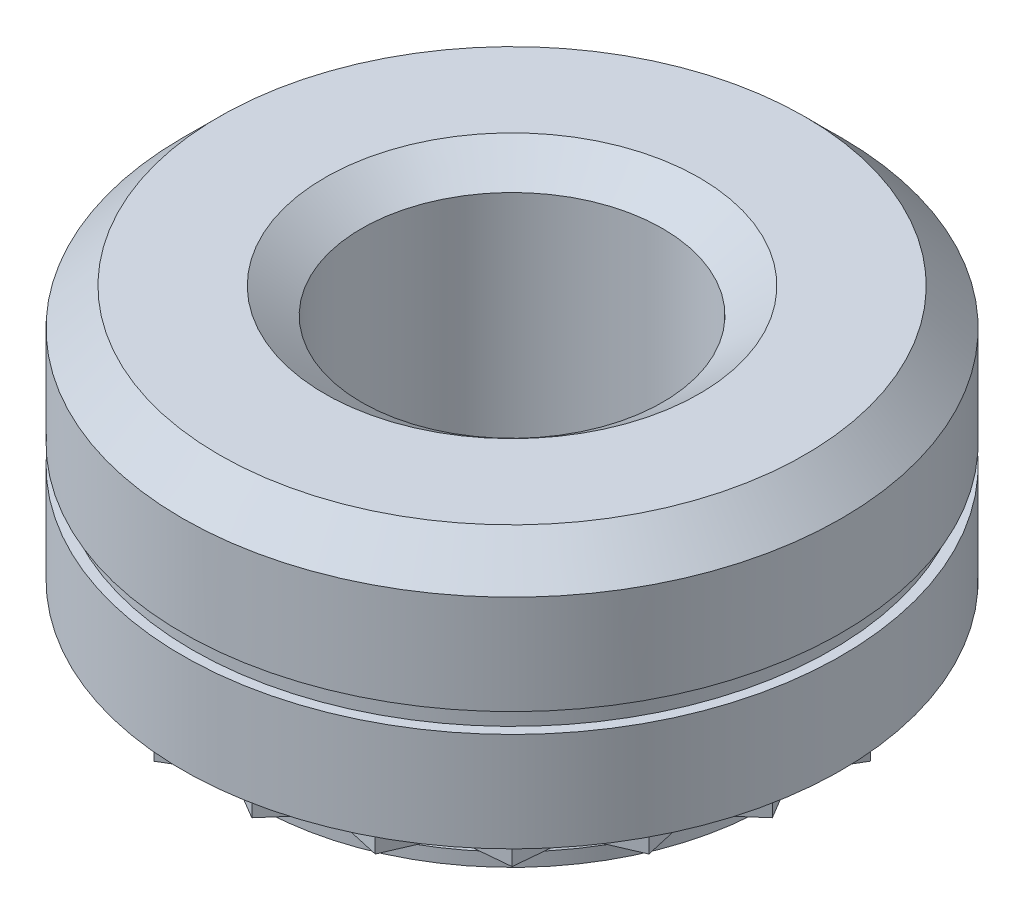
ISO-10303-21;
HEADER;
FILE_DESCRIPTION(('STEP AP214'),'2;1');
FILE_NAME('part.step','',(''),(''),'','','');
FILE_SCHEMA(('AUTOMOTIVE_DESIGN { 1 0 10303 214 1 1 1 1 }'));
ENDSEC;
DATA;
#1=APPLICATION_CONTEXT('core data for automotive mechanical design processes');
#2=APPLICATION_PROTOCOL_DEFINITION('international standard','automotive_design',2000,#1);
#3=PRODUCT_CONTEXT('',#1,'mechanical');
#4=PRODUCT('Part','Part','',(#3));
#5=PRODUCT_RELATED_PRODUCT_CATEGORY('part','',(#4));
#6=PRODUCT_DEFINITION_FORMATION('','',#4);
#7=PRODUCT_DEFINITION_CONTEXT('part definition',#1,'design');
#8=PRODUCT_DEFINITION('design','',#6,#7);
#9=PRODUCT_DEFINITION_SHAPE('','',#8);
#10=(LENGTH_UNIT() NAMED_UNIT(*) SI_UNIT(.MILLI.,.METRE.));
#11=(NAMED_UNIT(*) PLANE_ANGLE_UNIT() SI_UNIT($,.RADIAN.));
#12=(NAMED_UNIT(*) SI_UNIT($,.STERADIAN.) SOLID_ANGLE_UNIT());
#13=UNCERTAINTY_MEASURE_WITH_UNIT(LENGTH_MEASURE(1.E-05),#10,'distance_accuracy_value','');
#14=(GEOMETRIC_REPRESENTATION_CONTEXT(3) GLOBAL_UNCERTAINTY_ASSIGNED_CONTEXT((#13)) GLOBAL_UNIT_ASSIGNED_CONTEXT((#10,
#11,#12)) REPRESENTATION_CONTEXT('',''));
#15=CARTESIAN_POINT('',(0.,0.,0.));
#16=DIRECTION('',(0.,0.,1.));
#17=DIRECTION('',(1.,0.,0.));
#18=AXIS2_PLACEMENT_3D('',#15,#16,#17);
#19=CARTESIAN_POINT('',(4.0921354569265,0.,0.));
#20=DIRECTION('',(0.,-1.,0.));
#21=DIRECTION('',(0.,0.,-1.));
#22=AXIS2_PLACEMENT_3D('',#19,#20,#21);
#23=PLANE('',#22);
#24=CARTESIAN_POINT('',(0.,0.,0.));
#25=DIRECTION('',(0.,-1.,0.));
#26=DIRECTION('',(0.,0.,-1.));
#27=AXIS2_PLACEMENT_3D('',#24,#25,#26);
#28=CIRCLE('',#27,5.588);
#29=CARTESIAN_POINT('',(0.,0.,-5.588));
#30=VERTEX_POINT('',#29);
#31=EDGE_CURVE('E190',#30,#30,#28,.T.);
#32=ORIENTED_EDGE('',*,*,#31,.T.);
#33=EDGE_LOOP('',(#32));
#34=FACE_BOUND('',#33,.T.);
#35=DIRECTION('',(-0.859689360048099,0.,-0.5108171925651));
#36=VECTOR('',#35,1.);
#37=CARTESIAN_POINT('',(0.830448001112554,0.,5.24324232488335));
#38=LINE('',#37,#36);
#39=CARTESIAN_POINT('',(0.830448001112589,0.,5.24324232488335));
#40=VERTEX_POINT('',#39);
#41=CARTESIAN_POINT('',(0.,0.,4.7498));
#42=VERTEX_POINT('',#41);
#43=EDGE_CURVE('E70',#40,#42,#38,.T.);
#44=ORIENTED_EDGE('',*,*,#43,.F.);
#45=DIRECTION('',(-0.659761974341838,0.,0.751474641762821));
#46=VECTOR('',#45,1.);
#47=CARTESIAN_POINT('',(1.46776891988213,0.,4.51732824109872));
#48=LINE('',#47,#46);
#49=CARTESIAN_POINT('',(1.46776891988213,0.,4.51732824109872));
#50=VERTEX_POINT('',#49);
#51=EDGE_CURVE('E643',#50,#40,#48,.T.);
#52=ORIENTED_EDGE('',*,*,#51,.F.);
#53=DIRECTION('',(-0.975464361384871,0.,-0.220157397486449));
#54=VECTOR('',#53,1.);
#55=CARTESIAN_POINT('',(2.41005396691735,0.,4.72999723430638));
#56=LINE('',#55,#54);
#57=CARTESIAN_POINT('',(2.41005396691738,0.,4.72999723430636));
#58=VERTEX_POINT('',#57);
#59=EDGE_CURVE('E645',#58,#50,#56,.T.);
#60=ORIENTED_EDGE('',*,*,#59,.F.);
#61=DIRECTION('',(-0.395252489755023,0.,0.918572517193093));
#62=VECTOR('',#61,1.);
#63=CARTESIAN_POINT('',(2.79186239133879,0.,3.84266891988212));
#64=LINE('',#63,#62);
#65=CARTESIAN_POINT('',(2.79186239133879,0.,3.84266891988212));
#66=VERTEX_POINT('',#65);
#67=EDGE_CURVE('E670',#66,#58,#64,.T.);
#68=ORIENTED_EDGE('',*,*,#67,.F.);
#69=DIRECTION('',(-0.995754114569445,0.,0.0920529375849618));
#70=VECTOR('',#69,1.);
#71=CARTESIAN_POINT('',(3.7537470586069,0.,3.75374705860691));
#72=LINE('',#71,#70);
#73=CARTESIAN_POINT('',(3.75374705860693,0.,3.75374705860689));
#74=VERTEX_POINT('',#73);
#75=EDGE_CURVE('E673',#74,#66,#72,.T.);
#76=ORIENTED_EDGE('',*,*,#75,.F.);
#77=DIRECTION('',(-0.0920529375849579,0.,0.995754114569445));
#78=VECTOR('',#77,1.);
#79=CARTESIAN_POINT('',(3.84266891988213,0.,2.79186239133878));
#80=LINE('',#79,#78);
#81=CARTESIAN_POINT('',(3.84266891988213,0.,2.79186239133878));
#82=VERTEX_POINT('',#81);
#83=EDGE_CURVE('E704',#82,#74,#80,.T.);
#84=ORIENTED_EDGE('',*,*,#83,.F.);
#85=DIRECTION('',(-0.918572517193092,0.,0.395252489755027));
#86=VECTOR('',#85,1.);
#87=CARTESIAN_POINT('',(4.72999723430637,0.,2.41005396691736));
#88=LINE('',#87,#86);
#89=CARTESIAN_POINT('',(4.72999723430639,0.,2.41005396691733));
#90=VERTEX_POINT('',#89);
#91=EDGE_CURVE('E707',#90,#82,#88,.T.);
#92=ORIENTED_EDGE('',*,*,#91,.F.);
#93=DIRECTION('',(0.220157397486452,0.,0.97546436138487));
#94=VECTOR('',#93,1.);
#95=CARTESIAN_POINT('',(4.51732824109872,0.,1.46776891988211));
#96=LINE('',#95,#94);
#97=CARTESIAN_POINT('',(4.51732824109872,0.,1.46776891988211));
#98=VERTEX_POINT('',#97);
#99=EDGE_CURVE('E740',#98,#90,#96,.T.);
#100=ORIENTED_EDGE('',*,*,#99,.F.);
#101=DIRECTION('',(-0.751474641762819,0.,0.659761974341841));
#102=VECTOR('',#101,1.);
#103=CARTESIAN_POINT('',(5.24324232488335,0.,0.83044800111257));
#104=LINE('',#103,#102);
#105=CARTESIAN_POINT('',(5.24324232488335,0.,0.830448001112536));
#106=VERTEX_POINT('',#105);
#107=EDGE_CURVE('E743',#106,#98,#104,.T.);
#108=ORIENTED_EDGE('',*,*,#107,.F.);
#109=DIRECTION('',(0.510817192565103,0.,0.859689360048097));
#110=VECTOR('',#109,1.);
#111=CARTESIAN_POINT('',(4.7498,0.,0.));
#112=LINE('',#111,#110);
#113=CARTESIAN_POINT('',(4.7498,0.,0.));
#114=VERTEX_POINT('',#113);
#115=EDGE_CURVE('E776',#114,#106,#112,.T.);
#116=ORIENTED_EDGE('',*,*,#115,.F.);
#117=DIRECTION('',(-0.510817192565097,0.,0.8596893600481));
#118=VECTOR('',#117,1.);
#119=CARTESIAN_POINT('',(5.24324232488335,0.,-0.830448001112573));
#120=LINE('',#119,#118);
#121=CARTESIAN_POINT('',(5.24324232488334,0.,-0.830448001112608));
#122=VERTEX_POINT('',#121);
#123=EDGE_CURVE('E779',#122,#114,#120,.T.);
#124=ORIENTED_EDGE('',*,*,#123,.F.);
#125=DIRECTION('',(0.751474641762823,0.,0.659761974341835));
#126=VECTOR('',#125,1.);
#127=CARTESIAN_POINT('',(4.51732824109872,0.,-1.46776891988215));
#128=LINE('',#127,#126);
#129=CARTESIAN_POINT('',(4.51732824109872,0.,-1.46776891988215));
#130=VERTEX_POINT('',#129);
#131=EDGE_CURVE('E812',#130,#122,#128,.T.);
#132=ORIENTED_EDGE('',*,*,#131,.F.);
#133=DIRECTION('',(-0.220157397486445,0.,0.975464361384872));
#134=VECTOR('',#133,1.);
#135=CARTESIAN_POINT('',(4.72999723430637,0.,-2.41005396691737));
#136=LINE('',#135,#134);
#137=CARTESIAN_POINT('',(4.72999723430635,0.,-2.4100539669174));
#138=VERTEX_POINT('',#137);
#139=EDGE_CURVE('E815',#138,#130,#136,.T.);
#140=ORIENTED_EDGE('',*,*,#139,.F.);
#141=DIRECTION('',(0.918572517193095,0.,0.39525248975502));
#142=VECTOR('',#141,1.);
#143=CARTESIAN_POINT('',(3.84266891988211,0.,-2.79186239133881));
#144=LINE('',#143,#142);
#145=CARTESIAN_POINT('',(3.84266891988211,0.,-2.79186239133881));
#146=VERTEX_POINT('',#145);
#147=EDGE_CURVE('E848',#146,#138,#144,.T.);
#148=ORIENTED_EDGE('',*,*,#147,.F.);
#149=DIRECTION('',(0.0920529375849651,0.,0.995754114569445));
#150=VECTOR('',#149,1.);
#151=CARTESIAN_POINT('',(3.7537470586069,0.,-3.75374705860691));
#152=LINE('',#151,#150);
#153=CARTESIAN_POINT('',(3.75374705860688,0.,-3.75374705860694));
#154=VERTEX_POINT('',#153);
#155=EDGE_CURVE('E851',#154,#146,#152,.T.);
#156=ORIENTED_EDGE('',*,*,#155,.F.);
#157=DIRECTION('',(0.995754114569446,0.,0.0920529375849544));
#158=VECTOR('',#157,1.);
#159=CARTESIAN_POINT('',(2.79186239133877,0.,-3.84266891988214));
#160=LINE('',#159,#158);
#161=CARTESIAN_POINT('',(2.79186239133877,0.,-3.84266891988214));
#162=VERTEX_POINT('',#161);
#163=EDGE_CURVE('E884',#162,#154,#160,.T.);
#164=ORIENTED_EDGE('',*,*,#163,.F.);
#165=DIRECTION('',(0.39525248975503,0.,0.91857251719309));
#166=VECTOR('',#165,1.);
#167=CARTESIAN_POINT('',(2.41005396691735,0.,-4.72999723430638));
#168=LINE('',#167,#166);
#169=CARTESIAN_POINT('',(2.41005396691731,0.,-4.72999723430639));
#170=VERTEX_POINT('',#169);
#171=EDGE_CURVE('E887',#170,#162,#168,.T.);
#172=ORIENTED_EDGE('',*,*,#171,.F.);
#173=DIRECTION('',(0.975464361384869,0.,-0.220157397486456));
#174=VECTOR('',#173,1.);
#175=CARTESIAN_POINT('',(1.4677689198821,0.,-4.51732824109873));
#176=LINE('',#175,#174);
#177=CARTESIAN_POINT('',(1.4677689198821,0.,-4.51732824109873));
#178=VERTEX_POINT('',#177);
#179=EDGE_CURVE('E920',#178,#170,#176,.T.);
#180=ORIENTED_EDGE('',*,*,#179,.F.);
#181=DIRECTION('',(0.659761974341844,0.,0.751474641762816));
#182=VECTOR('',#181,1.);
#183=CARTESIAN_POINT('',(0.830448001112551,0.,-5.24324232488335));
#184=LINE('',#183,#182);
#185=CARTESIAN_POINT('',(0.830448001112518,0.,-5.24324232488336));
#186=VERTEX_POINT('',#185);
#187=EDGE_CURVE('E923',#186,#178,#184,.T.);
#188=ORIENTED_EDGE('',*,*,#187,.F.);
#189=DIRECTION('',(0.859689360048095,0.,-0.510817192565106));
#190=VECTOR('',#189,1.);
#191=CARTESIAN_POINT('',(0.,0.,-4.7498));
#192=LINE('',#191,#190);
#193=CARTESIAN_POINT('',(0.,0.,-4.7498));
#194=VERTEX_POINT('',#193);
#195=EDGE_CURVE('E956',#194,#186,#192,.T.);
#196=ORIENTED_EDGE('',*,*,#195,.F.);
#197=DIRECTION('',(0.859689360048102,0.,0.510817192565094));
#198=VECTOR('',#197,1.);
#199=CARTESIAN_POINT('',(-0.830448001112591,0.,-5.24324232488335));
#200=LINE('',#199,#198);
#201=CARTESIAN_POINT('',(-0.830448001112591,0.,-5.24324232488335));
#202=VERTEX_POINT('',#201);
#203=EDGE_CURVE('E959',#202,#194,#200,.T.);
#204=ORIENTED_EDGE('',*,*,#203,.F.);
#205=DIRECTION('',(0.659761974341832,0.,-0.751474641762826));
#206=VECTOR('',#205,1.);
#207=CARTESIAN_POINT('',(-1.46776891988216,0.,-4.51732824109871));
#208=LINE('',#207,#206);
#209=CARTESIAN_POINT('',(-1.46776891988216,0.,-4.51732824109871));
#210=VERTEX_POINT('',#209);
#211=EDGE_CURVE('E992',#210,#202,#208,.T.);
#212=ORIENTED_EDGE('',*,*,#211,.F.);
#213=DIRECTION('',(0.975464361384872,0.,0.220157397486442));
#214=VECTOR('',#213,1.);
#215=CARTESIAN_POINT('',(-2.41005396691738,0.,-4.72999723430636));
#216=LINE('',#215,#214);
#217=CARTESIAN_POINT('',(-2.41005396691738,0.,-4.72999723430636));
#218=VERTEX_POINT('',#217);
#219=EDGE_CURVE('E995',#218,#210,#216,.T.);
#220=ORIENTED_EDGE('',*,*,#219,.F.);
#221=DIRECTION('',(0.395252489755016,0.,-0.918572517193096));
#222=VECTOR('',#221,1.);
#223=CARTESIAN_POINT('',(-2.79186239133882,0.,-3.8426689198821));
#224=LINE('',#223,#222);
#225=CARTESIAN_POINT('',(-2.79186239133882,0.,-3.8426689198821));
#226=VERTEX_POINT('',#225);
#227=EDGE_CURVE('E1028',#226,#218,#224,.T.);
#228=ORIENTED_EDGE('',*,*,#227,.F.);
#229=DIRECTION('',(0.995754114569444,0.,-0.0920529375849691));
#230=VECTOR('',#229,1.);
#231=CARTESIAN_POINT('',(-3.75374705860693,0.,-3.75374705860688));
#232=LINE('',#231,#230);
#233=CARTESIAN_POINT('',(-3.75374705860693,0.,-3.75374705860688));
#234=VERTEX_POINT('',#233);
#235=EDGE_CURVE('E1031',#234,#226,#232,.T.);
#236=ORIENTED_EDGE('',*,*,#235,.F.);
#237=DIRECTION('',(0.0920529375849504,0.,-0.995754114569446));
#238=VECTOR('',#237,1.);
#239=CARTESIAN_POINT('',(-3.84266891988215,0.,-2.79186239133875));
#240=LINE('',#239,#238);
#241=CARTESIAN_POINT('',(-3.84266891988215,0.,-2.79186239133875));
#242=VERTEX_POINT('',#241);
#243=EDGE_CURVE('E1064',#242,#234,#240,.T.);
#244=ORIENTED_EDGE('',*,*,#243,.F.);
#245=DIRECTION('',(0.918572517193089,0.,-0.395252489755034));
#246=VECTOR('',#245,1.);
#247=CARTESIAN_POINT('',(-4.72999723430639,0.,-2.41005396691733));
#248=LINE('',#247,#246);
#249=CARTESIAN_POINT('',(-4.72999723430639,0.,-2.41005396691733));
#250=VERTEX_POINT('',#249);
#251=EDGE_CURVE('E1067',#250,#242,#248,.T.);
#252=ORIENTED_EDGE('',*,*,#251,.F.);
#253=DIRECTION('',(-0.220157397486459,0.,-0.975464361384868));
#254=VECTOR('',#253,1.);
#255=CARTESIAN_POINT('',(-4.51732824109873,0.,-1.46776891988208));
#256=LINE('',#255,#254);
#257=CARTESIAN_POINT('',(-4.51732824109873,0.,-1.46776891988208));
#258=VERTEX_POINT('',#257);
#259=EDGE_CURVE('E1100',#258,#250,#256,.T.);
#260=ORIENTED_EDGE('',*,*,#259,.F.);
#261=DIRECTION('',(0.751474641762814,0.,-0.659761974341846));
#262=VECTOR('',#261,1.);
#263=CARTESIAN_POINT('',(-5.24324232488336,0.,-0.830448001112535));
#264=LINE('',#263,#262);
#265=CARTESIAN_POINT('',(-5.24324232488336,0.,-0.830448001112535));
#266=VERTEX_POINT('',#265);
#267=EDGE_CURVE('E1103',#266,#258,#264,.T.);
#268=ORIENTED_EDGE('',*,*,#267,.F.);
#269=DIRECTION('',(-0.510817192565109,0.,-0.859689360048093));
#270=VECTOR('',#269,1.);
#271=CARTESIAN_POINT('',(-4.7498,0.,0.));
#272=LINE('',#271,#270);
#273=CARTESIAN_POINT('',(-4.7498,0.,0.));
#274=VERTEX_POINT('',#273);
#275=EDGE_CURVE('E1136',#274,#266,#272,.T.);
#276=ORIENTED_EDGE('',*,*,#275,.F.);
#277=DIRECTION('',(0.510817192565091,0.,-0.859689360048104));
#278=VECTOR('',#277,1.);
#279=CARTESIAN_POINT('',(-5.24324232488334,0.,0.830448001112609));
#280=LINE('',#279,#278);
#281=CARTESIAN_POINT('',(-5.24324232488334,0.,0.830448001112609));
#282=VERTEX_POINT('',#281);
#283=EDGE_CURVE('E1139',#282,#274,#280,.T.);
#284=ORIENTED_EDGE('',*,*,#283,.F.);
#285=DIRECTION('',(-0.751474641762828,0.,-0.65976197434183));
#286=VECTOR('',#285,1.);
#287=CARTESIAN_POINT('',(-4.5173282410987,0.,1.46776891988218));
#288=LINE('',#287,#286);
#289=CARTESIAN_POINT('',(-4.5173282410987,0.,1.46776891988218));
#290=VERTEX_POINT('',#289);
#291=EDGE_CURVE('E1172',#290,#282,#288,.T.);
#292=ORIENTED_EDGE('',*,*,#291,.F.);
#293=DIRECTION('',(0.220157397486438,0.,-0.975464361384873));
#294=VECTOR('',#293,1.);
#295=CARTESIAN_POINT('',(-4.72999723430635,0.,2.4100539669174));
#296=LINE('',#295,#294);
#297=CARTESIAN_POINT('',(-4.72999723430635,0.,2.4100539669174));
#298=VERTEX_POINT('',#297);
#299=EDGE_CURVE('E1175',#298,#290,#296,.T.);
#300=ORIENTED_EDGE('',*,*,#299,.F.);
#301=DIRECTION('',(-0.918572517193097,0.,-0.395252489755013));
#302=VECTOR('',#301,1.);
#303=CARTESIAN_POINT('',(-3.84266891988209,0.,2.79186239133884));
#304=LINE('',#303,#302);
#305=CARTESIAN_POINT('',(-3.84266891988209,0.,2.79186239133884));
#306=VERTEX_POINT('',#305);
#307=EDGE_CURVE('E1208',#306,#298,#304,.T.);
#308=ORIENTED_EDGE('',*,*,#307,.F.);
#309=DIRECTION('',(-0.0920529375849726,0.,-0.995754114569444));
#310=VECTOR('',#309,1.);
#311=CARTESIAN_POINT('',(-3.75374705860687,0.,3.75374705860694));
#312=LINE('',#311,#310);
#313=CARTESIAN_POINT('',(-3.75374705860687,0.,3.75374705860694));
#314=VERTEX_POINT('',#313);
#315=EDGE_CURVE('E1211',#314,#306,#312,.T.);
#316=ORIENTED_EDGE('',*,*,#315,.F.);
#317=DIRECTION('',(-0.995754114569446,0.,-0.0920529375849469));
#318=VECTOR('',#317,1.);
#319=CARTESIAN_POINT('',(-2.79186239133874,0.,3.84266891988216));
#320=LINE('',#319,#318);
#321=CARTESIAN_POINT('',(-2.79186239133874,0.,3.84266891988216));
#322=VERTEX_POINT('',#321);
#323=EDGE_CURVE('E1244',#322,#314,#320,.T.);
#324=ORIENTED_EDGE('',*,*,#323,.F.);
#325=DIRECTION('',(-0.395252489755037,0.,-0.918572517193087));
#326=VECTOR('',#325,1.);
#327=CARTESIAN_POINT('',(-2.41005396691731,0.,4.72999723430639));
#328=LINE('',#327,#326);
#329=CARTESIAN_POINT('',(-2.41005396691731,0.,4.72999723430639));
#330=VERTEX_POINT('',#329);
#331=EDGE_CURVE('E1247',#330,#322,#328,.T.);
#332=ORIENTED_EDGE('',*,*,#331,.F.);
#333=DIRECTION('',(-0.975464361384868,0.,0.220157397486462));
#334=VECTOR('',#333,1.);
#335=CARTESIAN_POINT('',(-1.46776891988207,0.,4.51732824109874));
#336=LINE('',#335,#334);
#337=CARTESIAN_POINT('',(-1.46776891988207,0.,4.51732824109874));
#338=VERTEX_POINT('',#337);
#339=EDGE_CURVE('E1267',#338,#330,#336,.T.);
#340=ORIENTED_EDGE('',*,*,#339,.F.);
#341=DIRECTION('',(-0.659761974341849,0.,-0.751474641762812));
#342=VECTOR('',#341,1.);
#343=CARTESIAN_POINT('',(-0.830448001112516,0.,5.24324232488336));
#344=LINE('',#343,#342);
#345=CARTESIAN_POINT('',(-0.830448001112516,0.,5.24324232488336));
#346=VERTEX_POINT('',#345);
#347=EDGE_CURVE('E1270',#346,#338,#344,.T.);
#348=ORIENTED_EDGE('',*,*,#347,.F.);
#349=DIRECTION('',(-0.859689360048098,0.,0.5108171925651));
#350=VECTOR('',#349,1.);
#351=CARTESIAN_POINT('',(0.,0.,4.7498));
#352=LINE('',#351,#350);
#353=EDGE_CURVE('E621',#42,#346,#352,.T.);
#354=ORIENTED_EDGE('',*,*,#353,.F.);
#355=EDGE_LOOP('',(#44,#52,#60,#68,#76,#84,#92,#100,#108,#116,#124,#132,#140,#148,#156,#164,
#172,#180,#188,#196,#204,#212,#220,#228,#236,#244,#252,#260,#268,#276,#284,#292,#300,#308,#316,
#324,#332,#340,#348,#354));
#356=FACE_BOUND('',#355,.T.);
#357=ADVANCED_FACE('F33',(#34,#356),#23,.T.);
#358=CARTESIAN_POINT('',(0.,0.,0.));
#359=DIRECTION('',(0.,-1.,0.));
#360=DIRECTION('',(0.,0.,-1.));
#361=AXIS2_PLACEMENT_3D('',#358,#359,#360);
#362=CIRCLE('',#361,4.0921354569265);
#363=CARTESIAN_POINT('',(0.,0.,-4.0921354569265));
#364=VERTEX_POINT('',#363);
#365=EDGE_CURVE('E187',#364,#364,#362,.T.);
#366=ORIENTED_EDGE('',*,*,#365,.F.);
#367=EDGE_LOOP('',(#366));
#368=FACE_BOUND('',#367,.T.);
#369=DIRECTION('',(0.975464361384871,0.,0.220157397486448));
#370=VECTOR('',#369,1.);
#371=CARTESIAN_POINT('',(1.40905816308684,0.,4.33663511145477));
#372=LINE('',#371,#370);
#373=CARTESIAN_POINT('',(1.40905816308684,0.,4.33663511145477));
#374=VERTEX_POINT('',#373);
#375=CARTESIAN_POINT('',(2.31365180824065,0.,4.54079734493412));
#376=VERTEX_POINT('',#375);
#377=EDGE_CURVE('E104',#374,#376,#372,.T.);
#378=ORIENTED_EDGE('',*,*,#377,.F.);
#379=DIRECTION('',(0.659761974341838,0.,-0.751474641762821));
#380=VECTOR('',#379,1.);
#381=CARTESIAN_POINT('',(0.797230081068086,0.,5.03351263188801));
#382=LINE('',#381,#380);
#383=CARTESIAN_POINT('',(0.797230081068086,0.,5.03351263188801));
#384=VERTEX_POINT('',#383);
#385=EDGE_CURVE('E641',#384,#374,#382,.T.);
#386=ORIENTED_EDGE('',*,*,#385,.F.);
#387=DIRECTION('',(0.859689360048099,0.,0.5108171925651));
#388=VECTOR('',#387,1.);
#389=CARTESIAN_POINT('',(0.,0.,4.559808));
#390=LINE('',#389,#388);
#391=CARTESIAN_POINT('',(0.,0.,4.559808));
#392=VERTEX_POINT('',#391);
#393=EDGE_CURVE('E138',#392,#384,#390,.T.);
#394=ORIENTED_EDGE('',*,*,#393,.F.);
#395=DIRECTION('',(0.859689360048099,0.,-0.5108171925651));
#396=VECTOR('',#395,1.);
#397=CARTESIAN_POINT('',(-0.797230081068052,0.,5.03351263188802));
#398=LINE('',#397,#396);
#399=CARTESIAN_POINT('',(-0.797230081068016,0.,5.03351263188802));
#400=VERTEX_POINT('',#399);
#401=EDGE_CURVE('E620',#400,#392,#398,.T.);
#402=ORIENTED_EDGE('',*,*,#401,.F.);
#403=DIRECTION('',(0.659761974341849,0.,0.751474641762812));
#404=VECTOR('',#403,1.);
#405=CARTESIAN_POINT('',(-1.40905816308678,0.,4.33663511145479));
#406=LINE('',#405,#404);
#407=CARTESIAN_POINT('',(-1.40905816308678,0.,4.33663511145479));
#408=VERTEX_POINT('',#407);
#409=EDGE_CURVE('E607',#408,#400,#406,.T.);
#410=ORIENTED_EDGE('',*,*,#409,.F.);
#411=DIRECTION('',(0.975464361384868,0.,-0.220157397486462));
#412=VECTOR('',#411,1.);
#413=CARTESIAN_POINT('',(-2.31365180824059,0.,4.54079734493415));
#414=LINE('',#413,#412);
#415=CARTESIAN_POINT('',(-2.31365180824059,0.,4.54079734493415));
#416=VERTEX_POINT('',#415);
#417=EDGE_CURVE('E618',#416,#408,#414,.T.);
#418=ORIENTED_EDGE('',*,*,#417,.F.);
#419=DIRECTION('',(0.395252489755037,0.,0.918572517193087));
#420=VECTOR('',#419,1.);
#421=CARTESIAN_POINT('',(-2.68018789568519,0.,3.68896216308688));
#422=LINE('',#421,#420);
#423=CARTESIAN_POINT('',(-2.68018789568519,0.,3.68896216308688));
#424=VERTEX_POINT('',#423);
#425=EDGE_CURVE('E1237',#424,#416,#422,.T.);
#426=ORIENTED_EDGE('',*,*,#425,.F.);
#427=DIRECTION('',(0.995754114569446,0.,0.0920529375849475));
#428=VECTOR('',#427,1.);
#429=CARTESIAN_POINT('',(-3.60359717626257,0.,3.60359717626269));
#430=LINE('',#429,#428);
#431=CARTESIAN_POINT('',(-3.60359717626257,0.,3.60359717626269));
#432=VERTEX_POINT('',#431);
#433=EDGE_CURVE('E1241',#432,#424,#430,.T.);
#434=ORIENTED_EDGE('',*,*,#433,.F.);
#435=DIRECTION('',(0.0920529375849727,0.,0.995754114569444));
#436=VECTOR('',#435,1.);
#437=CARTESIAN_POINT('',(-3.68896216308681,0.,2.68018789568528));
#438=LINE('',#437,#436);
#439=CARTESIAN_POINT('',(-3.68896216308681,0.,2.68018789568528));
#440=VERTEX_POINT('',#439);
#441=EDGE_CURVE('E1201',#440,#432,#438,.T.);
#442=ORIENTED_EDGE('',*,*,#441,.F.);
#443=DIRECTION('',(0.918572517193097,0.,0.395252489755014));
#444=VECTOR('',#443,1.);
#445=CARTESIAN_POINT('',(-4.54079734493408,0.,2.31365180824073));
#446=LINE('',#445,#444);
#447=CARTESIAN_POINT('',(-4.54079734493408,0.,2.31365180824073));
#448=VERTEX_POINT('',#447);
#449=EDGE_CURVE('E1205',#448,#440,#446,.T.);
#450=ORIENTED_EDGE('',*,*,#449,.F.);
#451=DIRECTION('',(-0.220157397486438,0.,0.975464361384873));
#452=VECTOR('',#451,1.);
#453=CARTESIAN_POINT('',(-4.33663511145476,0.,1.40905816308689));
#454=LINE('',#453,#452);
#455=CARTESIAN_POINT('',(-4.33663511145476,0.,1.40905816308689));
#456=VERTEX_POINT('',#455);
#457=EDGE_CURVE('E1165',#456,#448,#454,.T.);
#458=ORIENTED_EDGE('',*,*,#457,.F.);
#459=DIRECTION('',(0.751474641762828,0.,0.65976197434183));
#460=VECTOR('',#459,1.);
#461=CARTESIAN_POINT('',(-5.03351263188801,0.,0.797230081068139));
#462=LINE('',#461,#460);
#463=CARTESIAN_POINT('',(-5.03351263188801,0.,0.797230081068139));
#464=VERTEX_POINT('',#463);
#465=EDGE_CURVE('E1169',#464,#456,#462,.T.);
#466=ORIENTED_EDGE('',*,*,#465,.F.);
#467=DIRECTION('',(-0.510817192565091,0.,0.859689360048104));
#468=VECTOR('',#467,1.);
#469=CARTESIAN_POINT('',(-4.559808,0.,0.));
#470=LINE('',#469,#468);
#471=CARTESIAN_POINT('',(-4.559808,0.,0.));
#472=VERTEX_POINT('',#471);
#473=EDGE_CURVE('E1129',#472,#464,#470,.T.);
#474=ORIENTED_EDGE('',*,*,#473,.F.);
#475=DIRECTION('',(0.510817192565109,0.,0.859689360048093));
#476=VECTOR('',#475,1.);
#477=CARTESIAN_POINT('',(-5.03351263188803,0.,-0.797230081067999));
#478=LINE('',#477,#476);
#479=CARTESIAN_POINT('',(-5.03351263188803,0.,-0.797230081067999));
#480=VERTEX_POINT('',#479);
#481=EDGE_CURVE('E1133',#480,#472,#478,.T.);
#482=ORIENTED_EDGE('',*,*,#481,.F.);
#483=DIRECTION('',(-0.751474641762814,0.,0.659761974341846));
#484=VECTOR('',#483,1.);
#485=CARTESIAN_POINT('',(-4.33663511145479,0.,-1.4090581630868));
#486=LINE('',#485,#484);
#487=CARTESIAN_POINT('',(-4.33663511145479,0.,-1.4090581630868));
#488=VERTEX_POINT('',#487);
#489=EDGE_CURVE('E1093',#488,#480,#486,.T.);
#490=ORIENTED_EDGE('',*,*,#489,.F.);
#491=DIRECTION('',(0.220157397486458,0.,0.975464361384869));
#492=VECTOR('',#491,1.);
#493=CARTESIAN_POINT('',(-4.54079734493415,0.,-2.31365180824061));
#494=LINE('',#493,#492);
#495=CARTESIAN_POINT('',(-4.54079734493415,0.,-2.31365180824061));
#496=VERTEX_POINT('',#495);
#497=EDGE_CURVE('E1097',#496,#488,#494,.T.);
#498=ORIENTED_EDGE('',*,*,#497,.F.);
#499=DIRECTION('',(-0.918572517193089,0.,0.395252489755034));
#500=VECTOR('',#499,1.);
#501=CARTESIAN_POINT('',(-3.68896216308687,0.,-2.6801878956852));
#502=LINE('',#501,#500);
#503=CARTESIAN_POINT('',(-3.68896216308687,0.,-2.6801878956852));
#504=VERTEX_POINT('',#503);
#505=EDGE_CURVE('E1057',#504,#496,#502,.T.);
#506=ORIENTED_EDGE('',*,*,#505,.F.);
#507=DIRECTION('',(-0.0920529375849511,0.,0.995754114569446));
#508=VECTOR('',#507,1.);
#509=CARTESIAN_POINT('',(-3.60359717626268,0.,-3.60359717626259));
#510=LINE('',#509,#508);
#511=CARTESIAN_POINT('',(-3.60359717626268,0.,-3.60359717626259));
#512=VERTEX_POINT('',#511);
#513=EDGE_CURVE('E1061',#512,#504,#510,.T.);
#514=ORIENTED_EDGE('',*,*,#513,.F.);
#515=DIRECTION('',(-0.995754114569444,0.,0.0920529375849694));
#516=VECTOR('',#515,1.);
#517=CARTESIAN_POINT('',(-2.68018789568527,0.,-3.68896216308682));
#518=LINE('',#517,#516);
#519=CARTESIAN_POINT('',(-2.68018789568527,0.,-3.68896216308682));
#520=VERTEX_POINT('',#519);
#521=EDGE_CURVE('E1021',#520,#512,#518,.T.);
#522=ORIENTED_EDGE('',*,*,#521,.F.);
#523=DIRECTION('',(-0.395252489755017,0.,0.918572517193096));
#524=VECTOR('',#523,1.);
#525=CARTESIAN_POINT('',(-2.31365180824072,0.,-4.54079734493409));
#526=LINE('',#525,#524);
#527=CARTESIAN_POINT('',(-2.31365180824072,0.,-4.54079734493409));
#528=VERTEX_POINT('',#527);
#529=EDGE_CURVE('E1025',#528,#520,#526,.T.);
#530=ORIENTED_EDGE('',*,*,#529,.F.);
#531=DIRECTION('',(-0.975464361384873,0.,-0.220157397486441));
#532=VECTOR('',#531,1.);
#533=CARTESIAN_POINT('',(-1.40905816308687,0.,-4.33663511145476));
#534=LINE('',#533,#532);
#535=CARTESIAN_POINT('',(-1.40905816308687,0.,-4.33663511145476));
#536=VERTEX_POINT('',#535);
#537=EDGE_CURVE('E985',#536,#528,#534,.T.);
#538=ORIENTED_EDGE('',*,*,#537,.F.);
#539=DIRECTION('',(-0.659761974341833,0.,0.751474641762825));
#540=VECTOR('',#539,1.);
#541=CARTESIAN_POINT('',(-0.797230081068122,0.,-5.03351263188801));
#542=LINE('',#541,#540);
#543=CARTESIAN_POINT('',(-0.797230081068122,0.,-5.03351263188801));
#544=VERTEX_POINT('',#543);
#545=EDGE_CURVE('E989',#544,#536,#542,.T.);
#546=ORIENTED_EDGE('',*,*,#545,.F.);
#547=DIRECTION('',(-0.859689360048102,0.,-0.510817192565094));
#548=VECTOR('',#547,1.);
#549=CARTESIAN_POINT('',(0.,0.,-4.559808));
#550=LINE('',#549,#548);
#551=CARTESIAN_POINT('',(0.,0.,-4.559808));
#552=VERTEX_POINT('',#551);
#553=EDGE_CURVE('E949',#552,#544,#550,.T.);
#554=ORIENTED_EDGE('',*,*,#553,.F.);
#555=DIRECTION('',(-0.859689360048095,0.,0.510817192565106));
#556=VECTOR('',#555,1.);
#557=CARTESIAN_POINT('',(0.797230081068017,0.,-5.03351263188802));
#558=LINE('',#557,#556);
#559=CARTESIAN_POINT('',(0.797230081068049,0.,-5.03351263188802));
#560=VERTEX_POINT('',#559);
#561=EDGE_CURVE('E953',#560,#552,#558,.T.);
#562=ORIENTED_EDGE('',*,*,#561,.F.);
#563=DIRECTION('',(-0.659761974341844,0.,-0.751474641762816));
#564=VECTOR('',#563,1.);
#565=CARTESIAN_POINT('',(1.40905816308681,0.,-4.33663511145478));
#566=LINE('',#565,#564);
#567=CARTESIAN_POINT('',(1.40905816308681,0.,-4.33663511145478));
#568=VERTEX_POINT('',#567);
#569=EDGE_CURVE('E913',#568,#560,#566,.T.);
#570=ORIENTED_EDGE('',*,*,#569,.F.);
#571=DIRECTION('',(-0.975464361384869,0.,0.220157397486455));
#572=VECTOR('',#571,1.);
#573=CARTESIAN_POINT('',(2.31365180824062,0.,-4.54079734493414));
#574=LINE('',#573,#572);
#575=CARTESIAN_POINT('',(2.31365180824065,0.,-4.54079734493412));
#576=VERTEX_POINT('',#575);
#577=EDGE_CURVE('E917',#576,#568,#574,.T.);
#578=ORIENTED_EDGE('',*,*,#577,.F.);
#579=DIRECTION('',(-0.39525248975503,0.,-0.91857251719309));
#580=VECTOR('',#579,1.);
#581=CARTESIAN_POINT('',(2.68018789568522,0.,-3.68896216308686));
#582=LINE('',#581,#580);
#583=CARTESIAN_POINT('',(2.68018789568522,0.,-3.68896216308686));
#584=VERTEX_POINT('',#583);
#585=EDGE_CURVE('E877',#584,#576,#582,.T.);
#586=ORIENTED_EDGE('',*,*,#585,.F.);
#587=DIRECTION('',(-0.995754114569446,0.,-0.092052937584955));
#588=VECTOR('',#587,1.);
#589=CARTESIAN_POINT('',(3.6035971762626,0.,-3.60359717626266));
#590=LINE('',#589,#588);
#591=CARTESIAN_POINT('',(3.60359717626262,0.,-3.60359717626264));
#592=VERTEX_POINT('',#591);
#593=EDGE_CURVE('E881',#592,#584,#590,.T.);
#594=ORIENTED_EDGE('',*,*,#593,.F.);
#595=DIRECTION('',(-0.0920529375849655,0.,-0.995754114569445));
#596=VECTOR('',#595,1.);
#597=CARTESIAN_POINT('',(3.68896216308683,0.,-2.68018789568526));
#598=LINE('',#597,#596);
#599=CARTESIAN_POINT('',(3.68896216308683,0.,-2.68018789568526));
#600=VERTEX_POINT('',#599);
#601=EDGE_CURVE('E841',#600,#592,#598,.T.);
#602=ORIENTED_EDGE('',*,*,#601,.F.);
#603=DIRECTION('',(-0.918572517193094,0.,-0.39525248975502));
#604=VECTOR('',#603,1.);
#605=CARTESIAN_POINT('',(4.5407973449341,0.,-2.3136518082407));
#606=LINE('',#605,#604);
#607=CARTESIAN_POINT('',(4.54079734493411,0.,-2.31365180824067));
#608=VERTEX_POINT('',#607);
#609=EDGE_CURVE('E845',#608,#600,#606,.T.);
#610=ORIENTED_EDGE('',*,*,#609,.F.);
#611=DIRECTION('',(0.220157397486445,0.,-0.975464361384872));
#612=VECTOR('',#611,1.);
#613=CARTESIAN_POINT('',(4.33663511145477,0.,-1.40905816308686));
#614=LINE('',#613,#612);
#615=CARTESIAN_POINT('',(4.33663511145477,0.,-1.40905816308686));
#616=VERTEX_POINT('',#615);
#617=EDGE_CURVE('E805',#616,#608,#614,.T.);
#618=ORIENTED_EDGE('',*,*,#617,.F.);
#619=DIRECTION('',(-0.751474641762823,0.,-0.659761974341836));
#620=VECTOR('',#619,1.);
#621=CARTESIAN_POINT('',(5.03351263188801,0.,-0.797230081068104));
#622=LINE('',#621,#620);
#623=CARTESIAN_POINT('',(5.03351263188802,0.,-0.79723008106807));
#624=VERTEX_POINT('',#623);
#625=EDGE_CURVE('E809',#624,#616,#622,.T.);
#626=ORIENTED_EDGE('',*,*,#625,.F.);
#627=DIRECTION('',(0.510817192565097,0.,-0.859689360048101));
#628=VECTOR('',#627,1.);
#629=CARTESIAN_POINT('',(4.559808,0.,0.));
#630=LINE('',#629,#628);
#631=CARTESIAN_POINT('',(4.559808,0.,0.));
#632=VERTEX_POINT('',#631);
#633=EDGE_CURVE('E769',#632,#624,#630,.T.);
#634=ORIENTED_EDGE('',*,*,#633,.F.);
#635=DIRECTION('',(-0.510817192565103,0.,-0.859689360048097));
#636=VECTOR('',#635,1.);
#637=CARTESIAN_POINT('',(5.03351263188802,0.,0.797230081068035));
#638=LINE('',#637,#636);
#639=CARTESIAN_POINT('',(5.03351263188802,0.,0.797230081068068));
#640=VERTEX_POINT('',#639);
#641=EDGE_CURVE('E773',#640,#632,#638,.T.);
#642=ORIENTED_EDGE('',*,*,#641,.F.);
#643=DIRECTION('',(0.751474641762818,0.,-0.659761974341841));
#644=VECTOR('',#643,1.);
#645=CARTESIAN_POINT('',(4.33663511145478,0.,1.40905816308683));
#646=LINE('',#645,#644);
#647=CARTESIAN_POINT('',(4.33663511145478,0.,1.40905816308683));
#648=VERTEX_POINT('',#647);
#649=EDGE_CURVE('E733',#648,#640,#646,.T.);
#650=ORIENTED_EDGE('',*,*,#649,.F.);
#651=DIRECTION('',(-0.220157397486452,0.,-0.97546436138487));
#652=VECTOR('',#651,1.);
#653=CARTESIAN_POINT('',(4.54079734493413,0.,2.31365180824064));
#654=LINE('',#653,#652);
#655=CARTESIAN_POINT('',(4.54079734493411,0.,2.31365180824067));
#656=VERTEX_POINT('',#655);
#657=EDGE_CURVE('E737',#656,#648,#654,.T.);
#658=ORIENTED_EDGE('',*,*,#657,.F.);
#659=DIRECTION('',(0.918572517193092,0.,-0.395252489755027));
#660=VECTOR('',#659,1.);
#661=CARTESIAN_POINT('',(3.68896216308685,0.,2.68018789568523));
#662=LINE('',#661,#660);
#663=CARTESIAN_POINT('',(3.68896216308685,0.,2.68018789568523));
#664=VERTEX_POINT('',#663);
#665=EDGE_CURVE('E697',#664,#656,#662,.T.);
#666=ORIENTED_EDGE('',*,*,#665,.F.);
#667=DIRECTION('',(0.0920529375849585,0.,-0.995754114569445));
#668=VECTOR('',#667,1.);
#669=CARTESIAN_POINT('',(3.60359717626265,0.,3.60359717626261));
#670=LINE('',#669,#668);
#671=CARTESIAN_POINT('',(3.60359717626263,0.,3.60359717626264));
#672=VERTEX_POINT('',#671);
#673=EDGE_CURVE('E701',#672,#664,#670,.T.);
#674=ORIENTED_EDGE('',*,*,#673,.F.);
#675=DIRECTION('',(0.995754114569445,0.,-0.092052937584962));
#676=VECTOR('',#675,1.);
#677=CARTESIAN_POINT('',(2.68018789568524,0.,3.68896216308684));
#678=LINE('',#677,#676);
#679=CARTESIAN_POINT('',(2.68018789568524,0.,3.68896216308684));
#680=VERTEX_POINT('',#679);
#681=EDGE_CURVE('E663',#680,#672,#678,.T.);
#682=ORIENTED_EDGE('',*,*,#681,.F.);
#683=DIRECTION('',(0.395252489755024,0.,-0.918572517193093));
#684=VECTOR('',#683,1.);
#685=CARTESIAN_POINT('',(2.31365180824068,0.,4.54079734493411));
#686=LINE('',#685,#684);
#687=EDGE_CURVE('E667',#376,#680,#686,.T.);
#688=ORIENTED_EDGE('',*,*,#687,.F.);
#689=EDGE_LOOP('',(#378,#386,#394,#402,#410,#418,#426,#434,#442,#450,#458,#466,#474,#482,#490,
#498,#506,#514,#522,#530,#538,#546,#554,#562,#570,#578,#586,#594,#602,#610,#618,#626,#634,#642,
#650,#658,#666,#674,#682,#688));
#690=FACE_BOUND('',#689,.T.);
#691=ADVANCED_FACE('F215',(#368,#690),#23,.T.);
#692=CARTESIAN_POINT('',(0.,0.,0.));
#693=DIRECTION('',(0.,-1.,0.));
#694=DIRECTION('',(0.,0.,-1.));
#695=AXIS2_PLACEMENT_3D('',#692,#693,#694);
#696=CYLINDRICAL_SURFACE('',#695,5.588);
#697=CARTESIAN_POINT('',(0.,1.68021,0.));
#698=DIRECTION('',(0.,-1.,0.));
#699=DIRECTION('',(0.,0.,-1.));
#700=AXIS2_PLACEMENT_3D('',#697,#698,#699);
#701=CIRCLE('',#700,5.588);
#702=CARTESIAN_POINT('',(0.,1.68021,-5.588));
#703=VERTEX_POINT('',#702);
#704=EDGE_CURVE('E166',#703,#703,#701,.T.);
#705=ORIENTED_EDGE('',*,*,#704,.T.);
#706=EDGE_LOOP('',(#705));
#707=FACE_BOUND('',#706,.T.);
#708=ORIENTED_EDGE('',*,*,#31,.F.);
#709=EDGE_LOOP('',(#708));
#710=FACE_BOUND('',#709,.T.);
#711=ADVANCED_FACE('F221',(#707,#710),#696,.T.);
#712=CARTESIAN_POINT('',(0.,0.,0.));
#713=DIRECTION('',(0.,-1.,0.));
#714=DIRECTION('',(0.,0.,-1.));
#715=AXIS2_PLACEMENT_3D('',#712,#713,#714);
#716=CYLINDRICAL_SURFACE('',#715,4.0921354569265);
#717=ORIENTED_EDGE('',*,*,#365,.T.);
#718=EDGE_LOOP('',(#717));
#719=FACE_BOUND('',#718,.T.);
#720=CARTESIAN_POINT('',(0.,-0.4572,0.));
#721=DIRECTION('',(0.,-1.,0.));
#722=DIRECTION('',(0.,0.,-1.));
#723=AXIS2_PLACEMENT_3D('',#720,#721,#722);
#724=CIRCLE('',#723,4.0921354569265);
#725=CARTESIAN_POINT('',(0.,-0.4572,-4.0921354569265));
#726=VERTEX_POINT('',#725);
#727=EDGE_CURVE('E184',#726,#726,#724,.T.);
#728=ORIENTED_EDGE('',*,*,#727,.F.);
#729=EDGE_LOOP('',(#728));
#730=FACE_BOUND('',#729,.T.);
#731=ADVANCED_FACE('F225',(#719,#730),#716,.T.);
#732=CARTESIAN_POINT('',(0.,-0.9144,0.));
#733=DIRECTION('',(0.,-1.,0.));
#734=DIRECTION('',(0.,0.,-1.));
#735=AXIS2_PLACEMENT_3D('',#732,#733,#734);
#736=CONICAL_SURFACE('',#735,4.3561,0.523598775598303);
#737=ORIENTED_EDGE('',*,*,#727,.T.);
#738=EDGE_LOOP('',(#737));
#739=FACE_BOUND('',#738,.T.);
#740=CARTESIAN_POINT('',(0.,-0.9144,0.));
#741=DIRECTION('',(0.,-1.,0.));
#742=DIRECTION('',(0.,0.,-1.));
#743=AXIS2_PLACEMENT_3D('',#740,#741,#742);
#744=CIRCLE('',#743,4.3561);
#745=CARTESIAN_POINT('',(0.,-0.9144,-4.3561));
#746=VERTEX_POINT('',#745);
#747=EDGE_CURVE('E181',#746,#746,#744,.T.);
#748=ORIENTED_EDGE('',*,*,#747,.F.);
#749=EDGE_LOOP('',(#748));
#750=FACE_BOUND('',#749,.T.);
#751=ADVANCED_FACE('F232',(#739,#750),#736,.T.);
#752=CARTESIAN_POINT('',(0.,0.,0.));
#753=DIRECTION('',(0.,-1.,0.));
#754=DIRECTION('',(0.,0.,-1.));
#755=AXIS2_PLACEMENT_3D('',#752,#753,#754);
#756=CYLINDRICAL_SURFACE('',#755,4.3561);
#757=ORIENTED_EDGE('',*,*,#747,.T.);
#758=EDGE_LOOP('',(#757));
#759=FACE_BOUND('',#758,.T.);
#760=CARTESIAN_POINT('',(0.,-1.143,0.));
#761=DIRECTION('',(0.,-1.,0.));
#762=DIRECTION('',(0.,0.,-1.));
#763=AXIS2_PLACEMENT_3D('',#760,#761,#762);
#764=CIRCLE('',#763,4.3561);
#765=CARTESIAN_POINT('',(0.,-1.143,-4.3561));
#766=VERTEX_POINT('',#765);
#767=EDGE_CURVE('E178',#766,#766,#764,.T.);
#768=ORIENTED_EDGE('',*,*,#767,.F.);
#769=EDGE_LOOP('',(#768));
#770=FACE_BOUND('',#769,.T.);
#771=ADVANCED_FACE('F241',(#759,#770),#756,.T.);
#772=CARTESIAN_POINT('',(2.5527,-1.143,0.));
#773=DIRECTION('',(0.,-1.,0.));
#774=DIRECTION('',(0.,0.,-1.));
#775=AXIS2_PLACEMENT_3D('',#772,#773,#774);
#776=PLANE('',#775);
#777=CARTESIAN_POINT('',(0.,-1.143,0.));
#778=DIRECTION('',(0.,-1.,0.));
#779=DIRECTION('',(0.,0.,-1.));
#780=AXIS2_PLACEMENT_3D('',#777,#778,#779);
#781=CIRCLE('',#780,3.175);
#782=CARTESIAN_POINT('',(0.,-1.143,-3.175));
#783=VERTEX_POINT('',#782);
#784=EDGE_CURVE('E37',#783,#783,#781,.T.);
#785=ORIENTED_EDGE('',*,*,#784,.F.);
#786=EDGE_LOOP('',(#785));
#787=FACE_BOUND('',#786,.T.);
#788=ORIENTED_EDGE('',*,*,#767,.T.);
#789=EDGE_LOOP('',(#788));
#790=FACE_BOUND('',#789,.T.);
#791=ADVANCED_FACE('F251',(#787,#790),#776,.T.);
#792=CARTESIAN_POINT('',(0.,0.,0.));
#793=DIRECTION('',(0.,-1.,0.));
#794=DIRECTION('',(0.,0.,-1.));
#795=AXIS2_PLACEMENT_3D('',#792,#793,#794);
#796=CYLINDRICAL_SURFACE('',#795,2.5527);
#797=CARTESIAN_POINT('',(0.,3.88242269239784,0.));
#798=DIRECTION('',(0.,-1.,0.));
#799=DIRECTION('',(0.,0.,-1.));
#800=AXIS2_PLACEMENT_3D('',#797,#798,#799);
#801=CIRCLE('',#800,2.5527);
#802=CARTESIAN_POINT('',(0.,3.88242269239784,-2.5527));
#803=VERTEX_POINT('',#802);
#804=EDGE_CURVE('E154',#803,#803,#801,.T.);
#805=ORIENTED_EDGE('',*,*,#804,.F.);
#806=EDGE_LOOP('',(#805));
#807=FACE_BOUND('',#806,.T.);
#808=CARTESIAN_POINT('',(0.,-0.704882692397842,0.));
#809=DIRECTION('',(0.,-1.,0.));
#810=DIRECTION('',(0.,0.,-1.));
#811=AXIS2_PLACEMENT_3D('',#808,#809,#810);
#812=CIRCLE('',#811,2.5527);
#813=CARTESIAN_POINT('',(0.,-0.704882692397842,-2.5527));
#814=VERTEX_POINT('',#813);
#815=EDGE_CURVE('E163',#814,#814,#812,.T.);
#816=ORIENTED_EDGE('',*,*,#815,.T.);
#817=EDGE_LOOP('',(#816));
#818=FACE_BOUND('',#817,.T.);
#819=ADVANCED_FACE('F256',(#807,#818),#796,.F.);
#820=CARTESIAN_POINT('',(5.588,4.318,0.));
#821=DIRECTION('',(0.,1.,0.));
#822=DIRECTION('',(0.,0.,1.));
#823=AXIS2_PLACEMENT_3D('',#820,#821,#822);
#824=PLANE('',#823);
#825=CARTESIAN_POINT('',(0.,4.318,0.));
#826=DIRECTION('',(0.,-1.,0.));
#827=DIRECTION('',(0.,0.,-1.));
#828=AXIS2_PLACEMENT_3D('',#825,#826,#827);
#829=CIRCLE('',#828,3.175);
#830=CARTESIAN_POINT('',(0.,4.318,-3.175));
#831=VERTEX_POINT('',#830);
#832=EDGE_CURVE('E157',#831,#831,#829,.T.);
#833=ORIENTED_EDGE('',*,*,#832,.T.);
#834=EDGE_LOOP('',(#833));
#835=FACE_BOUND('',#834,.T.);
#836=CARTESIAN_POINT('',(0.,4.318,0.));
#837=DIRECTION('',(0.,1.,0.));
#838=DIRECTION('',(0.,0.,1.));
#839=AXIS2_PLACEMENT_3D('',#836,#837,#838);
#840=CIRCLE('',#839,4.9657);
#841=CARTESIAN_POINT('',(0.,4.318,4.9657));
#842=VERTEX_POINT('',#841);
#843=EDGE_CURVE('E11',#842,#842,#840,.T.);
#844=ORIENTED_EDGE('',*,*,#843,.T.);
#845=EDGE_LOOP('',(#844));
#846=FACE_BOUND('',#845,.T.);
#847=ADVANCED_FACE('F262',(#835,#846),#824,.T.);
#848=CARTESIAN_POINT('',(0.,0.,0.));
#849=DIRECTION('',(0.,-1.,0.));
#850=DIRECTION('',(0.,0.,-1.));
#851=AXIS2_PLACEMENT_3D('',#848,#849,#850);
#852=CYLINDRICAL_SURFACE('',#851,5.588);
#853=CARTESIAN_POINT('',(0.,3.6957,0.));
#854=DIRECTION('',(0.,1.,0.));
#855=DIRECTION('',(0.,0.,1.));
#856=AXIS2_PLACEMENT_3D('',#853,#854,#855);
#857=CIRCLE('',#856,5.588);
#858=CARTESIAN_POINT('',(0.,3.6957,5.588));
#859=VERTEX_POINT('',#858);
#860=EDGE_CURVE('E42',#859,#859,#857,.F.);
#861=ORIENTED_EDGE('',*,*,#860,.T.);
#862=EDGE_LOOP('',(#861));
#863=FACE_BOUND('',#862,.T.);
#864=CARTESIAN_POINT('',(0.,2.01549,0.));
#865=DIRECTION('',(0.,-1.,0.));
#866=DIRECTION('',(0.,0.,-1.));
#867=AXIS2_PLACEMENT_3D('',#864,#865,#866);
#868=CIRCLE('',#867,5.588);
#869=CARTESIAN_POINT('',(0.,2.01549,-5.588));
#870=VERTEX_POINT('',#869);
#871=EDGE_CURVE('E175',#870,#870,#868,.T.);
#872=ORIENTED_EDGE('',*,*,#871,.F.);
#873=EDGE_LOOP('',(#872));
#874=FACE_BOUND('',#873,.T.);
#875=ADVANCED_FACE('F196',(#863,#874),#852,.T.);
#876=CARTESIAN_POINT('',(5.588,2.01549,0.));
#877=DIRECTION('',(0.,-1.,0.));
#878=DIRECTION('',(0.,0.,-1.));
#879=AXIS2_PLACEMENT_3D('',#876,#877,#878);
#880=PLANE('',#879);
#881=ORIENTED_EDGE('',*,*,#871,.T.);
#882=EDGE_LOOP('',(#881));
#883=FACE_BOUND('',#882,.T.);
#884=CARTESIAN_POINT('',(0.,2.01549,0.));
#885=DIRECTION('',(0.,-1.,0.));
#886=DIRECTION('',(0.,0.,-1.));
#887=AXIS2_PLACEMENT_3D('',#884,#885,#886);
#888=CIRCLE('',#887,5.42036);
#889=CARTESIAN_POINT('',(0.,2.01549,-5.42036));
#890=VERTEX_POINT('',#889);
#891=EDGE_CURVE('E172',#890,#890,#888,.T.);
#892=ORIENTED_EDGE('',*,*,#891,.F.);
#893=EDGE_LOOP('',(#892));
#894=FACE_BOUND('',#893,.T.);
#895=ADVANCED_FACE('F272',(#883,#894),#880,.T.);
#896=CARTESIAN_POINT('',(0.,0.,0.));
#897=DIRECTION('',(0.,-1.,0.));
#898=DIRECTION('',(0.,0.,-1.));
#899=AXIS2_PLACEMENT_3D('',#896,#897,#898);
#900=CYLINDRICAL_SURFACE('',#899,5.42036);
#901=ORIENTED_EDGE('',*,*,#891,.T.);
#902=EDGE_LOOP('',(#901));
#903=FACE_BOUND('',#902,.T.);
#904=CARTESIAN_POINT('',(0.,1.68021,0.));
#905=DIRECTION('',(0.,-1.,0.));
#906=DIRECTION('',(0.,0.,-1.));
#907=AXIS2_PLACEMENT_3D('',#904,#905,#906);
#908=CIRCLE('',#907,5.42036);
#909=CARTESIAN_POINT('',(0.,1.68021,-5.42036));
#910=VERTEX_POINT('',#909);
#911=EDGE_CURVE('E169',#910,#910,#908,.T.);
#912=ORIENTED_EDGE('',*,*,#911,.F.);
#913=EDGE_LOOP('',(#912));
#914=FACE_BOUND('',#913,.T.);
#915=ADVANCED_FACE('F210',(#903,#914),#900,.T.);
#916=CARTESIAN_POINT('',(5.42036,1.68021,0.));
#917=DIRECTION('',(0.,1.,0.));
#918=DIRECTION('',(0.,0.,1.));
#919=AXIS2_PLACEMENT_3D('',#916,#917,#918);
#920=PLANE('',#919);
#921=ORIENTED_EDGE('',*,*,#911,.T.);
#922=EDGE_LOOP('',(#921));
#923=FACE_BOUND('',#922,.T.);
#924=ORIENTED_EDGE('',*,*,#704,.F.);
#925=EDGE_LOOP('',(#924));
#926=FACE_BOUND('',#925,.T.);
#927=ADVANCED_FACE('F201',(#923,#926),#920,.T.);
#928=CARTESIAN_POINT('',(0.,3.6957,0.));
#929=DIRECTION('',(0.,-1.,0.));
#930=DIRECTION('',(0.,0.,-1.));
#931=AXIS2_PLACEMENT_3D('',#928,#929,#930);
#932=CONICAL_SURFACE('',#931,5.588,0.78539816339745);
#933=ORIENTED_EDGE('',*,*,#843,.F.);
#934=EDGE_LOOP('',(#933));
#935=FACE_BOUND('',#934,.T.);
#936=ORIENTED_EDGE('',*,*,#860,.F.);
#937=EDGE_LOOP('',(#936));
#938=FACE_BOUND('',#937,.T.);
#939=ADVANCED_FACE('F35',(#935,#938),#932,.T.);
#940=CARTESIAN_POINT('',(0.,-1.14046,0.));
#941=DIRECTION('',(0.,-1.,0.));
#942=DIRECTION('',(0.,0.,-1.));
#943=AXIS2_PLACEMENT_3D('',#940,#941,#942);
#944=CONICAL_SURFACE('',#943,3.175,0.960105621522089);
#945=ORIENTED_EDGE('',*,*,#815,.F.);
#946=EDGE_LOOP('',(#945));
#947=FACE_BOUND('',#946,.T.);
#948=CARTESIAN_POINT('',(0.,-1.14046,0.));
#949=DIRECTION('',(0.,-1.,0.));
#950=DIRECTION('',(0.,0.,-1.));
#951=AXIS2_PLACEMENT_3D('',#948,#949,#950);
#952=CIRCLE('',#951,3.175);
#953=CARTESIAN_POINT('',(0.,-1.14046,-3.175));
#954=VERTEX_POINT('',#953);
#955=EDGE_CURVE('E160',#954,#954,#952,.T.);
#956=ORIENTED_EDGE('',*,*,#955,.T.);
#957=EDGE_LOOP('',(#956));
#958=FACE_BOUND('',#957,.T.);
#959=ADVANCED_FACE('F200',(#947,#958),#944,.F.);
#960=CARTESIAN_POINT('',(0.,-2.54,0.));
#961=DIRECTION('',(0.,-1.,0.));
#962=DIRECTION('',(0.,0.,-1.));
#963=AXIS2_PLACEMENT_3D('',#960,#961,#962);
#964=CYLINDRICAL_SURFACE('',#963,3.175);
#965=ORIENTED_EDGE('',*,*,#784,.T.);
#966=EDGE_LOOP('',(#965));
#967=FACE_BOUND('',#966,.T.);
#968=ORIENTED_EDGE('',*,*,#955,.F.);
#969=EDGE_LOOP('',(#968));
#970=FACE_BOUND('',#969,.T.);
#971=ADVANCED_FACE('F207',(#967,#970),#964,.F.);
#972=CARTESIAN_POINT('',(0.,3.88242269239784,0.));
#973=DIRECTION('',(0.,1.,0.));
#974=DIRECTION('',(0.,0.,1.));
#975=AXIS2_PLACEMENT_3D('',#972,#973,#974);
#976=CONICAL_SURFACE('',#975,2.5527,0.960105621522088);
#977=ORIENTED_EDGE('',*,*,#832,.F.);
#978=EDGE_LOOP('',(#977));
#979=FACE_BOUND('',#978,.T.);
#980=ORIENTED_EDGE('',*,*,#804,.T.);
#981=EDGE_LOOP('',(#980));
#982=FACE_BOUND('',#981,.T.);
#983=ADVANCED_FACE('F281',(#979,#982),#976,.F.);
#984=CARTESIAN_POINT('',(0.830448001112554,-0.4572,5.24324232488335));
#985=DIRECTION('',(0.5108171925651,0.,-0.859689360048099));
#986=DIRECTION('',(-0.859689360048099,0.,-0.5108171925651));
#987=AXIS2_PLACEMENT_3D('',#984,#985,#986);
#988=PLANE('',#987);
#989=ORIENTED_EDGE('',*,*,#43,.T.);
#990=DIRECTION('',(0.,1.,0.));
#991=VECTOR('',#990,1.);
#992=CARTESIAN_POINT('',(0.,-0.4572,4.7498));
#993=LINE('',#992,#991);
#994=CARTESIAN_POINT('',(0.,-0.4572,4.7498));
#995=VERTEX_POINT('',#994);
#996=EDGE_CURVE('E150',#995,#42,#993,.T.);
#997=ORIENTED_EDGE('',*,*,#996,.F.);
#998=DIRECTION('',(-0.859689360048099,0.,-0.5108171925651));
#999=VECTOR('',#998,1.);
#1000=CARTESIAN_POINT('',(0.830448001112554,-0.4572,5.24324232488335));
#1001=LINE('',#1000,#999);
#1002=CARTESIAN_POINT('',(0.830448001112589,-0.4572,5.24324232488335));
#1003=VERTEX_POINT('',#1002);
#1004=EDGE_CURVE('E622',#1003,#995,#1001,.T.);
#1005=ORIENTED_EDGE('',*,*,#1004,.F.);
#1006=DIRECTION('',(0.,1.,0.));
#1007=VECTOR('',#1006,1.);
#1008=CARTESIAN_POINT('',(0.830448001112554,-0.4572,5.24324232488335));
#1009=LINE('',#1008,#1007);
#1010=EDGE_CURVE('E152',#1003,#40,#1009,.T.);
#1011=ORIENTED_EDGE('',*,*,#1010,.T.);
#1012=EDGE_LOOP('',(#989,#997,#1005,#1011));
#1013=FACE_BOUND('',#1012,.T.);
#1014=ADVANCED_FACE('F285',(#1013),#988,.F.);
#1015=CARTESIAN_POINT('',(0.,-0.4572,4.7498));
#1016=DIRECTION('',(-0.5108171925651,0.,-0.859689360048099));
#1017=DIRECTION('',(-0.859689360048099,0.,0.5108171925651));
#1018=AXIS2_PLACEMENT_3D('',#1015,#1016,#1017);
#1019=PLANE('',#1018);
#1020=ORIENTED_EDGE('',*,*,#353,.T.);
#1021=DIRECTION('',(0.,1.,0.));
#1022=VECTOR('',#1021,1.);
#1023=CARTESIAN_POINT('',(-0.830448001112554,-0.4572,5.24324232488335));
#1024=LINE('',#1023,#1022);
#1025=CARTESIAN_POINT('',(-0.830448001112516,-0.4572,5.24324232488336));
#1026=VERTEX_POINT('',#1025);
#1027=EDGE_CURVE('E147',#1026,#346,#1024,.T.);
#1028=ORIENTED_EDGE('',*,*,#1027,.F.);
#1029=DIRECTION('',(-0.859689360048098,0.,0.5108171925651));
#1030=VECTOR('',#1029,1.);
#1031=CARTESIAN_POINT('',(0.,-0.4572,4.7498));
#1032=LINE('',#1031,#1030);
#1033=EDGE_CURVE('E629',#995,#1026,#1032,.T.);
#1034=ORIENTED_EDGE('',*,*,#1033,.F.);
#1035=ORIENTED_EDGE('',*,*,#996,.T.);
#1036=EDGE_LOOP('',(#1020,#1028,#1034,#1035));
#1037=FACE_BOUND('',#1036,.T.);
#1038=ADVANCED_FACE('F289',(#1037),#1019,.F.);
#1039=CARTESIAN_POINT('',(-0.797230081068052,-0.4572,5.03351263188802));
#1040=DIRECTION('',(0.5108171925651,0.,0.859689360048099));
#1041=DIRECTION('',(0.859689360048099,0.,-0.5108171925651));
#1042=AXIS2_PLACEMENT_3D('',#1039,#1040,#1041);
#1043=PLANE('',#1042);
#1044=ORIENTED_EDGE('',*,*,#401,.T.);
#1045=DIRECTION('',(0.,1.,0.));
#1046=VECTOR('',#1045,1.);
#1047=CARTESIAN_POINT('',(0.,-0.4572,4.559808));
#1048=LINE('',#1047,#1046);
#1049=CARTESIAN_POINT('',(0.,-0.4572,4.559808));
#1050=VERTEX_POINT('',#1049);
#1051=EDGE_CURVE('E49',#1050,#392,#1048,.T.);
#1052=ORIENTED_EDGE('',*,*,#1051,.F.);
#1053=DIRECTION('',(0.859689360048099,0.,-0.5108171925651));
#1054=VECTOR('',#1053,1.);
#1055=CARTESIAN_POINT('',(-0.797230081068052,-0.4572,5.03351263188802));
#1056=LINE('',#1055,#1054);
#1057=CARTESIAN_POINT('',(-0.797230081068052,-0.4572,5.03351263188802));
#1058=VERTEX_POINT('',#1057);
#1059=EDGE_CURVE('E58',#1058,#1050,#1056,.T.);
#1060=ORIENTED_EDGE('',*,*,#1059,.F.);
#1061=DIRECTION('',(0.,1.,0.));
#1062=VECTOR('',#1061,1.);
#1063=CARTESIAN_POINT('',(-0.797230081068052,-0.4572,5.03351263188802));
#1064=LINE('',#1063,#1062);
#1065=EDGE_CURVE('E140',#1058,#400,#1064,.T.);
#1066=ORIENTED_EDGE('',*,*,#1065,.T.);
#1067=EDGE_LOOP('',(#1044,#1052,#1060,#1066));
#1068=FACE_BOUND('',#1067,.T.);
#1069=ADVANCED_FACE('F292',(#1068),#1043,.F.);
#1070=CARTESIAN_POINT('',(0.,-0.4572,4.559808));
#1071=DIRECTION('',(-0.5108171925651,0.,0.859689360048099));
#1072=DIRECTION('',(0.859689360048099,0.,0.5108171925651));
#1073=AXIS2_PLACEMENT_3D('',#1070,#1071,#1072);
#1074=PLANE('',#1073);
#1075=ORIENTED_EDGE('',*,*,#393,.T.);
#1076=DIRECTION('',(0.,1.,0.));
#1077=VECTOR('',#1076,1.);
#1078=CARTESIAN_POINT('',(0.797230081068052,-0.4572,5.03351263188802));
#1079=LINE('',#1078,#1077);
#1080=CARTESIAN_POINT('',(0.797230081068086,-0.4572,5.03351263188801));
#1081=VERTEX_POINT('',#1080);
#1082=EDGE_CURVE('E128',#1081,#384,#1079,.T.);
#1083=ORIENTED_EDGE('',*,*,#1082,.F.);
#1084=DIRECTION('',(0.859689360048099,0.,0.5108171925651));
#1085=VECTOR('',#1084,1.);
#1086=CARTESIAN_POINT('',(0.,-0.4572,4.559808));
#1087=LINE('',#1086,#1085);
#1088=EDGE_CURVE('E133',#1050,#1081,#1087,.T.);
#1089=ORIENTED_EDGE('',*,*,#1088,.F.);
#1090=ORIENTED_EDGE('',*,*,#1051,.T.);
#1091=EDGE_LOOP('',(#1075,#1083,#1089,#1090));
#1092=FACE_BOUND('',#1091,.T.);
#1093=ADVANCED_FACE('F136',(#1092),#1074,.F.);
#1094=CARTESIAN_POINT('',(0.660082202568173,-0.4572,4.16759500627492));
#1095=DIRECTION('',(0.,1.,0.));
#1096=DIRECTION('',(0.,0.,1.));
#1097=AXIS2_PLACEMENT_3D('',#1094,#1095,#1096);
#1098=PLANE('',#1097);
#1099=DIRECTION('',(-0.659761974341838,0.,0.751474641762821));
#1100=VECTOR('',#1099,1.);
#1101=CARTESIAN_POINT('',(1.46776891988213,-0.4572,4.51732824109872));
#1102=LINE('',#1101,#1100);
#1103=CARTESIAN_POINT('',(1.46776891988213,-0.4572,4.51732824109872));
#1104=VERTEX_POINT('',#1103);
#1105=EDGE_CURVE('E131',#1104,#1003,#1102,.T.);
#1106=ORIENTED_EDGE('',*,*,#1105,.T.);
#1107=ORIENTED_EDGE('',*,*,#1004,.T.);
#1108=ORIENTED_EDGE('',*,*,#1033,.T.);
#1109=DIRECTION('',(-0.659761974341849,0.,-0.751474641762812));
#1110=VECTOR('',#1109,1.);
#1111=CARTESIAN_POINT('',(-0.830448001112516,-0.4572,5.24324232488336));
#1112=LINE('',#1111,#1110);
#1113=CARTESIAN_POINT('',(-1.46776891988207,-0.4572,4.51732824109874));
#1114=VERTEX_POINT('',#1113);
#1115=EDGE_CURVE('E617',#1026,#1114,#1112,.T.);
#1116=ORIENTED_EDGE('',*,*,#1115,.T.);
#1117=DIRECTION('',(-0.975464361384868,0.,0.220157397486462));
#1118=VECTOR('',#1117,1.);
#1119=CARTESIAN_POINT('',(-1.46776891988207,-0.4572,4.51732824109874));
#1120=LINE('',#1119,#1118);
#1121=CARTESIAN_POINT('',(-2.41005396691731,-0.4572,4.72999723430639));
#1122=VERTEX_POINT('',#1121);
#1123=EDGE_CURVE('E1277',#1114,#1122,#1120,.T.);
#1124=ORIENTED_EDGE('',*,*,#1123,.T.);
#1125=DIRECTION('',(-0.395252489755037,0.,-0.918572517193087));
#1126=VECTOR('',#1125,1.);
#1127=CARTESIAN_POINT('',(-2.41005396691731,-0.4572,4.72999723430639));
#1128=LINE('',#1127,#1126);
#1129=CARTESIAN_POINT('',(-2.79186239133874,-0.4572,3.84266891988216));
#1130=VERTEX_POINT('',#1129);
#1131=EDGE_CURVE('E1240',#1122,#1130,#1128,.T.);
#1132=ORIENTED_EDGE('',*,*,#1131,.T.);
#1133=DIRECTION('',(-0.995754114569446,0.,-0.0920529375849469));
#1134=VECTOR('',#1133,1.);
#1135=CARTESIAN_POINT('',(-2.79186239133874,-0.4572,3.84266891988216));
#1136=LINE('',#1135,#1134);
#1137=CARTESIAN_POINT('',(-3.75374705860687,-0.4572,3.75374705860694));
#1138=VERTEX_POINT('',#1137);
#1139=EDGE_CURVE('E1256',#1130,#1138,#1136,.T.);
#1140=ORIENTED_EDGE('',*,*,#1139,.T.);
#1141=DIRECTION('',(-0.0920529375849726,0.,-0.995754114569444));
#1142=VECTOR('',#1141,1.);
#1143=CARTESIAN_POINT('',(-3.75374705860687,-0.4572,3.75374705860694));
#1144=LINE('',#1143,#1142);
#1145=CARTESIAN_POINT('',(-3.84266891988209,-0.4572,2.79186239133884));
#1146=VERTEX_POINT('',#1145);
#1147=EDGE_CURVE('E1204',#1138,#1146,#1144,.T.);
#1148=ORIENTED_EDGE('',*,*,#1147,.T.);
#1149=DIRECTION('',(-0.918572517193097,0.,-0.395252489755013));
#1150=VECTOR('',#1149,1.);
#1151=CARTESIAN_POINT('',(-3.84266891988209,-0.4572,2.79186239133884));
#1152=LINE('',#1151,#1150);
#1153=CARTESIAN_POINT('',(-4.72999723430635,-0.4572,2.4100539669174));
#1154=VERTEX_POINT('',#1153);
#1155=EDGE_CURVE('E1220',#1146,#1154,#1152,.T.);
#1156=ORIENTED_EDGE('',*,*,#1155,.T.);
#1157=DIRECTION('',(0.220157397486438,0.,-0.975464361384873));
#1158=VECTOR('',#1157,1.);
#1159=CARTESIAN_POINT('',(-4.72999723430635,-0.4572,2.4100539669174));
#1160=LINE('',#1159,#1158);
#1161=CARTESIAN_POINT('',(-4.5173282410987,-0.4572,1.46776891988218));
#1162=VERTEX_POINT('',#1161);
#1163=EDGE_CURVE('E1168',#1154,#1162,#1160,.T.);
#1164=ORIENTED_EDGE('',*,*,#1163,.T.);
#1165=DIRECTION('',(-0.751474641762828,0.,-0.65976197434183));
#1166=VECTOR('',#1165,1.);
#1167=CARTESIAN_POINT('',(-4.5173282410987,-0.4572,1.46776891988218));
#1168=LINE('',#1167,#1166);
#1169=CARTESIAN_POINT('',(-5.24324232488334,-0.4572,0.830448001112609));
#1170=VERTEX_POINT('',#1169);
#1171=EDGE_CURVE('E1184',#1162,#1170,#1168,.T.);
#1172=ORIENTED_EDGE('',*,*,#1171,.T.);
#1173=DIRECTION('',(0.510817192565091,0.,-0.859689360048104));
#1174=VECTOR('',#1173,1.);
#1175=CARTESIAN_POINT('',(-5.24324232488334,-0.4572,0.830448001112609));
#1176=LINE('',#1175,#1174);
#1177=CARTESIAN_POINT('',(-4.7498,-0.4572,0.));
#1178=VERTEX_POINT('',#1177);
#1179=EDGE_CURVE('E1132',#1170,#1178,#1176,.T.);
#1180=ORIENTED_EDGE('',*,*,#1179,.T.);
#1181=DIRECTION('',(-0.510817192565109,0.,-0.859689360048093));
#1182=VECTOR('',#1181,1.);
#1183=CARTESIAN_POINT('',(-4.7498,-0.4572,0.));
#1184=LINE('',#1183,#1182);
#1185=CARTESIAN_POINT('',(-5.24324232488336,-0.4572,-0.830448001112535));
#1186=VERTEX_POINT('',#1185);
#1187=EDGE_CURVE('E1148',#1178,#1186,#1184,.T.);
#1188=ORIENTED_EDGE('',*,*,#1187,.T.);
#1189=DIRECTION('',(0.751474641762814,0.,-0.659761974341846));
#1190=VECTOR('',#1189,1.);
#1191=CARTESIAN_POINT('',(-5.24324232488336,-0.4572,-0.830448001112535));
#1192=LINE('',#1191,#1190);
#1193=CARTESIAN_POINT('',(-4.51732824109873,-0.4572,-1.46776891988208));
#1194=VERTEX_POINT('',#1193);
#1195=EDGE_CURVE('E1096',#1186,#1194,#1192,.T.);
#1196=ORIENTED_EDGE('',*,*,#1195,.T.);
#1197=DIRECTION('',(-0.220157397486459,0.,-0.975464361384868));
#1198=VECTOR('',#1197,1.);
#1199=CARTESIAN_POINT('',(-4.51732824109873,-0.4572,-1.46776891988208));
#1200=LINE('',#1199,#1198);
#1201=CARTESIAN_POINT('',(-4.72999723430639,-0.4572,-2.41005396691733));
#1202=VERTEX_POINT('',#1201);
#1203=EDGE_CURVE('E1112',#1194,#1202,#1200,.T.);
#1204=ORIENTED_EDGE('',*,*,#1203,.T.);
#1205=DIRECTION('',(0.918572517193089,0.,-0.395252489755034));
#1206=VECTOR('',#1205,1.);
#1207=CARTESIAN_POINT('',(-4.72999723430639,-0.4572,-2.41005396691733));
#1208=LINE('',#1207,#1206);
#1209=CARTESIAN_POINT('',(-3.84266891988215,-0.4572,-2.79186239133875));
#1210=VERTEX_POINT('',#1209);
#1211=EDGE_CURVE('E1060',#1202,#1210,#1208,.T.);
#1212=ORIENTED_EDGE('',*,*,#1211,.T.);
#1213=DIRECTION('',(0.0920529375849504,0.,-0.995754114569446));
#1214=VECTOR('',#1213,1.);
#1215=CARTESIAN_POINT('',(-3.84266891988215,-0.4572,-2.79186239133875));
#1216=LINE('',#1215,#1214);
#1217=CARTESIAN_POINT('',(-3.75374705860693,-0.4572,-3.75374705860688));
#1218=VERTEX_POINT('',#1217);
#1219=EDGE_CURVE('E1076',#1210,#1218,#1216,.T.);
#1220=ORIENTED_EDGE('',*,*,#1219,.T.);
#1221=DIRECTION('',(0.995754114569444,0.,-0.0920529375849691));
#1222=VECTOR('',#1221,1.);
#1223=CARTESIAN_POINT('',(-3.75374705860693,-0.4572,-3.75374705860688));
#1224=LINE('',#1223,#1222);
#1225=CARTESIAN_POINT('',(-2.79186239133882,-0.4572,-3.8426689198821));
#1226=VERTEX_POINT('',#1225);
#1227=EDGE_CURVE('E1024',#1218,#1226,#1224,.T.);
#1228=ORIENTED_EDGE('',*,*,#1227,.T.);
#1229=DIRECTION('',(0.395252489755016,0.,-0.918572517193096));
#1230=VECTOR('',#1229,1.);
#1231=CARTESIAN_POINT('',(-2.79186239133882,-0.4572,-3.8426689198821));
#1232=LINE('',#1231,#1230);
#1233=CARTESIAN_POINT('',(-2.41005396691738,-0.4572,-4.72999723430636));
#1234=VERTEX_POINT('',#1233);
#1235=EDGE_CURVE('E1040',#1226,#1234,#1232,.T.);
#1236=ORIENTED_EDGE('',*,*,#1235,.T.);
#1237=DIRECTION('',(0.975464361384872,0.,0.220157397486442));
#1238=VECTOR('',#1237,1.);
#1239=CARTESIAN_POINT('',(-2.41005396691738,-0.4572,-4.72999723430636));
#1240=LINE('',#1239,#1238);
#1241=CARTESIAN_POINT('',(-1.46776891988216,-0.4572,-4.51732824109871));
#1242=VERTEX_POINT('',#1241);
#1243=EDGE_CURVE('E988',#1234,#1242,#1240,.T.);
#1244=ORIENTED_EDGE('',*,*,#1243,.T.);
#1245=DIRECTION('',(0.659761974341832,0.,-0.751474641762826));
#1246=VECTOR('',#1245,1.);
#1247=CARTESIAN_POINT('',(-1.46776891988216,-0.4572,-4.51732824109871));
#1248=LINE('',#1247,#1246);
#1249=CARTESIAN_POINT('',(-0.830448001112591,-0.4572,-5.24324232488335));
#1250=VERTEX_POINT('',#1249);
#1251=EDGE_CURVE('E1004',#1242,#1250,#1248,.T.);
#1252=ORIENTED_EDGE('',*,*,#1251,.T.);
#1253=DIRECTION('',(0.859689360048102,0.,0.510817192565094));
#1254=VECTOR('',#1253,1.);
#1255=CARTESIAN_POINT('',(-0.830448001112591,-0.4572,-5.24324232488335));
#1256=LINE('',#1255,#1254);
#1257=CARTESIAN_POINT('',(0.,-0.4572,-4.7498));
#1258=VERTEX_POINT('',#1257);
#1259=EDGE_CURVE('E952',#1250,#1258,#1256,.T.);
#1260=ORIENTED_EDGE('',*,*,#1259,.T.);
#1261=DIRECTION('',(0.859689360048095,0.,-0.510817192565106));
#1262=VECTOR('',#1261,1.);
#1263=CARTESIAN_POINT('',(0.,-0.4572,-4.7498));
#1264=LINE('',#1263,#1262);
#1265=CARTESIAN_POINT('',(0.830448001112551,-0.4572,-5.24324232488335));
#1266=VERTEX_POINT('',#1265);
#1267=EDGE_CURVE('E968',#1258,#1266,#1264,.T.);
#1268=ORIENTED_EDGE('',*,*,#1267,.T.);
#1269=DIRECTION('',(0.659761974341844,0.,0.751474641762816));
#1270=VECTOR('',#1269,1.);
#1271=CARTESIAN_POINT('',(0.830448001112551,-0.4572,-5.24324232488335));
#1272=LINE('',#1271,#1270);
#1273=CARTESIAN_POINT('',(1.4677689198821,-0.4572,-4.51732824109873));
#1274=VERTEX_POINT('',#1273);
#1275=EDGE_CURVE('E916',#1266,#1274,#1272,.T.);
#1276=ORIENTED_EDGE('',*,*,#1275,.T.);
#1277=DIRECTION('',(0.975464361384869,0.,-0.220157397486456));
#1278=VECTOR('',#1277,1.);
#1279=CARTESIAN_POINT('',(1.4677689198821,-0.4572,-4.51732824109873));
#1280=LINE('',#1279,#1278);
#1281=CARTESIAN_POINT('',(2.41005396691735,-0.4572,-4.72999723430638));
#1282=VERTEX_POINT('',#1281);
#1283=EDGE_CURVE('E932',#1274,#1282,#1280,.T.);
#1284=ORIENTED_EDGE('',*,*,#1283,.T.);
#1285=DIRECTION('',(0.39525248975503,0.,0.91857251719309));
#1286=VECTOR('',#1285,1.);
#1287=CARTESIAN_POINT('',(2.41005396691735,-0.4572,-4.72999723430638));
#1288=LINE('',#1287,#1286);
#1289=CARTESIAN_POINT('',(2.79186239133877,-0.4572,-3.84266891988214));
#1290=VERTEX_POINT('',#1289);
#1291=EDGE_CURVE('E880',#1282,#1290,#1288,.T.);
#1292=ORIENTED_EDGE('',*,*,#1291,.T.);
#1293=DIRECTION('',(0.995754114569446,0.,0.0920529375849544));
#1294=VECTOR('',#1293,1.);
#1295=CARTESIAN_POINT('',(2.79186239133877,-0.4572,-3.84266891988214));
#1296=LINE('',#1295,#1294);
#1297=CARTESIAN_POINT('',(3.7537470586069,-0.4572,-3.75374705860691));
#1298=VERTEX_POINT('',#1297);
#1299=EDGE_CURVE('E896',#1290,#1298,#1296,.T.);
#1300=ORIENTED_EDGE('',*,*,#1299,.T.);
#1301=DIRECTION('',(0.0920529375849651,0.,0.995754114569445));
#1302=VECTOR('',#1301,1.);
#1303=CARTESIAN_POINT('',(3.7537470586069,-0.4572,-3.75374705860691));
#1304=LINE('',#1303,#1302);
#1305=CARTESIAN_POINT('',(3.84266891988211,-0.4572,-2.79186239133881));
#1306=VERTEX_POINT('',#1305);
#1307=EDGE_CURVE('E844',#1298,#1306,#1304,.T.);
#1308=ORIENTED_EDGE('',*,*,#1307,.T.);
#1309=DIRECTION('',(0.918572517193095,0.,0.39525248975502));
#1310=VECTOR('',#1309,1.);
#1311=CARTESIAN_POINT('',(3.84266891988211,-0.4572,-2.79186239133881));
#1312=LINE('',#1311,#1310);
#1313=CARTESIAN_POINT('',(4.72999723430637,-0.4572,-2.41005396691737));
#1314=VERTEX_POINT('',#1313);
#1315=EDGE_CURVE('E860',#1306,#1314,#1312,.T.);
#1316=ORIENTED_EDGE('',*,*,#1315,.T.);
#1317=DIRECTION('',(-0.220157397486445,0.,0.975464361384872));
#1318=VECTOR('',#1317,1.);
#1319=CARTESIAN_POINT('',(4.72999723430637,-0.4572,-2.41005396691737));
#1320=LINE('',#1319,#1318);
#1321=CARTESIAN_POINT('',(4.51732824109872,-0.4572,-1.46776891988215));
#1322=VERTEX_POINT('',#1321);
#1323=EDGE_CURVE('E808',#1314,#1322,#1320,.T.);
#1324=ORIENTED_EDGE('',*,*,#1323,.T.);
#1325=DIRECTION('',(0.751474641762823,0.,0.659761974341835));
#1326=VECTOR('',#1325,1.);
#1327=CARTESIAN_POINT('',(4.51732824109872,-0.4572,-1.46776891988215));
#1328=LINE('',#1327,#1326);
#1329=CARTESIAN_POINT('',(5.24324232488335,-0.4572,-0.830448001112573));
#1330=VERTEX_POINT('',#1329);
#1331=EDGE_CURVE('E824',#1322,#1330,#1328,.T.);
#1332=ORIENTED_EDGE('',*,*,#1331,.T.);
#1333=DIRECTION('',(-0.510817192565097,0.,0.8596893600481));
#1334=VECTOR('',#1333,1.);
#1335=CARTESIAN_POINT('',(5.24324232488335,-0.4572,-0.830448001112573));
#1336=LINE('',#1335,#1334);
#1337=CARTESIAN_POINT('',(4.7498,-0.4572,0.));
#1338=VERTEX_POINT('',#1337);
#1339=EDGE_CURVE('E772',#1330,#1338,#1336,.T.);
#1340=ORIENTED_EDGE('',*,*,#1339,.T.);
#1341=DIRECTION('',(0.510817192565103,0.,0.859689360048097));
#1342=VECTOR('',#1341,1.);
#1343=CARTESIAN_POINT('',(4.7498,-0.4572,0.));
#1344=LINE('',#1343,#1342);
#1345=CARTESIAN_POINT('',(5.24324232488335,-0.4572,0.83044800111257));
#1346=VERTEX_POINT('',#1345);
#1347=EDGE_CURVE('E788',#1338,#1346,#1344,.T.);
#1348=ORIENTED_EDGE('',*,*,#1347,.T.);
#1349=DIRECTION('',(-0.751474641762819,0.,0.659761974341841));
#1350=VECTOR('',#1349,1.);
#1351=CARTESIAN_POINT('',(5.24324232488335,-0.4572,0.83044800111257));
#1352=LINE('',#1351,#1350);
#1353=CARTESIAN_POINT('',(4.51732824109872,-0.4572,1.46776891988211));
#1354=VERTEX_POINT('',#1353);
#1355=EDGE_CURVE('E736',#1346,#1354,#1352,.T.);
#1356=ORIENTED_EDGE('',*,*,#1355,.T.);
#1357=DIRECTION('',(0.220157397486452,0.,0.97546436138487));
#1358=VECTOR('',#1357,1.);
#1359=CARTESIAN_POINT('',(4.51732824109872,-0.4572,1.46776891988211));
#1360=LINE('',#1359,#1358);
#1361=CARTESIAN_POINT('',(4.72999723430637,-0.4572,2.41005396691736));
#1362=VERTEX_POINT('',#1361);
#1363=EDGE_CURVE('E752',#1354,#1362,#1360,.T.);
#1364=ORIENTED_EDGE('',*,*,#1363,.T.);
#1365=DIRECTION('',(-0.918572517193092,0.,0.395252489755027));
#1366=VECTOR('',#1365,1.);
#1367=CARTESIAN_POINT('',(4.72999723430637,-0.4572,2.41005396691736));
#1368=LINE('',#1367,#1366);
#1369=CARTESIAN_POINT('',(3.84266891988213,-0.4572,2.79186239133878));
#1370=VERTEX_POINT('',#1369);
#1371=EDGE_CURVE('E700',#1362,#1370,#1368,.T.);
#1372=ORIENTED_EDGE('',*,*,#1371,.T.);
#1373=DIRECTION('',(-0.0920529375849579,0.,0.995754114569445));
#1374=VECTOR('',#1373,1.);
#1375=CARTESIAN_POINT('',(3.84266891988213,-0.4572,2.79186239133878));
#1376=LINE('',#1375,#1374);
#1377=CARTESIAN_POINT('',(3.7537470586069,-0.4572,3.75374705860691));
#1378=VERTEX_POINT('',#1377);
#1379=EDGE_CURVE('E716',#1370,#1378,#1376,.T.);
#1380=ORIENTED_EDGE('',*,*,#1379,.T.);
#1381=DIRECTION('',(-0.995754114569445,0.,0.0920529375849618));
#1382=VECTOR('',#1381,1.);
#1383=CARTESIAN_POINT('',(3.7537470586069,-0.4572,3.75374705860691));
#1384=LINE('',#1383,#1382);
#1385=CARTESIAN_POINT('',(2.79186239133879,-0.4572,3.84266891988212));
#1386=VERTEX_POINT('',#1385);
#1387=EDGE_CURVE('E666',#1378,#1386,#1384,.T.);
#1388=ORIENTED_EDGE('',*,*,#1387,.T.);
#1389=DIRECTION('',(-0.395252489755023,0.,0.918572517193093));
#1390=VECTOR('',#1389,1.);
#1391=CARTESIAN_POINT('',(2.79186239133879,-0.4572,3.84266891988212));
#1392=LINE('',#1391,#1390);
#1393=CARTESIAN_POINT('',(2.41005396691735,-0.4572,4.72999723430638));
#1394=VERTEX_POINT('',#1393);
#1395=EDGE_CURVE('E681',#1386,#1394,#1392,.T.);
#1396=ORIENTED_EDGE('',*,*,#1395,.T.);
#1397=DIRECTION('',(-0.975464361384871,0.,-0.220157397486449));
#1398=VECTOR('',#1397,1.);
#1399=CARTESIAN_POINT('',(2.41005396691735,-0.4572,4.72999723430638));
#1400=LINE('',#1399,#1398);
#1401=EDGE_CURVE('E113',#1394,#1104,#1400,.T.);
#1402=ORIENTED_EDGE('',*,*,#1401,.T.);
#1403=EDGE_LOOP('',(#1106,#1107,#1108,#1116,#1124,#1132,#1140,#1148,#1156,#1164,#1172,#1180,
#1188,#1196,#1204,#1212,#1220,#1228,#1236,#1244,#1252,#1260,#1268,#1276,#1284,#1292,#1300,#1308,
#1316,#1324,#1332,#1340,#1348,#1356,#1364,#1372,#1380,#1388,#1396,#1402));
#1404=FACE_BOUND('',#1403,.T.);
#1405=ORIENTED_EDGE('',*,*,#1088,.T.);
#1406=DIRECTION('',(0.659761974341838,0.,-0.751474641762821));
#1407=VECTOR('',#1406,1.);
#1408=CARTESIAN_POINT('',(0.797230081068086,-0.4572,5.03351263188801));
#1409=LINE('',#1408,#1407);
#1410=CARTESIAN_POINT('',(1.40905816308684,-0.4572,4.33663511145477));
#1411=VERTEX_POINT('',#1410);
#1412=EDGE_CURVE('E125',#1081,#1411,#1409,.T.);
#1413=ORIENTED_EDGE('',*,*,#1412,.T.);
#1414=DIRECTION('',(0.975464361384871,0.,0.220157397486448));
#1415=VECTOR('',#1414,1.);
#1416=CARTESIAN_POINT('',(1.40905816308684,-0.4572,4.33663511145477));
#1417=LINE('',#1416,#1415);
#1418=CARTESIAN_POINT('',(2.31365180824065,-0.4572,4.54079734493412));
#1419=VERTEX_POINT('',#1418);
#1420=EDGE_CURVE('E79',#1411,#1419,#1417,.T.);
#1421=ORIENTED_EDGE('',*,*,#1420,.T.);
#1422=DIRECTION('',(0.395252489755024,0.,-0.918572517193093));
#1423=VECTOR('',#1422,1.);
#1424=CARTESIAN_POINT('',(2.31365180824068,-0.4572,4.54079734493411));
#1425=LINE('',#1424,#1423);
#1426=CARTESIAN_POINT('',(2.68018789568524,-0.4572,3.68896216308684));
#1427=VERTEX_POINT('',#1426);
#1428=EDGE_CURVE('E679',#1419,#1427,#1425,.T.);
#1429=ORIENTED_EDGE('',*,*,#1428,.T.);
#1430=DIRECTION('',(0.995754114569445,0.,-0.092052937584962));
#1431=VECTOR('',#1430,1.);
#1432=CARTESIAN_POINT('',(2.68018789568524,-0.4572,3.68896216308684));
#1433=LINE('',#1432,#1431);
#1434=CARTESIAN_POINT('',(3.60359717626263,-0.4572,3.60359717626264));
#1435=VERTEX_POINT('',#1434);
#1436=EDGE_CURVE('E662',#1427,#1435,#1433,.T.);
#1437=ORIENTED_EDGE('',*,*,#1436,.T.);
#1438=DIRECTION('',(0.0920529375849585,0.,-0.995754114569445));
#1439=VECTOR('',#1438,1.);
#1440=CARTESIAN_POINT('',(3.60359717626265,-0.4572,3.60359717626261));
#1441=LINE('',#1440,#1439);
#1442=CARTESIAN_POINT('',(3.68896216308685,-0.4572,2.68018789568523));
#1443=VERTEX_POINT('',#1442);
#1444=EDGE_CURVE('E713',#1435,#1443,#1441,.T.);
#1445=ORIENTED_EDGE('',*,*,#1444,.T.);
#1446=DIRECTION('',(0.918572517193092,0.,-0.395252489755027));
#1447=VECTOR('',#1446,1.);
#1448=CARTESIAN_POINT('',(3.68896216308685,-0.4572,2.68018789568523));
#1449=LINE('',#1448,#1447);
#1450=CARTESIAN_POINT('',(4.54079734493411,-0.4572,2.31365180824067));
#1451=VERTEX_POINT('',#1450);
#1452=EDGE_CURVE('E696',#1443,#1451,#1449,.T.);
#1453=ORIENTED_EDGE('',*,*,#1452,.T.);
#1454=DIRECTION('',(-0.220157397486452,0.,-0.97546436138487));
#1455=VECTOR('',#1454,1.);
#1456=CARTESIAN_POINT('',(4.54079734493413,-0.4572,2.31365180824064));
#1457=LINE('',#1456,#1455);
#1458=CARTESIAN_POINT('',(4.33663511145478,-0.4572,1.40905816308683));
#1459=VERTEX_POINT('',#1458);
#1460=EDGE_CURVE('E749',#1451,#1459,#1457,.T.);
#1461=ORIENTED_EDGE('',*,*,#1460,.T.);
#1462=DIRECTION('',(0.751474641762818,0.,-0.659761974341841));
#1463=VECTOR('',#1462,1.);
#1464=CARTESIAN_POINT('',(4.33663511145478,-0.4572,1.40905816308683));
#1465=LINE('',#1464,#1463);
#1466=CARTESIAN_POINT('',(5.03351263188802,-0.4572,0.797230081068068));
#1467=VERTEX_POINT('',#1466);
#1468=EDGE_CURVE('E732',#1459,#1467,#1465,.T.);
#1469=ORIENTED_EDGE('',*,*,#1468,.T.);
#1470=DIRECTION('',(-0.510817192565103,0.,-0.859689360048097));
#1471=VECTOR('',#1470,1.);
#1472=CARTESIAN_POINT('',(5.03351263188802,-0.4572,0.797230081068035));
#1473=LINE('',#1472,#1471);
#1474=CARTESIAN_POINT('',(4.559808,-0.4572,0.));
#1475=VERTEX_POINT('',#1474);
#1476=EDGE_CURVE('E785',#1467,#1475,#1473,.T.);
#1477=ORIENTED_EDGE('',*,*,#1476,.T.);
#1478=DIRECTION('',(0.510817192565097,0.,-0.859689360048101));
#1479=VECTOR('',#1478,1.);
#1480=CARTESIAN_POINT('',(4.559808,-0.4572,0.));
#1481=LINE('',#1480,#1479);
#1482=CARTESIAN_POINT('',(5.03351263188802,-0.4572,-0.79723008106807));
#1483=VERTEX_POINT('',#1482);
#1484=EDGE_CURVE('E768',#1475,#1483,#1481,.T.);
#1485=ORIENTED_EDGE('',*,*,#1484,.T.);
#1486=DIRECTION('',(-0.751474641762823,0.,-0.659761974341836));
#1487=VECTOR('',#1486,1.);
#1488=CARTESIAN_POINT('',(5.03351263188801,-0.4572,-0.797230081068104));
#1489=LINE('',#1488,#1487);
#1490=CARTESIAN_POINT('',(4.33663511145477,-0.4572,-1.40905816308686));
#1491=VERTEX_POINT('',#1490);
#1492=EDGE_CURVE('E821',#1483,#1491,#1489,.T.);
#1493=ORIENTED_EDGE('',*,*,#1492,.T.);
#1494=DIRECTION('',(0.220157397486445,0.,-0.975464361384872));
#1495=VECTOR('',#1494,1.);
#1496=CARTESIAN_POINT('',(4.33663511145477,-0.4572,-1.40905816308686));
#1497=LINE('',#1496,#1495);
#1498=CARTESIAN_POINT('',(4.54079734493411,-0.4572,-2.31365180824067));
#1499=VERTEX_POINT('',#1498);
#1500=EDGE_CURVE('E804',#1491,#1499,#1497,.T.);
#1501=ORIENTED_EDGE('',*,*,#1500,.T.);
#1502=DIRECTION('',(-0.918572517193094,0.,-0.39525248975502));
#1503=VECTOR('',#1502,1.);
#1504=CARTESIAN_POINT('',(4.5407973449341,-0.4572,-2.3136518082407));
#1505=LINE('',#1504,#1503);
#1506=CARTESIAN_POINT('',(3.68896216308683,-0.4572,-2.68018789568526));
#1507=VERTEX_POINT('',#1506);
#1508=EDGE_CURVE('E857',#1499,#1507,#1505,.T.);
#1509=ORIENTED_EDGE('',*,*,#1508,.T.);
#1510=DIRECTION('',(-0.0920529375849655,0.,-0.995754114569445));
#1511=VECTOR('',#1510,1.);
#1512=CARTESIAN_POINT('',(3.68896216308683,-0.4572,-2.68018789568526));
#1513=LINE('',#1512,#1511);
#1514=CARTESIAN_POINT('',(3.60359717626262,-0.4572,-3.60359717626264));
#1515=VERTEX_POINT('',#1514);
#1516=EDGE_CURVE('E840',#1507,#1515,#1513,.T.);
#1517=ORIENTED_EDGE('',*,*,#1516,.T.);
#1518=DIRECTION('',(-0.995754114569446,0.,-0.092052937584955));
#1519=VECTOR('',#1518,1.);
#1520=CARTESIAN_POINT('',(3.6035971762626,-0.4572,-3.60359717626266));
#1521=LINE('',#1520,#1519);
#1522=CARTESIAN_POINT('',(2.68018789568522,-0.4572,-3.68896216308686));
#1523=VERTEX_POINT('',#1522);
#1524=EDGE_CURVE('E893',#1515,#1523,#1521,.T.);
#1525=ORIENTED_EDGE('',*,*,#1524,.T.);
#1526=DIRECTION('',(-0.39525248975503,0.,-0.91857251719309));
#1527=VECTOR('',#1526,1.);
#1528=CARTESIAN_POINT('',(2.68018789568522,-0.4572,-3.68896216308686));
#1529=LINE('',#1528,#1527);
#1530=CARTESIAN_POINT('',(2.31365180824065,-0.4572,-4.54079734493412));
#1531=VERTEX_POINT('',#1530);
#1532=EDGE_CURVE('E876',#1523,#1531,#1529,.T.);
#1533=ORIENTED_EDGE('',*,*,#1532,.T.);
#1534=DIRECTION('',(-0.975464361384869,0.,0.220157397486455));
#1535=VECTOR('',#1534,1.);
#1536=CARTESIAN_POINT('',(2.31365180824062,-0.4572,-4.54079734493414));
#1537=LINE('',#1536,#1535);
#1538=CARTESIAN_POINT('',(1.40905816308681,-0.4572,-4.33663511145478));
#1539=VERTEX_POINT('',#1538);
#1540=EDGE_CURVE('E929',#1531,#1539,#1537,.T.);
#1541=ORIENTED_EDGE('',*,*,#1540,.T.);
#1542=DIRECTION('',(-0.659761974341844,0.,-0.751474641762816));
#1543=VECTOR('',#1542,1.);
#1544=CARTESIAN_POINT('',(1.40905816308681,-0.4572,-4.33663511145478));
#1545=LINE('',#1544,#1543);
#1546=CARTESIAN_POINT('',(0.797230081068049,-0.4572,-5.03351263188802));
#1547=VERTEX_POINT('',#1546);
#1548=EDGE_CURVE('E912',#1539,#1547,#1545,.T.);
#1549=ORIENTED_EDGE('',*,*,#1548,.T.);
#1550=DIRECTION('',(-0.859689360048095,0.,0.510817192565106));
#1551=VECTOR('',#1550,1.);
#1552=CARTESIAN_POINT('',(0.797230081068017,-0.4572,-5.03351263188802));
#1553=LINE('',#1552,#1551);
#1554=CARTESIAN_POINT('',(0.,-0.4572,-4.559808));
#1555=VERTEX_POINT('',#1554);
#1556=EDGE_CURVE('E965',#1547,#1555,#1553,.T.);
#1557=ORIENTED_EDGE('',*,*,#1556,.T.);
#1558=DIRECTION('',(-0.859689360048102,0.,-0.510817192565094));
#1559=VECTOR('',#1558,1.);
#1560=CARTESIAN_POINT('',(0.,-0.4572,-4.559808));
#1561=LINE('',#1560,#1559);
#1562=CARTESIAN_POINT('',(-0.797230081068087,-0.4572,-5.03351263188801));
#1563=VERTEX_POINT('',#1562);
#1564=EDGE_CURVE('E948',#1555,#1563,#1561,.T.);
#1565=ORIENTED_EDGE('',*,*,#1564,.T.);
#1566=DIRECTION('',(-0.659761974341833,0.,0.751474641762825));
#1567=VECTOR('',#1566,1.);
#1568=CARTESIAN_POINT('',(-0.797230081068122,-0.4572,-5.03351263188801));
#1569=LINE('',#1568,#1567);
#1570=CARTESIAN_POINT('',(-1.40905816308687,-0.4572,-4.33663511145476));
#1571=VERTEX_POINT('',#1570);
#1572=EDGE_CURVE('E1001',#1563,#1571,#1569,.T.);
#1573=ORIENTED_EDGE('',*,*,#1572,.T.);
#1574=DIRECTION('',(-0.975464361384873,0.,-0.220157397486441));
#1575=VECTOR('',#1574,1.);
#1576=CARTESIAN_POINT('',(-1.40905816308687,-0.4572,-4.33663511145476));
#1577=LINE('',#1576,#1575);
#1578=CARTESIAN_POINT('',(-2.31365180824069,-0.4572,-4.5407973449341));
#1579=VERTEX_POINT('',#1578);
#1580=EDGE_CURVE('E984',#1571,#1579,#1577,.T.);
#1581=ORIENTED_EDGE('',*,*,#1580,.T.);
#1582=DIRECTION('',(-0.395252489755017,0.,0.918572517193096));
#1583=VECTOR('',#1582,1.);
#1584=CARTESIAN_POINT('',(-2.31365180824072,-0.4572,-4.54079734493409));
#1585=LINE('',#1584,#1583);
#1586=CARTESIAN_POINT('',(-2.68018789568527,-0.4572,-3.68896216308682));
#1587=VERTEX_POINT('',#1586);
#1588=EDGE_CURVE('E1037',#1579,#1587,#1585,.T.);
#1589=ORIENTED_EDGE('',*,*,#1588,.T.);
#1590=DIRECTION('',(-0.995754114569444,0.,0.0920529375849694));
#1591=VECTOR('',#1590,1.);
#1592=CARTESIAN_POINT('',(-2.68018789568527,-0.4572,-3.68896216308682));
#1593=LINE('',#1592,#1591);
#1594=CARTESIAN_POINT('',(-3.60359717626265,-0.4572,-3.60359717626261));
#1595=VERTEX_POINT('',#1594);
#1596=EDGE_CURVE('E1020',#1587,#1595,#1593,.T.);
#1597=ORIENTED_EDGE('',*,*,#1596,.T.);
#1598=DIRECTION('',(-0.0920529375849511,0.,0.995754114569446));
#1599=VECTOR('',#1598,1.);
#1600=CARTESIAN_POINT('',(-3.60359717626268,-0.4572,-3.60359717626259));
#1601=LINE('',#1600,#1599);
#1602=CARTESIAN_POINT('',(-3.68896216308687,-0.4572,-2.6801878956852));
#1603=VERTEX_POINT('',#1602);
#1604=EDGE_CURVE('E1073',#1595,#1603,#1601,.T.);
#1605=ORIENTED_EDGE('',*,*,#1604,.T.);
#1606=DIRECTION('',(-0.918572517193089,0.,0.395252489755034));
#1607=VECTOR('',#1606,1.);
#1608=CARTESIAN_POINT('',(-3.68896216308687,-0.4572,-2.6801878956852));
#1609=LINE('',#1608,#1607);
#1610=CARTESIAN_POINT('',(-4.54079734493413,-0.4572,-2.31365180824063));
#1611=VERTEX_POINT('',#1610);
#1612=EDGE_CURVE('E1056',#1603,#1611,#1609,.T.);
#1613=ORIENTED_EDGE('',*,*,#1612,.T.);
#1614=DIRECTION('',(0.220157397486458,0.,0.975464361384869));
#1615=VECTOR('',#1614,1.);
#1616=CARTESIAN_POINT('',(-4.54079734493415,-0.4572,-2.31365180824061));
#1617=LINE('',#1616,#1615);
#1618=CARTESIAN_POINT('',(-4.33663511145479,-0.4572,-1.4090581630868));
#1619=VERTEX_POINT('',#1618);
#1620=EDGE_CURVE('E1109',#1611,#1619,#1617,.T.);
#1621=ORIENTED_EDGE('',*,*,#1620,.T.);
#1622=DIRECTION('',(-0.751474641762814,0.,0.659761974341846));
#1623=VECTOR('',#1622,1.);
#1624=CARTESIAN_POINT('',(-4.33663511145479,-0.4572,-1.4090581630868));
#1625=LINE('',#1624,#1623);
#1626=CARTESIAN_POINT('',(-5.03351263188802,-0.4572,-0.797230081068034));
#1627=VERTEX_POINT('',#1626);
#1628=EDGE_CURVE('E1092',#1619,#1627,#1625,.T.);
#1629=ORIENTED_EDGE('',*,*,#1628,.T.);
#1630=DIRECTION('',(0.510817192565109,0.,0.859689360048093));
#1631=VECTOR('',#1630,1.);
#1632=CARTESIAN_POINT('',(-5.03351263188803,-0.4572,-0.797230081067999));
#1633=LINE('',#1632,#1631);
#1634=CARTESIAN_POINT('',(-4.559808,-0.4572,0.));
#1635=VERTEX_POINT('',#1634);
#1636=EDGE_CURVE('E1145',#1627,#1635,#1633,.T.);
#1637=ORIENTED_EDGE('',*,*,#1636,.T.);
#1638=DIRECTION('',(-0.510817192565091,0.,0.859689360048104));
#1639=VECTOR('',#1638,1.);
#1640=CARTESIAN_POINT('',(-4.559808,-0.4572,0.));
#1641=LINE('',#1640,#1639);
#1642=CARTESIAN_POINT('',(-5.03351263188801,-0.4572,0.797230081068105));
#1643=VERTEX_POINT('',#1642);
#1644=EDGE_CURVE('E1128',#1635,#1643,#1641,.T.);
#1645=ORIENTED_EDGE('',*,*,#1644,.T.);
#1646=DIRECTION('',(0.751474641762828,0.,0.65976197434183));
#1647=VECTOR('',#1646,1.);
#1648=CARTESIAN_POINT('',(-5.03351263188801,-0.4572,0.797230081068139));
#1649=LINE('',#1648,#1647);
#1650=CARTESIAN_POINT('',(-4.33663511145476,-0.4572,1.40905816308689));
#1651=VERTEX_POINT('',#1650);
#1652=EDGE_CURVE('E1181',#1643,#1651,#1649,.T.);
#1653=ORIENTED_EDGE('',*,*,#1652,.T.);
#1654=DIRECTION('',(-0.220157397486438,0.,0.975464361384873));
#1655=VECTOR('',#1654,1.);
#1656=CARTESIAN_POINT('',(-4.33663511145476,-0.4572,1.40905816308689));
#1657=LINE('',#1656,#1655);
#1658=CARTESIAN_POINT('',(-4.5407973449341,-0.4572,2.3136518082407));
#1659=VERTEX_POINT('',#1658);
#1660=EDGE_CURVE('E1164',#1651,#1659,#1657,.T.);
#1661=ORIENTED_EDGE('',*,*,#1660,.T.);
#1662=DIRECTION('',(0.918572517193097,0.,0.395252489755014));
#1663=VECTOR('',#1662,1.);
#1664=CARTESIAN_POINT('',(-4.54079734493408,-0.4572,2.31365180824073));
#1665=LINE('',#1664,#1663);
#1666=CARTESIAN_POINT('',(-3.68896216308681,-0.4572,2.68018789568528));
#1667=VERTEX_POINT('',#1666);
#1668=EDGE_CURVE('E1217',#1659,#1667,#1665,.T.);
#1669=ORIENTED_EDGE('',*,*,#1668,.T.);
#1670=DIRECTION('',(0.0920529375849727,0.,0.995754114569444));
#1671=VECTOR('',#1670,1.);
#1672=CARTESIAN_POINT('',(-3.68896216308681,-0.4572,2.68018789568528));
#1673=LINE('',#1672,#1671);
#1674=CARTESIAN_POINT('',(-3.6035971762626,-0.4572,3.60359717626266));
#1675=VERTEX_POINT('',#1674);
#1676=EDGE_CURVE('E1200',#1667,#1675,#1673,.T.);
#1677=ORIENTED_EDGE('',*,*,#1676,.T.);
#1678=DIRECTION('',(0.995754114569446,0.,0.0920529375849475));
#1679=VECTOR('',#1678,1.);
#1680=CARTESIAN_POINT('',(-3.60359717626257,-0.4572,3.60359717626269));
#1681=LINE('',#1680,#1679);
#1682=CARTESIAN_POINT('',(-2.68018789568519,-0.4572,3.68896216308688));
#1683=VERTEX_POINT('',#1682);
#1684=EDGE_CURVE('E1253',#1675,#1683,#1681,.T.);
#1685=ORIENTED_EDGE('',*,*,#1684,.T.);
#1686=DIRECTION('',(0.395252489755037,0.,0.918572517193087));
#1687=VECTOR('',#1686,1.);
#1688=CARTESIAN_POINT('',(-2.68018789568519,-0.4572,3.68896216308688));
#1689=LINE('',#1688,#1687);
#1690=CARTESIAN_POINT('',(-2.31365180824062,-0.4572,4.54079734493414));
#1691=VERTEX_POINT('',#1690);
#1692=EDGE_CURVE('E1236',#1683,#1691,#1689,.T.);
#1693=ORIENTED_EDGE('',*,*,#1692,.T.);
#1694=DIRECTION('',(0.975464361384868,0.,-0.220157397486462));
#1695=VECTOR('',#1694,1.);
#1696=CARTESIAN_POINT('',(-2.31365180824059,-0.4572,4.54079734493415));
#1697=LINE('',#1696,#1695);
#1698=CARTESIAN_POINT('',(-1.40905816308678,-0.4572,4.33663511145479));
#1699=VERTEX_POINT('',#1698);
#1700=EDGE_CURVE('E1274',#1691,#1699,#1697,.T.);
#1701=ORIENTED_EDGE('',*,*,#1700,.T.);
#1702=DIRECTION('',(0.659761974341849,0.,0.751474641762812));
#1703=VECTOR('',#1702,1.);
#1704=CARTESIAN_POINT('',(-1.40905816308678,-0.4572,4.33663511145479));
#1705=LINE('',#1704,#1703);
#1706=EDGE_CURVE('E1263',#1699,#1058,#1705,.T.);
#1707=ORIENTED_EDGE('',*,*,#1706,.T.);
#1708=ORIENTED_EDGE('',*,*,#1059,.T.);
#1709=EDGE_LOOP('',(#1405,#1413,#1421,#1429,#1437,#1445,#1453,#1461,#1469,#1477,#1485,#1493,
#1501,#1509,#1517,#1525,#1533,#1541,#1549,#1557,#1565,#1573,#1581,#1589,#1597,#1605,#1613,#1621,
#1629,#1637,#1645,#1653,#1661,#1669,#1677,#1685,#1693,#1701,#1707,#1708));
#1710=FACE_BOUND('',#1709,.T.);
#1711=ADVANCED_FACE('F134',(#1404,#1710),#1098,.F.);
#1712=CARTESIAN_POINT('',(2.41005396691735,-0.4572,4.72999723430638));
#1713=DIRECTION('',(0.220157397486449,0.,-0.975464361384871));
#1714=DIRECTION('',(-0.975464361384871,0.,-0.220157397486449));
#1715=AXIS2_PLACEMENT_3D('',#1712,#1713,#1714);
#1716=PLANE('',#1715);
#1717=ORIENTED_EDGE('',*,*,#59,.T.);
#1718=DIRECTION('',(0.,1.,0.));
#1719=VECTOR('',#1718,1.);
#1720=CARTESIAN_POINT('',(1.46776891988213,-0.4572,4.51732824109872));
#1721=LINE('',#1720,#1719);
#1722=EDGE_CURVE('E634',#1104,#50,#1721,.T.);
#1723=ORIENTED_EDGE('',*,*,#1722,.F.);
#1724=ORIENTED_EDGE('',*,*,#1401,.F.);
#1725=DIRECTION('',(0.,1.,0.));
#1726=VECTOR('',#1725,1.);
#1727=CARTESIAN_POINT('',(2.41005396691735,-0.4572,4.72999723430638));
#1728=LINE('',#1727,#1726);
#1729=EDGE_CURVE('E626',#1394,#58,#1728,.T.);
#1730=ORIENTED_EDGE('',*,*,#1729,.T.);
#1731=EDGE_LOOP('',(#1717,#1723,#1724,#1730));
#1732=FACE_BOUND('',#1731,.T.);
#1733=ADVANCED_FACE('F301',(#1732),#1716,.F.);
#1734=CARTESIAN_POINT('',(1.46776891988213,-0.4572,4.51732824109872));
#1735=DIRECTION('',(-0.751474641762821,0.,-0.659761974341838));
#1736=DIRECTION('',(-0.659761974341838,0.,0.751474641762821));
#1737=AXIS2_PLACEMENT_3D('',#1734,#1735,#1736);
#1738=PLANE('',#1737);
#1739=ORIENTED_EDGE('',*,*,#51,.T.);
#1740=ORIENTED_EDGE('',*,*,#1010,.F.);
#1741=ORIENTED_EDGE('',*,*,#1105,.F.);
#1742=ORIENTED_EDGE('',*,*,#1722,.T.);
#1743=EDGE_LOOP('',(#1739,#1740,#1741,#1742));
#1744=FACE_BOUND('',#1743,.T.);
#1745=ADVANCED_FACE('F305',(#1744),#1738,.F.);
#1746=CARTESIAN_POINT('',(0.797230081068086,-0.4572,5.03351263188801));
#1747=DIRECTION('',(0.751474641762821,0.,0.659761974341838));
#1748=DIRECTION('',(0.659761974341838,0.,-0.751474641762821));
#1749=AXIS2_PLACEMENT_3D('',#1746,#1747,#1748);
#1750=PLANE('',#1749);
#1751=ORIENTED_EDGE('',*,*,#385,.T.);
#1752=DIRECTION('',(0.,1.,0.));
#1753=VECTOR('',#1752,1.);
#1754=CARTESIAN_POINT('',(1.40905816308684,-0.4572,4.33663511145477));
#1755=LINE('',#1754,#1753);
#1756=EDGE_CURVE('E130',#1411,#374,#1755,.T.);
#1757=ORIENTED_EDGE('',*,*,#1756,.F.);
#1758=ORIENTED_EDGE('',*,*,#1412,.F.);
#1759=ORIENTED_EDGE('',*,*,#1082,.T.);
#1760=EDGE_LOOP('',(#1751,#1757,#1758,#1759));
#1761=FACE_BOUND('',#1760,.T.);
#1762=ADVANCED_FACE('F126',(#1761),#1750,.F.);
#1763=CARTESIAN_POINT('',(1.40905816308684,-0.4572,4.33663511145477));
#1764=DIRECTION('',(-0.220157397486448,0.,0.975464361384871));
#1765=DIRECTION('',(0.975464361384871,0.,0.220157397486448));
#1766=AXIS2_PLACEMENT_3D('',#1763,#1764,#1765);
#1767=PLANE('',#1766);
#1768=ORIENTED_EDGE('',*,*,#377,.T.);
#1769=DIRECTION('',(0.,1.,0.));
#1770=VECTOR('',#1769,1.);
#1771=CARTESIAN_POINT('',(2.31365180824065,-0.4572,4.54079734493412));
#1772=LINE('',#1771,#1770);
#1773=EDGE_CURVE('E638',#1419,#376,#1772,.T.);
#1774=ORIENTED_EDGE('',*,*,#1773,.F.);
#1775=ORIENTED_EDGE('',*,*,#1420,.F.);
#1776=ORIENTED_EDGE('',*,*,#1756,.T.);
#1777=EDGE_LOOP('',(#1768,#1774,#1775,#1776));
#1778=FACE_BOUND('',#1777,.T.);
#1779=ADVANCED_FACE('F311',(#1778),#1767,.F.);
#1780=CARTESIAN_POINT('',(3.7537470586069,-0.4572,3.75374705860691));
#1781=DIRECTION('',(-0.0920529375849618,0.,-0.995754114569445));
#1782=DIRECTION('',(-0.995754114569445,0.,0.0920529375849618));
#1783=AXIS2_PLACEMENT_3D('',#1780,#1781,#1782);
#1784=PLANE('',#1783);
#1785=ORIENTED_EDGE('',*,*,#75,.T.);
#1786=DIRECTION('',(0.,1.,0.));
#1787=VECTOR('',#1786,1.);
#1788=CARTESIAN_POINT('',(2.79186239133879,-0.4572,3.84266891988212));
#1789=LINE('',#1788,#1787);
#1790=EDGE_CURVE('E653',#1386,#66,#1789,.T.);
#1791=ORIENTED_EDGE('',*,*,#1790,.F.);
#1792=ORIENTED_EDGE('',*,*,#1387,.F.);
#1793=DIRECTION('',(0.,1.,0.));
#1794=VECTOR('',#1793,1.);
#1795=CARTESIAN_POINT('',(3.7537470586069,-0.4572,3.75374705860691));
#1796=LINE('',#1795,#1794);
#1797=EDGE_CURVE('E647',#1378,#74,#1796,.T.);
#1798=ORIENTED_EDGE('',*,*,#1797,.T.);
#1799=EDGE_LOOP('',(#1785,#1791,#1792,#1798));
#1800=FACE_BOUND('',#1799,.T.);
#1801=ADVANCED_FACE('F314',(#1800),#1784,.F.);
#1802=CARTESIAN_POINT('',(2.79186239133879,-0.4572,3.84266891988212));
#1803=DIRECTION('',(-0.918572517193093,0.,-0.395252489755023));
#1804=DIRECTION('',(-0.395252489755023,0.,0.918572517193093));
#1805=AXIS2_PLACEMENT_3D('',#1802,#1803,#1804);
#1806=PLANE('',#1805);
#1807=ORIENTED_EDGE('',*,*,#67,.T.);
#1808=ORIENTED_EDGE('',*,*,#1729,.F.);
#1809=ORIENTED_EDGE('',*,*,#1395,.F.);
#1810=ORIENTED_EDGE('',*,*,#1790,.T.);
#1811=EDGE_LOOP('',(#1807,#1808,#1809,#1810));
#1812=FACE_BOUND('',#1811,.T.);
#1813=ADVANCED_FACE('F317',(#1812),#1806,.F.);
#1814=CARTESIAN_POINT('',(2.31365180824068,-0.4572,4.54079734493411));
#1815=DIRECTION('',(0.918572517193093,0.,0.395252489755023));
#1816=DIRECTION('',(0.395252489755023,0.,-0.918572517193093));
#1817=AXIS2_PLACEMENT_3D('',#1814,#1815,#1816);
#1818=PLANE('',#1817);
#1819=ORIENTED_EDGE('',*,*,#687,.T.);
#1820=DIRECTION('',(0.,1.,0.));
#1821=VECTOR('',#1820,1.);
#1822=CARTESIAN_POINT('',(2.68018789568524,-0.4572,3.68896216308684));
#1823=LINE('',#1822,#1821);
#1824=EDGE_CURVE('E656',#1427,#680,#1823,.T.);
#1825=ORIENTED_EDGE('',*,*,#1824,.F.);
#1826=ORIENTED_EDGE('',*,*,#1428,.F.);
#1827=ORIENTED_EDGE('',*,*,#1773,.T.);
#1828=EDGE_LOOP('',(#1819,#1825,#1826,#1827));
#1829=FACE_BOUND('',#1828,.T.);
#1830=ADVANCED_FACE('F321',(#1829),#1818,.F.);
#1831=CARTESIAN_POINT('',(2.68018789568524,-0.4572,3.68896216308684));
#1832=DIRECTION('',(0.0920529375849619,0.,0.995754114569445));
#1833=DIRECTION('',(0.995754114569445,0.,-0.0920529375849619));
#1834=AXIS2_PLACEMENT_3D('',#1831,#1832,#1833);
#1835=PLANE('',#1834);
#1836=ORIENTED_EDGE('',*,*,#681,.T.);
#1837=DIRECTION('',(0.,1.,0.));
#1838=VECTOR('',#1837,1.);
#1839=CARTESIAN_POINT('',(3.60359717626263,-0.4572,3.60359717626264));
#1840=LINE('',#1839,#1838);
#1841=EDGE_CURVE('E659',#1435,#672,#1840,.T.);
#1842=ORIENTED_EDGE('',*,*,#1841,.F.);
#1843=ORIENTED_EDGE('',*,*,#1436,.F.);
#1844=ORIENTED_EDGE('',*,*,#1824,.T.);
#1845=EDGE_LOOP('',(#1836,#1842,#1843,#1844));
#1846=FACE_BOUND('',#1845,.T.);
#1847=ADVANCED_FACE('F325',(#1846),#1835,.F.);
#1848=CARTESIAN_POINT('',(4.72999723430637,-0.4572,2.41005396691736));
#1849=DIRECTION('',(-0.395252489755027,0.,-0.918572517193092));
#1850=DIRECTION('',(-0.918572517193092,0.,0.395252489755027));
#1851=AXIS2_PLACEMENT_3D('',#1848,#1849,#1850);
#1852=PLANE('',#1851);
#1853=ORIENTED_EDGE('',*,*,#91,.T.);
#1854=DIRECTION('',(0.,1.,0.));
#1855=VECTOR('',#1854,1.);
#1856=CARTESIAN_POINT('',(3.84266891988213,-0.4572,2.79186239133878));
#1857=LINE('',#1856,#1855);
#1858=EDGE_CURVE('E687',#1370,#82,#1857,.T.);
#1859=ORIENTED_EDGE('',*,*,#1858,.F.);
#1860=ORIENTED_EDGE('',*,*,#1371,.F.);
#1861=DIRECTION('',(0.,1.,0.));
#1862=VECTOR('',#1861,1.);
#1863=CARTESIAN_POINT('',(4.72999723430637,-0.4572,2.41005396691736));
#1864=LINE('',#1863,#1862);
#1865=EDGE_CURVE('E676',#1362,#90,#1864,.T.);
#1866=ORIENTED_EDGE('',*,*,#1865,.T.);
#1867=EDGE_LOOP('',(#1853,#1859,#1860,#1866));
#1868=FACE_BOUND('',#1867,.T.);
#1869=ADVANCED_FACE('F329',(#1868),#1852,.F.);
#1870=CARTESIAN_POINT('',(3.84266891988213,-0.4572,2.79186239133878));
#1871=DIRECTION('',(-0.995754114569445,0.,-0.0920529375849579));
#1872=DIRECTION('',(-0.0920529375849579,0.,0.995754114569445));
#1873=AXIS2_PLACEMENT_3D('',#1870,#1871,#1872);
#1874=PLANE('',#1873);
#1875=ORIENTED_EDGE('',*,*,#83,.T.);
#1876=ORIENTED_EDGE('',*,*,#1797,.F.);
#1877=ORIENTED_EDGE('',*,*,#1379,.F.);
#1878=ORIENTED_EDGE('',*,*,#1858,.T.);
#1879=EDGE_LOOP('',(#1875,#1876,#1877,#1878));
#1880=FACE_BOUND('',#1879,.T.);
#1881=ADVANCED_FACE('F333',(#1880),#1874,.F.);
#1882=CARTESIAN_POINT('',(3.60359717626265,-0.4572,3.60359717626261));
#1883=DIRECTION('',(0.995754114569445,0.,0.0920529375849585));
#1884=DIRECTION('',(0.0920529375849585,0.,-0.995754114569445));
#1885=AXIS2_PLACEMENT_3D('',#1882,#1883,#1884);
#1886=PLANE('',#1885);
#1887=ORIENTED_EDGE('',*,*,#673,.T.);
#1888=DIRECTION('',(0.,1.,0.));
#1889=VECTOR('',#1888,1.);
#1890=CARTESIAN_POINT('',(3.68896216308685,-0.4572,2.68018789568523));
#1891=LINE('',#1890,#1889);
#1892=EDGE_CURVE('E690',#1443,#664,#1891,.T.);
#1893=ORIENTED_EDGE('',*,*,#1892,.F.);
#1894=ORIENTED_EDGE('',*,*,#1444,.F.);
#1895=ORIENTED_EDGE('',*,*,#1841,.T.);
#1896=EDGE_LOOP('',(#1887,#1893,#1894,#1895));
#1897=FACE_BOUND('',#1896,.T.);
#1898=ADVANCED_FACE('F337',(#1897),#1886,.F.);
#1899=CARTESIAN_POINT('',(3.68896216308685,-0.4572,2.68018789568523));
#1900=DIRECTION('',(0.395252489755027,0.,0.918572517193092));
#1901=DIRECTION('',(0.918572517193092,0.,-0.395252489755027));
#1902=AXIS2_PLACEMENT_3D('',#1899,#1900,#1901);
#1903=PLANE('',#1902);
#1904=ORIENTED_EDGE('',*,*,#665,.T.);
#1905=DIRECTION('',(0.,1.,0.));
#1906=VECTOR('',#1905,1.);
#1907=CARTESIAN_POINT('',(4.54079734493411,-0.4572,2.31365180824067));
#1908=LINE('',#1907,#1906);
#1909=EDGE_CURVE('E693',#1451,#656,#1908,.T.);
#1910=ORIENTED_EDGE('',*,*,#1909,.F.);
#1911=ORIENTED_EDGE('',*,*,#1452,.F.);
#1912=ORIENTED_EDGE('',*,*,#1892,.T.);
#1913=EDGE_LOOP('',(#1904,#1910,#1911,#1912));
#1914=FACE_BOUND('',#1913,.T.);
#1915=ADVANCED_FACE('F341',(#1914),#1903,.F.);
#1916=CARTESIAN_POINT('',(5.24324232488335,-0.4572,0.83044800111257));
#1917=DIRECTION('',(-0.659761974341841,0.,-0.751474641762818));
#1918=DIRECTION('',(-0.751474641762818,0.,0.659761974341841));
#1919=AXIS2_PLACEMENT_3D('',#1916,#1917,#1918);
#1920=PLANE('',#1919);
#1921=ORIENTED_EDGE('',*,*,#107,.T.);
#1922=DIRECTION('',(0.,1.,0.));
#1923=VECTOR('',#1922,1.);
#1924=CARTESIAN_POINT('',(4.51732824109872,-0.4572,1.46776891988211));
#1925=LINE('',#1924,#1923);
#1926=EDGE_CURVE('E723',#1354,#98,#1925,.T.);
#1927=ORIENTED_EDGE('',*,*,#1926,.F.);
#1928=ORIENTED_EDGE('',*,*,#1355,.F.);
#1929=DIRECTION('',(0.,1.,0.));
#1930=VECTOR('',#1929,1.);
#1931=CARTESIAN_POINT('',(5.24324232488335,-0.4572,0.83044800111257));
#1932=LINE('',#1931,#1930);
#1933=EDGE_CURVE('E710',#1346,#106,#1932,.T.);
#1934=ORIENTED_EDGE('',*,*,#1933,.T.);
#1935=EDGE_LOOP('',(#1921,#1927,#1928,#1934));
#1936=FACE_BOUND('',#1935,.T.);
#1937=ADVANCED_FACE('F345',(#1936),#1920,.F.);
#1938=CARTESIAN_POINT('',(4.51732824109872,-0.4572,1.46776891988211));
#1939=DIRECTION('',(-0.97546436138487,0.,0.220157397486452));
#1940=DIRECTION('',(0.220157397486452,0.,0.97546436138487));
#1941=AXIS2_PLACEMENT_3D('',#1938,#1939,#1940);
#1942=PLANE('',#1941);
#1943=ORIENTED_EDGE('',*,*,#99,.T.);
#1944=ORIENTED_EDGE('',*,*,#1865,.F.);
#1945=ORIENTED_EDGE('',*,*,#1363,.F.);
#1946=ORIENTED_EDGE('',*,*,#1926,.T.);
#1947=EDGE_LOOP('',(#1943,#1944,#1945,#1946));
#1948=FACE_BOUND('',#1947,.T.);
#1949=ADVANCED_FACE('F349',(#1948),#1942,.F.);
#1950=CARTESIAN_POINT('',(4.54079734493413,-0.4572,2.31365180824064));
#1951=DIRECTION('',(0.97546436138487,0.,-0.220157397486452));
#1952=DIRECTION('',(-0.220157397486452,0.,-0.97546436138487));
#1953=AXIS2_PLACEMENT_3D('',#1950,#1951,#1952);
#1954=PLANE('',#1953);
#1955=ORIENTED_EDGE('',*,*,#657,.T.);
#1956=DIRECTION('',(0.,1.,0.));
#1957=VECTOR('',#1956,1.);
#1958=CARTESIAN_POINT('',(4.33663511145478,-0.4572,1.40905816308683));
#1959=LINE('',#1958,#1957);
#1960=EDGE_CURVE('E726',#1459,#648,#1959,.T.);
#1961=ORIENTED_EDGE('',*,*,#1960,.F.);
#1962=ORIENTED_EDGE('',*,*,#1460,.F.);
#1963=ORIENTED_EDGE('',*,*,#1909,.T.);
#1964=EDGE_LOOP('',(#1955,#1961,#1962,#1963));
#1965=FACE_BOUND('',#1964,.T.);
#1966=ADVANCED_FACE('F353',(#1965),#1954,.F.);
#1967=CARTESIAN_POINT('',(4.33663511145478,-0.4572,1.40905816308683));
#1968=DIRECTION('',(0.659761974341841,0.,0.751474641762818));
#1969=DIRECTION('',(0.751474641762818,0.,-0.659761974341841));
#1970=AXIS2_PLACEMENT_3D('',#1967,#1968,#1969);
#1971=PLANE('',#1970);
#1972=ORIENTED_EDGE('',*,*,#649,.T.);
#1973=DIRECTION('',(0.,1.,0.));
#1974=VECTOR('',#1973,1.);
#1975=CARTESIAN_POINT('',(5.03351263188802,-0.4572,0.797230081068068));
#1976=LINE('',#1975,#1974);
#1977=EDGE_CURVE('E729',#1467,#640,#1976,.T.);
#1978=ORIENTED_EDGE('',*,*,#1977,.F.);
#1979=ORIENTED_EDGE('',*,*,#1468,.F.);
#1980=ORIENTED_EDGE('',*,*,#1960,.T.);
#1981=EDGE_LOOP('',(#1972,#1978,#1979,#1980));
#1982=FACE_BOUND('',#1981,.T.);
#1983=ADVANCED_FACE('F357',(#1982),#1971,.F.);
#1984=CARTESIAN_POINT('',(5.24324232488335,-0.4572,-0.830448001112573));
#1985=DIRECTION('',(-0.8596893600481,0.,-0.510817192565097));
#1986=DIRECTION('',(-0.510817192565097,0.,0.8596893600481));
#1987=AXIS2_PLACEMENT_3D('',#1984,#1985,#1986);
#1988=PLANE('',#1987);
#1989=ORIENTED_EDGE('',*,*,#123,.T.);
#1990=DIRECTION('',(0.,1.,0.));
#1991=VECTOR('',#1990,1.);
#1992=CARTESIAN_POINT('',(4.7498,-0.4572,0.));
#1993=LINE('',#1992,#1991);
#1994=EDGE_CURVE('E759',#1338,#114,#1993,.T.);
#1995=ORIENTED_EDGE('',*,*,#1994,.F.);
#1996=ORIENTED_EDGE('',*,*,#1339,.F.);
#1997=DIRECTION('',(0.,1.,0.));
#1998=VECTOR('',#1997,1.);
#1999=CARTESIAN_POINT('',(5.24324232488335,-0.4572,-0.830448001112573));
#2000=LINE('',#1999,#1998);
#2001=EDGE_CURVE('E746',#1330,#122,#2000,.T.);
#2002=ORIENTED_EDGE('',*,*,#2001,.T.);
#2003=EDGE_LOOP('',(#1989,#1995,#1996,#2002));
#2004=FACE_BOUND('',#2003,.T.);
#2005=ADVANCED_FACE('F361',(#2004),#1988,.F.);
#2006=CARTESIAN_POINT('',(4.7498,-0.4572,0.));
#2007=DIRECTION('',(-0.859689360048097,0.,0.510817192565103));
#2008=DIRECTION('',(0.510817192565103,0.,0.859689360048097));
#2009=AXIS2_PLACEMENT_3D('',#2006,#2007,#2008);
#2010=PLANE('',#2009);
#2011=ORIENTED_EDGE('',*,*,#115,.T.);
#2012=ORIENTED_EDGE('',*,*,#1933,.F.);
#2013=ORIENTED_EDGE('',*,*,#1347,.F.);
#2014=ORIENTED_EDGE('',*,*,#1994,.T.);
#2015=EDGE_LOOP('',(#2011,#2012,#2013,#2014));
#2016=FACE_BOUND('',#2015,.T.);
#2017=ADVANCED_FACE('F365',(#2016),#2010,.F.);
#2018=CARTESIAN_POINT('',(5.03351263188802,-0.4572,0.797230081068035));
#2019=DIRECTION('',(0.859689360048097,0.,-0.510817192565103));
#2020=DIRECTION('',(-0.510817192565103,0.,-0.859689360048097));
#2021=AXIS2_PLACEMENT_3D('',#2018,#2019,#2020);
#2022=PLANE('',#2021);
#2023=ORIENTED_EDGE('',*,*,#641,.T.);
#2024=DIRECTION('',(0.,1.,0.));
#2025=VECTOR('',#2024,1.);
#2026=CARTESIAN_POINT('',(4.559808,-0.4572,0.));
#2027=LINE('',#2026,#2025);
#2028=EDGE_CURVE('E762',#1475,#632,#2027,.T.);
#2029=ORIENTED_EDGE('',*,*,#2028,.F.);
#2030=ORIENTED_EDGE('',*,*,#1476,.F.);
#2031=ORIENTED_EDGE('',*,*,#1977,.T.);
#2032=EDGE_LOOP('',(#2023,#2029,#2030,#2031));
#2033=FACE_BOUND('',#2032,.T.);
#2034=ADVANCED_FACE('F369',(#2033),#2022,.F.);
#2035=CARTESIAN_POINT('',(4.559808,-0.4572,0.));
#2036=DIRECTION('',(0.8596893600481,0.,0.510817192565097));
#2037=DIRECTION('',(0.510817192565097,0.,-0.859689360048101));
#2038=AXIS2_PLACEMENT_3D('',#2035,#2036,#2037);
#2039=PLANE('',#2038);
#2040=ORIENTED_EDGE('',*,*,#633,.T.);
#2041=DIRECTION('',(0.,1.,0.));
#2042=VECTOR('',#2041,1.);
#2043=CARTESIAN_POINT('',(5.03351263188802,-0.4572,-0.79723008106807));
#2044=LINE('',#2043,#2042);
#2045=EDGE_CURVE('E765',#1483,#624,#2044,.T.);
#2046=ORIENTED_EDGE('',*,*,#2045,.F.);
#2047=ORIENTED_EDGE('',*,*,#1484,.F.);
#2048=ORIENTED_EDGE('',*,*,#2028,.T.);
#2049=EDGE_LOOP('',(#2040,#2046,#2047,#2048));
#2050=FACE_BOUND('',#2049,.T.);
#2051=ADVANCED_FACE('F373',(#2050),#2039,.F.);
#2052=CARTESIAN_POINT('',(4.72999723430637,-0.4572,-2.41005396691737));
#2053=DIRECTION('',(-0.975464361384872,0.,-0.220157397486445));
#2054=DIRECTION('',(-0.220157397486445,0.,0.975464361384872));
#2055=AXIS2_PLACEMENT_3D('',#2052,#2053,#2054);
#2056=PLANE('',#2055);
#2057=ORIENTED_EDGE('',*,*,#139,.T.);
#2058=DIRECTION('',(0.,1.,0.));
#2059=VECTOR('',#2058,1.);
#2060=CARTESIAN_POINT('',(4.51732824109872,-0.4572,-1.46776891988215));
#2061=LINE('',#2060,#2059);
#2062=EDGE_CURVE('E795',#1322,#130,#2061,.T.);
#2063=ORIENTED_EDGE('',*,*,#2062,.F.);
#2064=ORIENTED_EDGE('',*,*,#1323,.F.);
#2065=DIRECTION('',(0.,1.,0.));
#2066=VECTOR('',#2065,1.);
#2067=CARTESIAN_POINT('',(4.72999723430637,-0.4572,-2.41005396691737));
#2068=LINE('',#2067,#2066);
#2069=EDGE_CURVE('E782',#1314,#138,#2068,.T.);
#2070=ORIENTED_EDGE('',*,*,#2069,.T.);
#2071=EDGE_LOOP('',(#2057,#2063,#2064,#2070));
#2072=FACE_BOUND('',#2071,.T.);
#2073=ADVANCED_FACE('F377',(#2072),#2056,.F.);
#2074=CARTESIAN_POINT('',(4.51732824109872,-0.4572,-1.46776891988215));
#2075=DIRECTION('',(-0.659761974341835,0.,0.751474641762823));
#2076=DIRECTION('',(0.751474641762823,0.,0.659761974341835));
#2077=AXIS2_PLACEMENT_3D('',#2074,#2075,#2076);
#2078=PLANE('',#2077);
#2079=ORIENTED_EDGE('',*,*,#131,.T.);
#2080=ORIENTED_EDGE('',*,*,#2001,.F.);
#2081=ORIENTED_EDGE('',*,*,#1331,.F.);
#2082=ORIENTED_EDGE('',*,*,#2062,.T.);
#2083=EDGE_LOOP('',(#2079,#2080,#2081,#2082));
#2084=FACE_BOUND('',#2083,.T.);
#2085=ADVANCED_FACE('F381',(#2084),#2078,.F.);
#2086=CARTESIAN_POINT('',(5.03351263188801,-0.4572,-0.797230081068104));
#2087=DIRECTION('',(0.659761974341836,0.,-0.751474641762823));
#2088=DIRECTION('',(-0.751474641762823,0.,-0.659761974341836));
#2089=AXIS2_PLACEMENT_3D('',#2086,#2087,#2088);
#2090=PLANE('',#2089);
#2091=ORIENTED_EDGE('',*,*,#625,.T.);
#2092=DIRECTION('',(0.,1.,0.));
#2093=VECTOR('',#2092,1.);
#2094=CARTESIAN_POINT('',(4.33663511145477,-0.4572,-1.40905816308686));
#2095=LINE('',#2094,#2093);
#2096=EDGE_CURVE('E798',#1491,#616,#2095,.T.);
#2097=ORIENTED_EDGE('',*,*,#2096,.F.);
#2098=ORIENTED_EDGE('',*,*,#1492,.F.);
#2099=ORIENTED_EDGE('',*,*,#2045,.T.);
#2100=EDGE_LOOP('',(#2091,#2097,#2098,#2099));
#2101=FACE_BOUND('',#2100,.T.);
#2102=ADVANCED_FACE('F385',(#2101),#2090,.F.);
#2103=CARTESIAN_POINT('',(4.33663511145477,-0.4572,-1.40905816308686));
#2104=DIRECTION('',(0.975464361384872,0.,0.220157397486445));
#2105=DIRECTION('',(0.220157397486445,0.,-0.975464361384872));
#2106=AXIS2_PLACEMENT_3D('',#2103,#2104,#2105);
#2107=PLANE('',#2106);
#2108=ORIENTED_EDGE('',*,*,#617,.T.);
#2109=DIRECTION('',(0.,1.,0.));
#2110=VECTOR('',#2109,1.);
#2111=CARTESIAN_POINT('',(4.54079734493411,-0.4572,-2.31365180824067));
#2112=LINE('',#2111,#2110);
#2113=EDGE_CURVE('E801',#1499,#608,#2112,.T.);
#2114=ORIENTED_EDGE('',*,*,#2113,.F.);
#2115=ORIENTED_EDGE('',*,*,#1500,.F.);
#2116=ORIENTED_EDGE('',*,*,#2096,.T.);
#2117=EDGE_LOOP('',(#2108,#2114,#2115,#2116));
#2118=FACE_BOUND('',#2117,.T.);
#2119=ADVANCED_FACE('F389',(#2118),#2107,.F.);
#2120=CARTESIAN_POINT('',(3.7537470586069,-0.4572,-3.75374705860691));
#2121=DIRECTION('',(-0.995754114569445,0.,0.0920529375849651));
#2122=DIRECTION('',(0.0920529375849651,0.,0.995754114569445));
#2123=AXIS2_PLACEMENT_3D('',#2120,#2121,#2122);
#2124=PLANE('',#2123);
#2125=ORIENTED_EDGE('',*,*,#155,.T.);
#2126=DIRECTION('',(0.,1.,0.));
#2127=VECTOR('',#2126,1.);
#2128=CARTESIAN_POINT('',(3.84266891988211,-0.4572,-2.79186239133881));
#2129=LINE('',#2128,#2127);
#2130=EDGE_CURVE('E831',#1306,#146,#2129,.T.);
#2131=ORIENTED_EDGE('',*,*,#2130,.F.);
#2132=ORIENTED_EDGE('',*,*,#1307,.F.);
#2133=DIRECTION('',(0.,1.,0.));
#2134=VECTOR('',#2133,1.);
#2135=CARTESIAN_POINT('',(3.7537470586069,-0.4572,-3.75374705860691));
#2136=LINE('',#2135,#2134);
#2137=EDGE_CURVE('E818',#1298,#154,#2136,.T.);
#2138=ORIENTED_EDGE('',*,*,#2137,.T.);
#2139=EDGE_LOOP('',(#2125,#2131,#2132,#2138));
#2140=FACE_BOUND('',#2139,.T.);
#2141=ADVANCED_FACE('F393',(#2140),#2124,.F.);
#2142=CARTESIAN_POINT('',(3.84266891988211,-0.4572,-2.79186239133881));
#2143=DIRECTION('',(-0.39525248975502,0.,0.918572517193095));
#2144=DIRECTION('',(0.918572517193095,0.,0.39525248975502));
#2145=AXIS2_PLACEMENT_3D('',#2142,#2143,#2144);
#2146=PLANE('',#2145);
#2147=ORIENTED_EDGE('',*,*,#147,.T.);
#2148=ORIENTED_EDGE('',*,*,#2069,.F.);
#2149=ORIENTED_EDGE('',*,*,#1315,.F.);
#2150=ORIENTED_EDGE('',*,*,#2130,.T.);
#2151=EDGE_LOOP('',(#2147,#2148,#2149,#2150));
#2152=FACE_BOUND('',#2151,.T.);
#2153=ADVANCED_FACE('F397',(#2152),#2146,.F.);
#2154=CARTESIAN_POINT('',(4.5407973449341,-0.4572,-2.3136518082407));
#2155=DIRECTION('',(0.39525248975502,0.,-0.918572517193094));
#2156=DIRECTION('',(-0.918572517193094,0.,-0.39525248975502));
#2157=AXIS2_PLACEMENT_3D('',#2154,#2155,#2156);
#2158=PLANE('',#2157);
#2159=ORIENTED_EDGE('',*,*,#609,.T.);
#2160=DIRECTION('',(0.,1.,0.));
#2161=VECTOR('',#2160,1.);
#2162=CARTESIAN_POINT('',(3.68896216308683,-0.4572,-2.68018789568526));
#2163=LINE('',#2162,#2161);
#2164=EDGE_CURVE('E834',#1507,#600,#2163,.T.);
#2165=ORIENTED_EDGE('',*,*,#2164,.F.);
#2166=ORIENTED_EDGE('',*,*,#1508,.F.);
#2167=ORIENTED_EDGE('',*,*,#2113,.T.);
#2168=EDGE_LOOP('',(#2159,#2165,#2166,#2167));
#2169=FACE_BOUND('',#2168,.T.);
#2170=ADVANCED_FACE('F401',(#2169),#2158,.F.);
#2171=CARTESIAN_POINT('',(3.68896216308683,-0.4572,-2.68018789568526));
#2172=DIRECTION('',(0.995754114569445,0.,-0.0920529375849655));
#2173=DIRECTION('',(-0.0920529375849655,0.,-0.995754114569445));
#2174=AXIS2_PLACEMENT_3D('',#2171,#2172,#2173);
#2175=PLANE('',#2174);
#2176=ORIENTED_EDGE('',*,*,#601,.T.);
#2177=DIRECTION('',(0.,1.,0.));
#2178=VECTOR('',#2177,1.);
#2179=CARTESIAN_POINT('',(3.60359717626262,-0.4572,-3.60359717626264));
#2180=LINE('',#2179,#2178);
#2181=EDGE_CURVE('E837',#1515,#592,#2180,.T.);
#2182=ORIENTED_EDGE('',*,*,#2181,.F.);
#2183=ORIENTED_EDGE('',*,*,#1516,.F.);
#2184=ORIENTED_EDGE('',*,*,#2164,.T.);
#2185=EDGE_LOOP('',(#2176,#2182,#2183,#2184));
#2186=FACE_BOUND('',#2185,.T.);
#2187=ADVANCED_FACE('F405',(#2186),#2175,.F.);
#2188=CARTESIAN_POINT('',(2.41005396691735,-0.4572,-4.72999723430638));
#2189=DIRECTION('',(-0.91857251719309,0.,0.39525248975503));
#2190=DIRECTION('',(0.39525248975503,0.,0.91857251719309));
#2191=AXIS2_PLACEMENT_3D('',#2188,#2189,#2190);
#2192=PLANE('',#2191);
#2193=ORIENTED_EDGE('',*,*,#171,.T.);
#2194=DIRECTION('',(0.,1.,0.));
#2195=VECTOR('',#2194,1.);
#2196=CARTESIAN_POINT('',(2.79186239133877,-0.4572,-3.84266891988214));
#2197=LINE('',#2196,#2195);
#2198=EDGE_CURVE('E867',#1290,#162,#2197,.T.);
#2199=ORIENTED_EDGE('',*,*,#2198,.F.);
#2200=ORIENTED_EDGE('',*,*,#1291,.F.);
#2201=DIRECTION('',(0.,1.,0.));
#2202=VECTOR('',#2201,1.);
#2203=CARTESIAN_POINT('',(2.41005396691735,-0.4572,-4.72999723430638));
#2204=LINE('',#2203,#2202);
#2205=EDGE_CURVE('E854',#1282,#170,#2204,.T.);
#2206=ORIENTED_EDGE('',*,*,#2205,.T.);
#2207=EDGE_LOOP('',(#2193,#2199,#2200,#2206));
#2208=FACE_BOUND('',#2207,.T.);
#2209=ADVANCED_FACE('F409',(#2208),#2192,.F.);
#2210=CARTESIAN_POINT('',(2.79186239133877,-0.4572,-3.84266891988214));
#2211=DIRECTION('',(-0.0920529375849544,0.,0.995754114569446));
#2212=DIRECTION('',(0.995754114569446,0.,0.0920529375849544));
#2213=AXIS2_PLACEMENT_3D('',#2210,#2211,#2212);
#2214=PLANE('',#2213);
#2215=ORIENTED_EDGE('',*,*,#163,.T.);
#2216=ORIENTED_EDGE('',*,*,#2137,.F.);
#2217=ORIENTED_EDGE('',*,*,#1299,.F.);
#2218=ORIENTED_EDGE('',*,*,#2198,.T.);
#2219=EDGE_LOOP('',(#2215,#2216,#2217,#2218));
#2220=FACE_BOUND('',#2219,.T.);
#2221=ADVANCED_FACE('F413',(#2220),#2214,.F.);
#2222=CARTESIAN_POINT('',(3.6035971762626,-0.4572,-3.60359717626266));
#2223=DIRECTION('',(0.092052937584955,0.,-0.995754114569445));
#2224=DIRECTION('',(-0.995754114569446,0.,-0.092052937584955));
#2225=AXIS2_PLACEMENT_3D('',#2222,#2223,#2224);
#2226=PLANE('',#2225);
#2227=ORIENTED_EDGE('',*,*,#593,.T.);
#2228=DIRECTION('',(0.,1.,0.));
#2229=VECTOR('',#2228,1.);
#2230=CARTESIAN_POINT('',(2.68018789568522,-0.4572,-3.68896216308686));
#2231=LINE('',#2230,#2229);
#2232=EDGE_CURVE('E870',#1523,#584,#2231,.T.);
#2233=ORIENTED_EDGE('',*,*,#2232,.F.);
#2234=ORIENTED_EDGE('',*,*,#1524,.F.);
#2235=ORIENTED_EDGE('',*,*,#2181,.T.);
#2236=EDGE_LOOP('',(#2227,#2233,#2234,#2235));
#2237=FACE_BOUND('',#2236,.T.);
#2238=ADVANCED_FACE('F417',(#2237),#2226,.F.);
#2239=CARTESIAN_POINT('',(2.68018789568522,-0.4572,-3.68896216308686));
#2240=DIRECTION('',(0.91857251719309,0.,-0.39525248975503));
#2241=DIRECTION('',(-0.39525248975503,0.,-0.91857251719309));
#2242=AXIS2_PLACEMENT_3D('',#2239,#2240,#2241);
#2243=PLANE('',#2242);
#2244=ORIENTED_EDGE('',*,*,#585,.T.);
#2245=DIRECTION('',(0.,1.,0.));
#2246=VECTOR('',#2245,1.);
#2247=CARTESIAN_POINT('',(2.31365180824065,-0.4572,-4.54079734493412));
#2248=LINE('',#2247,#2246);
#2249=EDGE_CURVE('E873',#1531,#576,#2248,.T.);
#2250=ORIENTED_EDGE('',*,*,#2249,.F.);
#2251=ORIENTED_EDGE('',*,*,#1532,.F.);
#2252=ORIENTED_EDGE('',*,*,#2232,.T.);
#2253=EDGE_LOOP('',(#2244,#2250,#2251,#2252));
#2254=FACE_BOUND('',#2253,.T.);
#2255=ADVANCED_FACE('F421',(#2254),#2243,.F.);
#2256=CARTESIAN_POINT('',(0.830448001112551,-0.4572,-5.24324232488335));
#2257=DIRECTION('',(-0.751474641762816,0.,0.659761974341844));
#2258=DIRECTION('',(0.659761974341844,0.,0.751474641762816));
#2259=AXIS2_PLACEMENT_3D('',#2256,#2257,#2258);
#2260=PLANE('',#2259);
#2261=ORIENTED_EDGE('',*,*,#187,.T.);
#2262=DIRECTION('',(0.,1.,0.));
#2263=VECTOR('',#2262,1.);
#2264=CARTESIAN_POINT('',(1.4677689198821,-0.4572,-4.51732824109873));
#2265=LINE('',#2264,#2263);
#2266=EDGE_CURVE('E903',#1274,#178,#2265,.T.);
#2267=ORIENTED_EDGE('',*,*,#2266,.F.);
#2268=ORIENTED_EDGE('',*,*,#1275,.F.);
#2269=DIRECTION('',(0.,1.,0.));
#2270=VECTOR('',#2269,1.);
#2271=CARTESIAN_POINT('',(0.830448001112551,-0.4572,-5.24324232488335));
#2272=LINE('',#2271,#2270);
#2273=EDGE_CURVE('E890',#1266,#186,#2272,.T.);
#2274=ORIENTED_EDGE('',*,*,#2273,.T.);
#2275=EDGE_LOOP('',(#2261,#2267,#2268,#2274));
#2276=FACE_BOUND('',#2275,.T.);
#2277=ADVANCED_FACE('F425',(#2276),#2260,.F.);
#2278=CARTESIAN_POINT('',(1.4677689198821,-0.4572,-4.51732824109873));
#2279=DIRECTION('',(0.220157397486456,0.,0.975464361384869));
#2280=DIRECTION('',(0.975464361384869,0.,-0.220157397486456));
#2281=AXIS2_PLACEMENT_3D('',#2278,#2279,#2280);
#2282=PLANE('',#2281);
#2283=ORIENTED_EDGE('',*,*,#179,.T.);
#2284=ORIENTED_EDGE('',*,*,#2205,.F.);
#2285=ORIENTED_EDGE('',*,*,#1283,.F.);
#2286=ORIENTED_EDGE('',*,*,#2266,.T.);
#2287=EDGE_LOOP('',(#2283,#2284,#2285,#2286));
#2288=FACE_BOUND('',#2287,.T.);
#2289=ADVANCED_FACE('F429',(#2288),#2282,.F.);
#2290=CARTESIAN_POINT('',(2.31365180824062,-0.4572,-4.54079734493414));
#2291=DIRECTION('',(-0.220157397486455,0.,-0.975464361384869));
#2292=DIRECTION('',(-0.975464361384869,0.,0.220157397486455));
#2293=AXIS2_PLACEMENT_3D('',#2290,#2291,#2292);
#2294=PLANE('',#2293);
#2295=ORIENTED_EDGE('',*,*,#577,.T.);
#2296=DIRECTION('',(0.,1.,0.));
#2297=VECTOR('',#2296,1.);
#2298=CARTESIAN_POINT('',(1.40905816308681,-0.4572,-4.33663511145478));
#2299=LINE('',#2298,#2297);
#2300=EDGE_CURVE('E906',#1539,#568,#2299,.T.);
#2301=ORIENTED_EDGE('',*,*,#2300,.F.);
#2302=ORIENTED_EDGE('',*,*,#1540,.F.);
#2303=ORIENTED_EDGE('',*,*,#2249,.T.);
#2304=EDGE_LOOP('',(#2295,#2301,#2302,#2303));
#2305=FACE_BOUND('',#2304,.T.);
#2306=ADVANCED_FACE('F433',(#2305),#2294,.F.);
#2307=CARTESIAN_POINT('',(1.40905816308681,-0.4572,-4.33663511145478));
#2308=DIRECTION('',(0.751474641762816,0.,-0.659761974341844));
#2309=DIRECTION('',(-0.659761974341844,0.,-0.751474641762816));
#2310=AXIS2_PLACEMENT_3D('',#2307,#2308,#2309);
#2311=PLANE('',#2310);
#2312=ORIENTED_EDGE('',*,*,#569,.T.);
#2313=DIRECTION('',(0.,1.,0.));
#2314=VECTOR('',#2313,1.);
#2315=CARTESIAN_POINT('',(0.797230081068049,-0.4572,-5.03351263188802));
#2316=LINE('',#2315,#2314);
#2317=EDGE_CURVE('E909',#1547,#560,#2316,.T.);
#2318=ORIENTED_EDGE('',*,*,#2317,.F.);
#2319=ORIENTED_EDGE('',*,*,#1548,.F.);
#2320=ORIENTED_EDGE('',*,*,#2300,.T.);
#2321=EDGE_LOOP('',(#2312,#2318,#2319,#2320));
#2322=FACE_BOUND('',#2321,.T.);
#2323=ADVANCED_FACE('F437',(#2322),#2311,.F.);
#2324=CARTESIAN_POINT('',(-0.830448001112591,-0.4572,-5.24324232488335));
#2325=DIRECTION('',(-0.510817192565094,0.,0.859689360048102));
#2326=DIRECTION('',(0.859689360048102,0.,0.510817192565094));
#2327=AXIS2_PLACEMENT_3D('',#2324,#2325,#2326);
#2328=PLANE('',#2327);
#2329=ORIENTED_EDGE('',*,*,#203,.T.);
#2330=DIRECTION('',(0.,1.,0.));
#2331=VECTOR('',#2330,1.);
#2332=CARTESIAN_POINT('',(0.,-0.4572,-4.7498));
#2333=LINE('',#2332,#2331);
#2334=EDGE_CURVE('E939',#1258,#194,#2333,.T.);
#2335=ORIENTED_EDGE('',*,*,#2334,.F.);
#2336=ORIENTED_EDGE('',*,*,#1259,.F.);
#2337=DIRECTION('',(0.,1.,0.));
#2338=VECTOR('',#2337,1.);
#2339=CARTESIAN_POINT('',(-0.830448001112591,-0.4572,-5.24324232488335));
#2340=LINE('',#2339,#2338);
#2341=EDGE_CURVE('E926',#1250,#202,#2340,.T.);
#2342=ORIENTED_EDGE('',*,*,#2341,.T.);
#2343=EDGE_LOOP('',(#2329,#2335,#2336,#2342));
#2344=FACE_BOUND('',#2343,.T.);
#2345=ADVANCED_FACE('F441',(#2344),#2328,.F.);
#2346=CARTESIAN_POINT('',(0.,-0.4572,-4.7498));
#2347=DIRECTION('',(0.510817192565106,0.,0.859689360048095));
#2348=DIRECTION('',(0.859689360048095,0.,-0.510817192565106));
#2349=AXIS2_PLACEMENT_3D('',#2346,#2347,#2348);
#2350=PLANE('',#2349);
#2351=ORIENTED_EDGE('',*,*,#195,.T.);
#2352=ORIENTED_EDGE('',*,*,#2273,.F.);
#2353=ORIENTED_EDGE('',*,*,#1267,.F.);
#2354=ORIENTED_EDGE('',*,*,#2334,.T.);
#2355=EDGE_LOOP('',(#2351,#2352,#2353,#2354));
#2356=FACE_BOUND('',#2355,.T.);
#2357=ADVANCED_FACE('F445',(#2356),#2350,.F.);
#2358=CARTESIAN_POINT('',(0.797230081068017,-0.4572,-5.03351263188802));
#2359=DIRECTION('',(-0.510817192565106,0.,-0.859689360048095));
#2360=DIRECTION('',(-0.859689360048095,0.,0.510817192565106));
#2361=AXIS2_PLACEMENT_3D('',#2358,#2359,#2360);
#2362=PLANE('',#2361);
#2363=ORIENTED_EDGE('',*,*,#561,.T.);
#2364=DIRECTION('',(0.,1.,0.));
#2365=VECTOR('',#2364,1.);
#2366=CARTESIAN_POINT('',(0.,-0.4572,-4.559808));
#2367=LINE('',#2366,#2365);
#2368=EDGE_CURVE('E942',#1555,#552,#2367,.T.);
#2369=ORIENTED_EDGE('',*,*,#2368,.F.);
#2370=ORIENTED_EDGE('',*,*,#1556,.F.);
#2371=ORIENTED_EDGE('',*,*,#2317,.T.);
#2372=EDGE_LOOP('',(#2363,#2369,#2370,#2371));
#2373=FACE_BOUND('',#2372,.T.);
#2374=ADVANCED_FACE('F449',(#2373),#2362,.F.);
#2375=CARTESIAN_POINT('',(0.,-0.4572,-4.559808));
#2376=DIRECTION('',(0.510817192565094,0.,-0.859689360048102));
#2377=DIRECTION('',(-0.859689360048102,0.,-0.510817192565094));
#2378=AXIS2_PLACEMENT_3D('',#2375,#2376,#2377);
#2379=PLANE('',#2378);
#2380=ORIENTED_EDGE('',*,*,#553,.T.);
#2381=DIRECTION('',(0.,1.,0.));
#2382=VECTOR('',#2381,1.);
#2383=CARTESIAN_POINT('',(-0.797230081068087,-0.4572,-5.03351263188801));
#2384=LINE('',#2383,#2382);
#2385=EDGE_CURVE('E945',#1563,#544,#2384,.T.);
#2386=ORIENTED_EDGE('',*,*,#2385,.F.);
#2387=ORIENTED_EDGE('',*,*,#1564,.F.);
#2388=ORIENTED_EDGE('',*,*,#2368,.T.);
#2389=EDGE_LOOP('',(#2380,#2386,#2387,#2388));
#2390=FACE_BOUND('',#2389,.T.);
#2391=ADVANCED_FACE('F453',(#2390),#2379,.F.);
#2392=CARTESIAN_POINT('',(-2.41005396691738,-0.4572,-4.72999723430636));
#2393=DIRECTION('',(-0.220157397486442,0.,0.975464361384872));
#2394=DIRECTION('',(0.975464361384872,0.,0.220157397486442));
#2395=AXIS2_PLACEMENT_3D('',#2392,#2393,#2394);
#2396=PLANE('',#2395);
#2397=ORIENTED_EDGE('',*,*,#219,.T.);
#2398=DIRECTION('',(0.,1.,0.));
#2399=VECTOR('',#2398,1.);
#2400=CARTESIAN_POINT('',(-1.46776891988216,-0.4572,-4.51732824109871));
#2401=LINE('',#2400,#2399);
#2402=EDGE_CURVE('E975',#1242,#210,#2401,.T.);
#2403=ORIENTED_EDGE('',*,*,#2402,.F.);
#2404=ORIENTED_EDGE('',*,*,#1243,.F.);
#2405=DIRECTION('',(0.,1.,0.));
#2406=VECTOR('',#2405,1.);
#2407=CARTESIAN_POINT('',(-2.41005396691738,-0.4572,-4.72999723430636));
#2408=LINE('',#2407,#2406);
#2409=EDGE_CURVE('E962',#1234,#218,#2408,.T.);
#2410=ORIENTED_EDGE('',*,*,#2409,.T.);
#2411=EDGE_LOOP('',(#2397,#2403,#2404,#2410));
#2412=FACE_BOUND('',#2411,.T.);
#2413=ADVANCED_FACE('F457',(#2412),#2396,.F.);
#2414=CARTESIAN_POINT('',(-1.46776891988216,-0.4572,-4.51732824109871));
#2415=DIRECTION('',(0.751474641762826,0.,0.659761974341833));
#2416=DIRECTION('',(0.659761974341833,0.,-0.751474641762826));
#2417=AXIS2_PLACEMENT_3D('',#2414,#2415,#2416);
#2418=PLANE('',#2417);
#2419=ORIENTED_EDGE('',*,*,#211,.T.);
#2420=ORIENTED_EDGE('',*,*,#2341,.F.);
#2421=ORIENTED_EDGE('',*,*,#1251,.F.);
#2422=ORIENTED_EDGE('',*,*,#2402,.T.);
#2423=EDGE_LOOP('',(#2419,#2420,#2421,#2422));
#2424=FACE_BOUND('',#2423,.T.);
#2425=ADVANCED_FACE('F461',(#2424),#2418,.F.);
#2426=CARTESIAN_POINT('',(-0.797230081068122,-0.4572,-5.03351263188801));
#2427=DIRECTION('',(-0.751474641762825,0.,-0.659761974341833));
#2428=DIRECTION('',(-0.659761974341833,0.,0.751474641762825));
#2429=AXIS2_PLACEMENT_3D('',#2426,#2427,#2428);
#2430=PLANE('',#2429);
#2431=ORIENTED_EDGE('',*,*,#545,.T.);
#2432=DIRECTION('',(0.,1.,0.));
#2433=VECTOR('',#2432,1.);
#2434=CARTESIAN_POINT('',(-1.40905816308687,-0.4572,-4.33663511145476));
#2435=LINE('',#2434,#2433);
#2436=EDGE_CURVE('E978',#1571,#536,#2435,.T.);
#2437=ORIENTED_EDGE('',*,*,#2436,.F.);
#2438=ORIENTED_EDGE('',*,*,#1572,.F.);
#2439=ORIENTED_EDGE('',*,*,#2385,.T.);
#2440=EDGE_LOOP('',(#2431,#2437,#2438,#2439));
#2441=FACE_BOUND('',#2440,.T.);
#2442=ADVANCED_FACE('F465',(#2441),#2430,.F.);
#2443=CARTESIAN_POINT('',(-1.40905816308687,-0.4572,-4.33663511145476));
#2444=DIRECTION('',(0.220157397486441,0.,-0.975464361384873));
#2445=DIRECTION('',(-0.975464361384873,0.,-0.220157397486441));
#2446=AXIS2_PLACEMENT_3D('',#2443,#2444,#2445);
#2447=PLANE('',#2446);
#2448=ORIENTED_EDGE('',*,*,#537,.T.);
#2449=DIRECTION('',(0.,1.,0.));
#2450=VECTOR('',#2449,1.);
#2451=CARTESIAN_POINT('',(-2.31365180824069,-0.4572,-4.5407973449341));
#2452=LINE('',#2451,#2450);
#2453=EDGE_CURVE('E981',#1579,#528,#2452,.T.);
#2454=ORIENTED_EDGE('',*,*,#2453,.F.);
#2455=ORIENTED_EDGE('',*,*,#1580,.F.);
#2456=ORIENTED_EDGE('',*,*,#2436,.T.);
#2457=EDGE_LOOP('',(#2448,#2454,#2455,#2456));
#2458=FACE_BOUND('',#2457,.T.);
#2459=ADVANCED_FACE('F469',(#2458),#2447,.F.);
#2460=CARTESIAN_POINT('',(-3.75374705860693,-0.4572,-3.75374705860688));
#2461=DIRECTION('',(0.0920529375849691,0.,0.995754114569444));
#2462=DIRECTION('',(0.995754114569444,0.,-0.0920529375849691));
#2463=AXIS2_PLACEMENT_3D('',#2460,#2461,#2462);
#2464=PLANE('',#2463);
#2465=ORIENTED_EDGE('',*,*,#235,.T.);
#2466=DIRECTION('',(0.,1.,0.));
#2467=VECTOR('',#2466,1.);
#2468=CARTESIAN_POINT('',(-2.79186239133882,-0.4572,-3.8426689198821));
#2469=LINE('',#2468,#2467);
#2470=EDGE_CURVE('E1011',#1226,#226,#2469,.T.);
#2471=ORIENTED_EDGE('',*,*,#2470,.F.);
#2472=ORIENTED_EDGE('',*,*,#1227,.F.);
#2473=DIRECTION('',(0.,1.,0.));
#2474=VECTOR('',#2473,1.);
#2475=CARTESIAN_POINT('',(-3.75374705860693,-0.4572,-3.75374705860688));
#2476=LINE('',#2475,#2474);
#2477=EDGE_CURVE('E998',#1218,#234,#2476,.T.);
#2478=ORIENTED_EDGE('',*,*,#2477,.T.);
#2479=EDGE_LOOP('',(#2465,#2471,#2472,#2478));
#2480=FACE_BOUND('',#2479,.T.);
#2481=ADVANCED_FACE('F473',(#2480),#2464,.F.);
#2482=CARTESIAN_POINT('',(-2.79186239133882,-0.4572,-3.8426689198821));
#2483=DIRECTION('',(0.918572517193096,0.,0.395252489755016));
#2484=DIRECTION('',(0.395252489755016,0.,-0.918572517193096));
#2485=AXIS2_PLACEMENT_3D('',#2482,#2483,#2484);
#2486=PLANE('',#2485);
#2487=ORIENTED_EDGE('',*,*,#227,.T.);
#2488=ORIENTED_EDGE('',*,*,#2409,.F.);
#2489=ORIENTED_EDGE('',*,*,#1235,.F.);
#2490=ORIENTED_EDGE('',*,*,#2470,.T.);
#2491=EDGE_LOOP('',(#2487,#2488,#2489,#2490));
#2492=FACE_BOUND('',#2491,.T.);
#2493=ADVANCED_FACE('F477',(#2492),#2486,.F.);
#2494=CARTESIAN_POINT('',(-2.31365180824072,-0.4572,-4.54079734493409));
#2495=DIRECTION('',(-0.918572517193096,0.,-0.395252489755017));
#2496=DIRECTION('',(-0.395252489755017,0.,0.918572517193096));
#2497=AXIS2_PLACEMENT_3D('',#2494,#2495,#2496);
#2498=PLANE('',#2497);
#2499=ORIENTED_EDGE('',*,*,#529,.T.);
#2500=DIRECTION('',(0.,1.,0.));
#2501=VECTOR('',#2500,1.);
#2502=CARTESIAN_POINT('',(-2.68018789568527,-0.4572,-3.68896216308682));
#2503=LINE('',#2502,#2501);
#2504=EDGE_CURVE('E1014',#1587,#520,#2503,.T.);
#2505=ORIENTED_EDGE('',*,*,#2504,.F.);
#2506=ORIENTED_EDGE('',*,*,#1588,.F.);
#2507=ORIENTED_EDGE('',*,*,#2453,.T.);
#2508=EDGE_LOOP('',(#2499,#2505,#2506,#2507));
#2509=FACE_BOUND('',#2508,.T.);
#2510=ADVANCED_FACE('F481',(#2509),#2498,.F.);
#2511=CARTESIAN_POINT('',(-2.68018789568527,-0.4572,-3.68896216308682));
#2512=DIRECTION('',(-0.0920529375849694,0.,-0.995754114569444));
#2513=DIRECTION('',(-0.995754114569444,0.,0.0920529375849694));
#2514=AXIS2_PLACEMENT_3D('',#2511,#2512,#2513);
#2515=PLANE('',#2514);
#2516=ORIENTED_EDGE('',*,*,#521,.T.);
#2517=DIRECTION('',(0.,1.,0.));
#2518=VECTOR('',#2517,1.);
#2519=CARTESIAN_POINT('',(-3.60359717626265,-0.4572,-3.60359717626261));
#2520=LINE('',#2519,#2518);
#2521=EDGE_CURVE('E1017',#1595,#512,#2520,.T.);
#2522=ORIENTED_EDGE('',*,*,#2521,.F.);
#2523=ORIENTED_EDGE('',*,*,#1596,.F.);
#2524=ORIENTED_EDGE('',*,*,#2504,.T.);
#2525=EDGE_LOOP('',(#2516,#2522,#2523,#2524));
#2526=FACE_BOUND('',#2525,.T.);
#2527=ADVANCED_FACE('F485',(#2526),#2515,.F.);
#2528=CARTESIAN_POINT('',(-4.72999723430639,-0.4572,-2.41005396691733));
#2529=DIRECTION('',(0.395252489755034,0.,0.918572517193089));
#2530=DIRECTION('',(0.918572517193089,0.,-0.395252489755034));
#2531=AXIS2_PLACEMENT_3D('',#2528,#2529,#2530);
#2532=PLANE('',#2531);
#2533=ORIENTED_EDGE('',*,*,#251,.T.);
#2534=DIRECTION('',(0.,1.,0.));
#2535=VECTOR('',#2534,1.);
#2536=CARTESIAN_POINT('',(-3.84266891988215,-0.4572,-2.79186239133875));
#2537=LINE('',#2536,#2535);
#2538=EDGE_CURVE('E1047',#1210,#242,#2537,.T.);
#2539=ORIENTED_EDGE('',*,*,#2538,.F.);
#2540=ORIENTED_EDGE('',*,*,#1211,.F.);
#2541=DIRECTION('',(0.,1.,0.));
#2542=VECTOR('',#2541,1.);
#2543=CARTESIAN_POINT('',(-4.72999723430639,-0.4572,-2.41005396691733));
#2544=LINE('',#2543,#2542);
#2545=EDGE_CURVE('E1034',#1202,#250,#2544,.T.);
#2546=ORIENTED_EDGE('',*,*,#2545,.T.);
#2547=EDGE_LOOP('',(#2533,#2539,#2540,#2546));
#2548=FACE_BOUND('',#2547,.T.);
#2549=ADVANCED_FACE('F489',(#2548),#2532,.F.);
#2550=CARTESIAN_POINT('',(-3.84266891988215,-0.4572,-2.79186239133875));
#2551=DIRECTION('',(0.995754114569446,0.,0.0920529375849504));
#2552=DIRECTION('',(0.0920529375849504,0.,-0.995754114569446));
#2553=AXIS2_PLACEMENT_3D('',#2550,#2551,#2552);
#2554=PLANE('',#2553);
#2555=ORIENTED_EDGE('',*,*,#243,.T.);
#2556=ORIENTED_EDGE('',*,*,#2477,.F.);
#2557=ORIENTED_EDGE('',*,*,#1219,.F.);
#2558=ORIENTED_EDGE('',*,*,#2538,.T.);
#2559=EDGE_LOOP('',(#2555,#2556,#2557,#2558));
#2560=FACE_BOUND('',#2559,.T.);
#2561=ADVANCED_FACE('F493',(#2560),#2554,.F.);
#2562=CARTESIAN_POINT('',(-3.60359717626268,-0.4572,-3.60359717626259));
#2563=DIRECTION('',(-0.995754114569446,0.,-0.0920529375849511));
#2564=DIRECTION('',(-0.0920529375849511,0.,0.995754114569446));
#2565=AXIS2_PLACEMENT_3D('',#2562,#2563,#2564);
#2566=PLANE('',#2565);
#2567=ORIENTED_EDGE('',*,*,#513,.T.);
#2568=DIRECTION('',(0.,1.,0.));
#2569=VECTOR('',#2568,1.);
#2570=CARTESIAN_POINT('',(-3.68896216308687,-0.4572,-2.6801878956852));
#2571=LINE('',#2570,#2569);
#2572=EDGE_CURVE('E1050',#1603,#504,#2571,.T.);
#2573=ORIENTED_EDGE('',*,*,#2572,.F.);
#2574=ORIENTED_EDGE('',*,*,#1604,.F.);
#2575=ORIENTED_EDGE('',*,*,#2521,.T.);
#2576=EDGE_LOOP('',(#2567,#2573,#2574,#2575));
#2577=FACE_BOUND('',#2576,.T.);
#2578=ADVANCED_FACE('F497',(#2577),#2566,.F.);
#2579=CARTESIAN_POINT('',(-3.68896216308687,-0.4572,-2.6801878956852));
#2580=DIRECTION('',(-0.395252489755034,0.,-0.918572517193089));
#2581=DIRECTION('',(-0.918572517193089,0.,0.395252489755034));
#2582=AXIS2_PLACEMENT_3D('',#2579,#2580,#2581);
#2583=PLANE('',#2582);
#2584=ORIENTED_EDGE('',*,*,#505,.T.);
#2585=DIRECTION('',(0.,1.,0.));
#2586=VECTOR('',#2585,1.);
#2587=CARTESIAN_POINT('',(-4.54079734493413,-0.4572,-2.31365180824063));
#2588=LINE('',#2587,#2586);
#2589=EDGE_CURVE('E1053',#1611,#496,#2588,.T.);
#2590=ORIENTED_EDGE('',*,*,#2589,.F.);
#2591=ORIENTED_EDGE('',*,*,#1612,.F.);
#2592=ORIENTED_EDGE('',*,*,#2572,.T.);
#2593=EDGE_LOOP('',(#2584,#2590,#2591,#2592));
#2594=FACE_BOUND('',#2593,.T.);
#2595=ADVANCED_FACE('F501',(#2594),#2583,.F.);
#2596=CARTESIAN_POINT('',(-5.24324232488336,-0.4572,-0.830448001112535));
#2597=DIRECTION('',(0.659761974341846,0.,0.751474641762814));
#2598=DIRECTION('',(0.751474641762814,0.,-0.659761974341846));
#2599=AXIS2_PLACEMENT_3D('',#2596,#2597,#2598);
#2600=PLANE('',#2599);
#2601=ORIENTED_EDGE('',*,*,#267,.T.);
#2602=DIRECTION('',(0.,1.,0.));
#2603=VECTOR('',#2602,1.);
#2604=CARTESIAN_POINT('',(-4.51732824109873,-0.4572,-1.46776891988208));
#2605=LINE('',#2604,#2603);
#2606=EDGE_CURVE('E1083',#1194,#258,#2605,.T.);
#2607=ORIENTED_EDGE('',*,*,#2606,.F.);
#2608=ORIENTED_EDGE('',*,*,#1195,.F.);
#2609=DIRECTION('',(0.,1.,0.));
#2610=VECTOR('',#2609,1.);
#2611=CARTESIAN_POINT('',(-5.24324232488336,-0.4572,-0.830448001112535));
#2612=LINE('',#2611,#2610);
#2613=EDGE_CURVE('E1070',#1186,#266,#2612,.T.);
#2614=ORIENTED_EDGE('',*,*,#2613,.T.);
#2615=EDGE_LOOP('',(#2601,#2607,#2608,#2614));
#2616=FACE_BOUND('',#2615,.T.);
#2617=ADVANCED_FACE('F505',(#2616),#2600,.F.);
#2618=CARTESIAN_POINT('',(-4.51732824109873,-0.4572,-1.46776891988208));
#2619=DIRECTION('',(0.975464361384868,0.,-0.220157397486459));
#2620=DIRECTION('',(-0.220157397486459,0.,-0.975464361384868));
#2621=AXIS2_PLACEMENT_3D('',#2618,#2619,#2620);
#2622=PLANE('',#2621);
#2623=ORIENTED_EDGE('',*,*,#259,.T.);
#2624=ORIENTED_EDGE('',*,*,#2545,.F.);
#2625=ORIENTED_EDGE('',*,*,#1203,.F.);
#2626=ORIENTED_EDGE('',*,*,#2606,.T.);
#2627=EDGE_LOOP('',(#2623,#2624,#2625,#2626));
#2628=FACE_BOUND('',#2627,.T.);
#2629=ADVANCED_FACE('F509',(#2628),#2622,.F.);
#2630=CARTESIAN_POINT('',(-4.54079734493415,-0.4572,-2.31365180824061));
#2631=DIRECTION('',(-0.975464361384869,0.,0.220157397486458));
#2632=DIRECTION('',(0.220157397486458,0.,0.975464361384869));
#2633=AXIS2_PLACEMENT_3D('',#2630,#2631,#2632);
#2634=PLANE('',#2633);
#2635=ORIENTED_EDGE('',*,*,#497,.T.);
#2636=DIRECTION('',(0.,1.,0.));
#2637=VECTOR('',#2636,1.);
#2638=CARTESIAN_POINT('',(-4.33663511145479,-0.4572,-1.4090581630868));
#2639=LINE('',#2638,#2637);
#2640=EDGE_CURVE('E1086',#1619,#488,#2639,.T.);
#2641=ORIENTED_EDGE('',*,*,#2640,.F.);
#2642=ORIENTED_EDGE('',*,*,#1620,.F.);
#2643=ORIENTED_EDGE('',*,*,#2589,.T.);
#2644=EDGE_LOOP('',(#2635,#2641,#2642,#2643));
#2645=FACE_BOUND('',#2644,.T.);
#2646=ADVANCED_FACE('F513',(#2645),#2634,.F.);
#2647=CARTESIAN_POINT('',(-4.33663511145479,-0.4572,-1.4090581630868));
#2648=DIRECTION('',(-0.659761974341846,0.,-0.751474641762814));
#2649=DIRECTION('',(-0.751474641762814,0.,0.659761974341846));
#2650=AXIS2_PLACEMENT_3D('',#2647,#2648,#2649);
#2651=PLANE('',#2650);
#2652=ORIENTED_EDGE('',*,*,#489,.T.);
#2653=DIRECTION('',(0.,1.,0.));
#2654=VECTOR('',#2653,1.);
#2655=CARTESIAN_POINT('',(-5.03351263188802,-0.4572,-0.797230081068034));
#2656=LINE('',#2655,#2654);
#2657=EDGE_CURVE('E1089',#1627,#480,#2656,.T.);
#2658=ORIENTED_EDGE('',*,*,#2657,.F.);
#2659=ORIENTED_EDGE('',*,*,#1628,.F.);
#2660=ORIENTED_EDGE('',*,*,#2640,.T.);
#2661=EDGE_LOOP('',(#2652,#2658,#2659,#2660));
#2662=FACE_BOUND('',#2661,.T.);
#2663=ADVANCED_FACE('F517',(#2662),#2651,.F.);
#2664=CARTESIAN_POINT('',(-5.24324232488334,-0.4572,0.830448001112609));
#2665=DIRECTION('',(0.859689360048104,0.,0.510817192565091));
#2666=DIRECTION('',(0.510817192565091,0.,-0.859689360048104));
#2667=AXIS2_PLACEMENT_3D('',#2664,#2665,#2666);
#2668=PLANE('',#2667);
#2669=ORIENTED_EDGE('',*,*,#283,.T.);
#2670=DIRECTION('',(0.,1.,0.));
#2671=VECTOR('',#2670,1.);
#2672=CARTESIAN_POINT('',(-4.7498,-0.4572,0.));
#2673=LINE('',#2672,#2671);
#2674=EDGE_CURVE('E1119',#1178,#274,#2673,.T.);
#2675=ORIENTED_EDGE('',*,*,#2674,.F.);
#2676=ORIENTED_EDGE('',*,*,#1179,.F.);
#2677=DIRECTION('',(0.,1.,0.));
#2678=VECTOR('',#2677,1.);
#2679=CARTESIAN_POINT('',(-5.24324232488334,-0.4572,0.830448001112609));
#2680=LINE('',#2679,#2678);
#2681=EDGE_CURVE('E1106',#1170,#282,#2680,.T.);
#2682=ORIENTED_EDGE('',*,*,#2681,.T.);
#2683=EDGE_LOOP('',(#2669,#2675,#2676,#2682));
#2684=FACE_BOUND('',#2683,.T.);
#2685=ADVANCED_FACE('F521',(#2684),#2668,.F.);
#2686=CARTESIAN_POINT('',(-4.7498,-0.4572,0.));
#2687=DIRECTION('',(0.859689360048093,0.,-0.510817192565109));
#2688=DIRECTION('',(-0.510817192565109,0.,-0.859689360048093));
#2689=AXIS2_PLACEMENT_3D('',#2686,#2687,#2688);
#2690=PLANE('',#2689);
#2691=ORIENTED_EDGE('',*,*,#275,.T.);
#2692=ORIENTED_EDGE('',*,*,#2613,.F.);
#2693=ORIENTED_EDGE('',*,*,#1187,.F.);
#2694=ORIENTED_EDGE('',*,*,#2674,.T.);
#2695=EDGE_LOOP('',(#2691,#2692,#2693,#2694));
#2696=FACE_BOUND('',#2695,.T.);
#2697=ADVANCED_FACE('F525',(#2696),#2690,.F.);
#2698=CARTESIAN_POINT('',(-5.03351263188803,-0.4572,-0.797230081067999));
#2699=DIRECTION('',(-0.859689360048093,0.,0.510817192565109));
#2700=DIRECTION('',(0.510817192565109,0.,0.859689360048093));
#2701=AXIS2_PLACEMENT_3D('',#2698,#2699,#2700);
#2702=PLANE('',#2701);
#2703=ORIENTED_EDGE('',*,*,#481,.T.);
#2704=DIRECTION('',(0.,1.,0.));
#2705=VECTOR('',#2704,1.);
#2706=CARTESIAN_POINT('',(-4.559808,-0.4572,0.));
#2707=LINE('',#2706,#2705);
#2708=EDGE_CURVE('E1122',#1635,#472,#2707,.T.);
#2709=ORIENTED_EDGE('',*,*,#2708,.F.);
#2710=ORIENTED_EDGE('',*,*,#1636,.F.);
#2711=ORIENTED_EDGE('',*,*,#2657,.T.);
#2712=EDGE_LOOP('',(#2703,#2709,#2710,#2711));
#2713=FACE_BOUND('',#2712,.T.);
#2714=ADVANCED_FACE('F529',(#2713),#2702,.F.);
#2715=CARTESIAN_POINT('',(-4.559808,-0.4572,0.));
#2716=DIRECTION('',(-0.859689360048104,0.,-0.510817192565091));
#2717=DIRECTION('',(-0.510817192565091,0.,0.859689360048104));
#2718=AXIS2_PLACEMENT_3D('',#2715,#2716,#2717);
#2719=PLANE('',#2718);
#2720=ORIENTED_EDGE('',*,*,#473,.T.);
#2721=DIRECTION('',(0.,1.,0.));
#2722=VECTOR('',#2721,1.);
#2723=CARTESIAN_POINT('',(-5.03351263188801,-0.4572,0.797230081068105));
#2724=LINE('',#2723,#2722);
#2725=EDGE_CURVE('E1125',#1643,#464,#2724,.T.);
#2726=ORIENTED_EDGE('',*,*,#2725,.F.);
#2727=ORIENTED_EDGE('',*,*,#1644,.F.);
#2728=ORIENTED_EDGE('',*,*,#2708,.T.);
#2729=EDGE_LOOP('',(#2720,#2726,#2727,#2728));
#2730=FACE_BOUND('',#2729,.T.);
#2731=ADVANCED_FACE('F533',(#2730),#2719,.F.);
#2732=CARTESIAN_POINT('',(-4.72999723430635,-0.4572,2.4100539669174));
#2733=DIRECTION('',(0.975464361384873,0.,0.220157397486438));
#2734=DIRECTION('',(0.220157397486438,0.,-0.975464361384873));
#2735=AXIS2_PLACEMENT_3D('',#2732,#2733,#2734);
#2736=PLANE('',#2735);
#2737=ORIENTED_EDGE('',*,*,#299,.T.);
#2738=DIRECTION('',(0.,1.,0.));
#2739=VECTOR('',#2738,1.);
#2740=CARTESIAN_POINT('',(-4.5173282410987,-0.4572,1.46776891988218));
#2741=LINE('',#2740,#2739);
#2742=EDGE_CURVE('E1155',#1162,#290,#2741,.T.);
#2743=ORIENTED_EDGE('',*,*,#2742,.F.);
#2744=ORIENTED_EDGE('',*,*,#1163,.F.);
#2745=DIRECTION('',(0.,1.,0.));
#2746=VECTOR('',#2745,1.);
#2747=CARTESIAN_POINT('',(-4.72999723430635,-0.4572,2.4100539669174));
#2748=LINE('',#2747,#2746);
#2749=EDGE_CURVE('E1142',#1154,#298,#2748,.T.);
#2750=ORIENTED_EDGE('',*,*,#2749,.T.);
#2751=EDGE_LOOP('',(#2737,#2743,#2744,#2750));
#2752=FACE_BOUND('',#2751,.T.);
#2753=ADVANCED_FACE('F537',(#2752),#2736,.F.);
#2754=CARTESIAN_POINT('',(-4.5173282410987,-0.4572,1.46776891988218));
#2755=DIRECTION('',(0.65976197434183,0.,-0.751474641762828));
#2756=DIRECTION('',(-0.751474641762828,0.,-0.65976197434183));
#2757=AXIS2_PLACEMENT_3D('',#2754,#2755,#2756);
#2758=PLANE('',#2757);
#2759=ORIENTED_EDGE('',*,*,#291,.T.);
#2760=ORIENTED_EDGE('',*,*,#2681,.F.);
#2761=ORIENTED_EDGE('',*,*,#1171,.F.);
#2762=ORIENTED_EDGE('',*,*,#2742,.T.);
#2763=EDGE_LOOP('',(#2759,#2760,#2761,#2762));
#2764=FACE_BOUND('',#2763,.T.);
#2765=ADVANCED_FACE('F541',(#2764),#2758,.F.);
#2766=CARTESIAN_POINT('',(-5.03351263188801,-0.4572,0.797230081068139));
#2767=DIRECTION('',(-0.65976197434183,0.,0.751474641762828));
#2768=DIRECTION('',(0.751474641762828,0.,0.65976197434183));
#2769=AXIS2_PLACEMENT_3D('',#2766,#2767,#2768);
#2770=PLANE('',#2769);
#2771=ORIENTED_EDGE('',*,*,#465,.T.);
#2772=DIRECTION('',(0.,1.,0.));
#2773=VECTOR('',#2772,1.);
#2774=CARTESIAN_POINT('',(-4.33663511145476,-0.4572,1.40905816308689));
#2775=LINE('',#2774,#2773);
#2776=EDGE_CURVE('E1158',#1651,#456,#2775,.T.);
#2777=ORIENTED_EDGE('',*,*,#2776,.F.);
#2778=ORIENTED_EDGE('',*,*,#1652,.F.);
#2779=ORIENTED_EDGE('',*,*,#2725,.T.);
#2780=EDGE_LOOP('',(#2771,#2777,#2778,#2779));
#2781=FACE_BOUND('',#2780,.T.);
#2782=ADVANCED_FACE('F545',(#2781),#2770,.F.);
#2783=CARTESIAN_POINT('',(-4.33663511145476,-0.4572,1.40905816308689));
#2784=DIRECTION('',(-0.975464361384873,0.,-0.220157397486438));
#2785=DIRECTION('',(-0.220157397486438,0.,0.975464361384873));
#2786=AXIS2_PLACEMENT_3D('',#2783,#2784,#2785);
#2787=PLANE('',#2786);
#2788=ORIENTED_EDGE('',*,*,#457,.T.);
#2789=DIRECTION('',(0.,1.,0.));
#2790=VECTOR('',#2789,1.);
#2791=CARTESIAN_POINT('',(-4.5407973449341,-0.4572,2.3136518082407));
#2792=LINE('',#2791,#2790);
#2793=EDGE_CURVE('E1161',#1659,#448,#2792,.T.);
#2794=ORIENTED_EDGE('',*,*,#2793,.F.);
#2795=ORIENTED_EDGE('',*,*,#1660,.F.);
#2796=ORIENTED_EDGE('',*,*,#2776,.T.);
#2797=EDGE_LOOP('',(#2788,#2794,#2795,#2796));
#2798=FACE_BOUND('',#2797,.T.);
#2799=ADVANCED_FACE('F549',(#2798),#2787,.F.);
#2800=CARTESIAN_POINT('',(-3.75374705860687,-0.4572,3.75374705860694));
#2801=DIRECTION('',(0.995754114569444,0.,-0.0920529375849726));
#2802=DIRECTION('',(-0.0920529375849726,0.,-0.995754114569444));
#2803=AXIS2_PLACEMENT_3D('',#2800,#2801,#2802);
#2804=PLANE('',#2803);
#2805=ORIENTED_EDGE('',*,*,#315,.T.);
#2806=DIRECTION('',(0.,1.,0.));
#2807=VECTOR('',#2806,1.);
#2808=CARTESIAN_POINT('',(-3.84266891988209,-0.4572,2.79186239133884));
#2809=LINE('',#2808,#2807);
#2810=EDGE_CURVE('E1191',#1146,#306,#2809,.T.);
#2811=ORIENTED_EDGE('',*,*,#2810,.F.);
#2812=ORIENTED_EDGE('',*,*,#1147,.F.);
#2813=DIRECTION('',(0.,1.,0.));
#2814=VECTOR('',#2813,1.);
#2815=CARTESIAN_POINT('',(-3.75374705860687,-0.4572,3.75374705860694));
#2816=LINE('',#2815,#2814);
#2817=EDGE_CURVE('E1178',#1138,#314,#2816,.T.);
#2818=ORIENTED_EDGE('',*,*,#2817,.T.);
#2819=EDGE_LOOP('',(#2805,#2811,#2812,#2818));
#2820=FACE_BOUND('',#2819,.T.);
#2821=ADVANCED_FACE('F553',(#2820),#2804,.F.);
#2822=CARTESIAN_POINT('',(-3.84266891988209,-0.4572,2.79186239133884));
#2823=DIRECTION('',(0.395252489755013,0.,-0.918572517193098));
#2824=DIRECTION('',(-0.918572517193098,0.,-0.395252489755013));
#2825=AXIS2_PLACEMENT_3D('',#2822,#2823,#2824);
#2826=PLANE('',#2825);
#2827=ORIENTED_EDGE('',*,*,#307,.T.);
#2828=ORIENTED_EDGE('',*,*,#2749,.F.);
#2829=ORIENTED_EDGE('',*,*,#1155,.F.);
#2830=ORIENTED_EDGE('',*,*,#2810,.T.);
#2831=EDGE_LOOP('',(#2827,#2828,#2829,#2830));
#2832=FACE_BOUND('',#2831,.T.);
#2833=ADVANCED_FACE('F557',(#2832),#2826,.F.);
#2834=CARTESIAN_POINT('',(-4.54079734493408,-0.4572,2.31365180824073));
#2835=DIRECTION('',(-0.395252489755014,0.,0.918572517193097));
#2836=DIRECTION('',(0.918572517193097,0.,0.395252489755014));
#2837=AXIS2_PLACEMENT_3D('',#2834,#2835,#2836);
#2838=PLANE('',#2837);
#2839=ORIENTED_EDGE('',*,*,#449,.T.);
#2840=DIRECTION('',(0.,1.,0.));
#2841=VECTOR('',#2840,1.);
#2842=CARTESIAN_POINT('',(-3.68896216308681,-0.4572,2.68018789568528));
#2843=LINE('',#2842,#2841);
#2844=EDGE_CURVE('E1194',#1667,#440,#2843,.T.);
#2845=ORIENTED_EDGE('',*,*,#2844,.F.);
#2846=ORIENTED_EDGE('',*,*,#1668,.F.);
#2847=ORIENTED_EDGE('',*,*,#2793,.T.);
#2848=EDGE_LOOP('',(#2839,#2845,#2846,#2847));
#2849=FACE_BOUND('',#2848,.T.);
#2850=ADVANCED_FACE('F561',(#2849),#2838,.F.);
#2851=CARTESIAN_POINT('',(-3.68896216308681,-0.4572,2.68018789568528));
#2852=DIRECTION('',(-0.995754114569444,0.,0.0920529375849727));
#2853=DIRECTION('',(0.0920529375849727,0.,0.995754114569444));
#2854=AXIS2_PLACEMENT_3D('',#2851,#2852,#2853);
#2855=PLANE('',#2854);
#2856=ORIENTED_EDGE('',*,*,#441,.T.);
#2857=DIRECTION('',(0.,1.,0.));
#2858=VECTOR('',#2857,1.);
#2859=CARTESIAN_POINT('',(-3.6035971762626,-0.4572,3.60359717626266));
#2860=LINE('',#2859,#2858);
#2861=EDGE_CURVE('E1197',#1675,#432,#2860,.T.);
#2862=ORIENTED_EDGE('',*,*,#2861,.F.);
#2863=ORIENTED_EDGE('',*,*,#1676,.F.);
#2864=ORIENTED_EDGE('',*,*,#2844,.T.);
#2865=EDGE_LOOP('',(#2856,#2862,#2863,#2864));
#2866=FACE_BOUND('',#2865,.T.);
#2867=ADVANCED_FACE('F565',(#2866),#2855,.F.);
#2868=CARTESIAN_POINT('',(-2.41005396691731,-0.4572,4.72999723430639));
#2869=DIRECTION('',(0.918572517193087,0.,-0.395252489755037));
#2870=DIRECTION('',(-0.395252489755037,0.,-0.918572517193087));
#2871=AXIS2_PLACEMENT_3D('',#2868,#2869,#2870);
#2872=PLANE('',#2871);
#2873=ORIENTED_EDGE('',*,*,#331,.T.);
#2874=DIRECTION('',(0.,1.,0.));
#2875=VECTOR('',#2874,1.);
#2876=CARTESIAN_POINT('',(-2.79186239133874,-0.4572,3.84266891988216));
#2877=LINE('',#2876,#2875);
#2878=EDGE_CURVE('E1227',#1130,#322,#2877,.T.);
#2879=ORIENTED_EDGE('',*,*,#2878,.F.);
#2880=ORIENTED_EDGE('',*,*,#1131,.F.);
#2881=DIRECTION('',(0.,1.,0.));
#2882=VECTOR('',#2881,1.);
#2883=CARTESIAN_POINT('',(-2.41005396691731,-0.4572,4.72999723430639));
#2884=LINE('',#2883,#2882);
#2885=EDGE_CURVE('E1214',#1122,#330,#2884,.T.);
#2886=ORIENTED_EDGE('',*,*,#2885,.T.);
#2887=EDGE_LOOP('',(#2873,#2879,#2880,#2886));
#2888=FACE_BOUND('',#2887,.T.);
#2889=ADVANCED_FACE('F569',(#2888),#2872,.F.);
#2890=CARTESIAN_POINT('',(-2.79186239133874,-0.4572,3.84266891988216));
#2891=DIRECTION('',(0.0920529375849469,0.,-0.995754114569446));
#2892=DIRECTION('',(-0.995754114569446,0.,-0.0920529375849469));
#2893=AXIS2_PLACEMENT_3D('',#2890,#2891,#2892);
#2894=PLANE('',#2893);
#2895=ORIENTED_EDGE('',*,*,#323,.T.);
#2896=ORIENTED_EDGE('',*,*,#2817,.F.);
#2897=ORIENTED_EDGE('',*,*,#1139,.F.);
#2898=ORIENTED_EDGE('',*,*,#2878,.T.);
#2899=EDGE_LOOP('',(#2895,#2896,#2897,#2898));
#2900=FACE_BOUND('',#2899,.T.);
#2901=ADVANCED_FACE('F573',(#2900),#2894,.F.);
#2902=CARTESIAN_POINT('',(-3.60359717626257,-0.4572,3.60359717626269));
#2903=DIRECTION('',(-0.0920529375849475,0.,0.995754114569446));
#2904=DIRECTION('',(0.995754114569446,0.,0.0920529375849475));
#2905=AXIS2_PLACEMENT_3D('',#2902,#2903,#2904);
#2906=PLANE('',#2905);
#2907=ORIENTED_EDGE('',*,*,#433,.T.);
#2908=DIRECTION('',(0.,1.,0.));
#2909=VECTOR('',#2908,1.);
#2910=CARTESIAN_POINT('',(-2.68018789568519,-0.4572,3.68896216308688));
#2911=LINE('',#2910,#2909);
#2912=EDGE_CURVE('E1230',#1683,#424,#2911,.T.);
#2913=ORIENTED_EDGE('',*,*,#2912,.F.);
#2914=ORIENTED_EDGE('',*,*,#1684,.F.);
#2915=ORIENTED_EDGE('',*,*,#2861,.T.);
#2916=EDGE_LOOP('',(#2907,#2913,#2914,#2915));
#2917=FACE_BOUND('',#2916,.T.);
#2918=ADVANCED_FACE('F577',(#2917),#2906,.F.);
#2919=CARTESIAN_POINT('',(-2.68018789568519,-0.4572,3.68896216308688));
#2920=DIRECTION('',(-0.918572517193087,0.,0.395252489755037));
#2921=DIRECTION('',(0.395252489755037,0.,0.918572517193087));
#2922=AXIS2_PLACEMENT_3D('',#2919,#2920,#2921);
#2923=PLANE('',#2922);
#2924=ORIENTED_EDGE('',*,*,#425,.T.);
#2925=DIRECTION('',(0.,1.,0.));
#2926=VECTOR('',#2925,1.);
#2927=CARTESIAN_POINT('',(-2.31365180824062,-0.4572,4.54079734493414));
#2928=LINE('',#2927,#2926);
#2929=EDGE_CURVE('E1233',#1691,#416,#2928,.T.);
#2930=ORIENTED_EDGE('',*,*,#2929,.F.);
#2931=ORIENTED_EDGE('',*,*,#1692,.F.);
#2932=ORIENTED_EDGE('',*,*,#2912,.T.);
#2933=EDGE_LOOP('',(#2924,#2930,#2931,#2932));
#2934=FACE_BOUND('',#2933,.T.);
#2935=ADVANCED_FACE('F581',(#2934),#2923,.F.);
#2936=CARTESIAN_POINT('',(-0.830448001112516,-0.4572,5.24324232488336));
#2937=DIRECTION('',(0.751474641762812,0.,-0.659761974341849));
#2938=DIRECTION('',(-0.659761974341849,0.,-0.751474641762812));
#2939=AXIS2_PLACEMENT_3D('',#2936,#2937,#2938);
#2940=PLANE('',#2939);
#2941=ORIENTED_EDGE('',*,*,#347,.T.);
#2942=DIRECTION('',(0.,1.,0.));
#2943=VECTOR('',#2942,1.);
#2944=CARTESIAN_POINT('',(-1.46776891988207,-0.4572,4.51732824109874));
#2945=LINE('',#2944,#2943);
#2946=EDGE_CURVE('E1250',#1114,#338,#2945,.T.);
#2947=ORIENTED_EDGE('',*,*,#2946,.F.);
#2948=ORIENTED_EDGE('',*,*,#1115,.F.);
#2949=ORIENTED_EDGE('',*,*,#1027,.T.);
#2950=EDGE_LOOP('',(#2941,#2947,#2948,#2949));
#2951=FACE_BOUND('',#2950,.T.);
#2952=ADVANCED_FACE('F585',(#2951),#2940,.F.);
#2953=CARTESIAN_POINT('',(-1.46776891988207,-0.4572,4.51732824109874));
#2954=DIRECTION('',(-0.220157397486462,0.,-0.975464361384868));
#2955=DIRECTION('',(-0.975464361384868,0.,0.220157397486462));
#2956=AXIS2_PLACEMENT_3D('',#2953,#2954,#2955);
#2957=PLANE('',#2956);
#2958=ORIENTED_EDGE('',*,*,#339,.T.);
#2959=ORIENTED_EDGE('',*,*,#2885,.F.);
#2960=ORIENTED_EDGE('',*,*,#1123,.F.);
#2961=ORIENTED_EDGE('',*,*,#2946,.T.);
#2962=EDGE_LOOP('',(#2958,#2959,#2960,#2961));
#2963=FACE_BOUND('',#2962,.T.);
#2964=ADVANCED_FACE('F589',(#2963),#2957,.F.);
#2965=CARTESIAN_POINT('',(-2.31365180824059,-0.4572,4.54079734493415));
#2966=DIRECTION('',(0.220157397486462,0.,0.975464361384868));
#2967=DIRECTION('',(0.975464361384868,0.,-0.220157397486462));
#2968=AXIS2_PLACEMENT_3D('',#2965,#2966,#2967);
#2969=PLANE('',#2968);
#2970=ORIENTED_EDGE('',*,*,#417,.T.);
#2971=DIRECTION('',(0.,1.,0.));
#2972=VECTOR('',#2971,1.);
#2973=CARTESIAN_POINT('',(-1.40905816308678,-0.4572,4.33663511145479));
#2974=LINE('',#2973,#2972);
#2975=EDGE_CURVE('E611',#1699,#408,#2974,.T.);
#2976=ORIENTED_EDGE('',*,*,#2975,.F.);
#2977=ORIENTED_EDGE('',*,*,#1700,.F.);
#2978=ORIENTED_EDGE('',*,*,#2929,.T.);
#2979=EDGE_LOOP('',(#2970,#2976,#2977,#2978));
#2980=FACE_BOUND('',#2979,.T.);
#2981=ADVANCED_FACE('F593',(#2980),#2969,.F.);
#2982=CARTESIAN_POINT('',(-1.40905816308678,-0.4572,4.33663511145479));
#2983=DIRECTION('',(-0.751474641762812,0.,0.659761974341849));
#2984=DIRECTION('',(0.659761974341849,0.,0.751474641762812));
#2985=AXIS2_PLACEMENT_3D('',#2982,#2983,#2984);
#2986=PLANE('',#2985);
#2987=ORIENTED_EDGE('',*,*,#409,.T.);
#2988=ORIENTED_EDGE('',*,*,#1065,.F.);
#2989=ORIENTED_EDGE('',*,*,#1706,.F.);
#2990=ORIENTED_EDGE('',*,*,#2975,.T.);
#2991=EDGE_LOOP('',(#2987,#2988,#2989,#2990));
#2992=FACE_BOUND('',#2991,.T.);
#2993=ADVANCED_FACE('F597',(#2992),#2986,.F.);
#2994=CLOSED_SHELL('',(#357,#691,#711,#731,#751,#771,#791,#819,#847,#875,#895,#915,#927,#939,
#959,#971,#983,#1014,#1038,#1069,#1093,#1711,#1733,#1745,#1762,#1779,#1801,#1813,#1830,#1847,
#1869,#1881,#1898,#1915,#1937,#1949,#1966,#1983,#2005,#2017,#2034,#2051,#2073,#2085,#2102,#2119,
#2141,#2153,#2170,#2187,#2209,#2221,#2238,#2255,#2277,#2289,#2306,#2323,#2345,#2357,#2374,#2391,
#2413,#2425,#2442,#2459,#2481,#2493,#2510,#2527,#2549,#2561,#2578,#2595,#2617,#2629,#2646,#2663,
#2685,#2697,#2714,#2731,#2753,#2765,#2782,#2799,#2821,#2833,#2850,#2867,#2889,#2901,#2918,#2935,
#2952,#2964,#2981,#2993));
#2995=MANIFOLD_SOLID_BREP('B2',#2994);
#2996=ADVANCED_BREP_SHAPE_REPRESENTATION('',(#18,#2995),#14);
#2997=SHAPE_DEFINITION_REPRESENTATION(#9,#2996);
ENDSEC;
END-ISO-10303-21;
